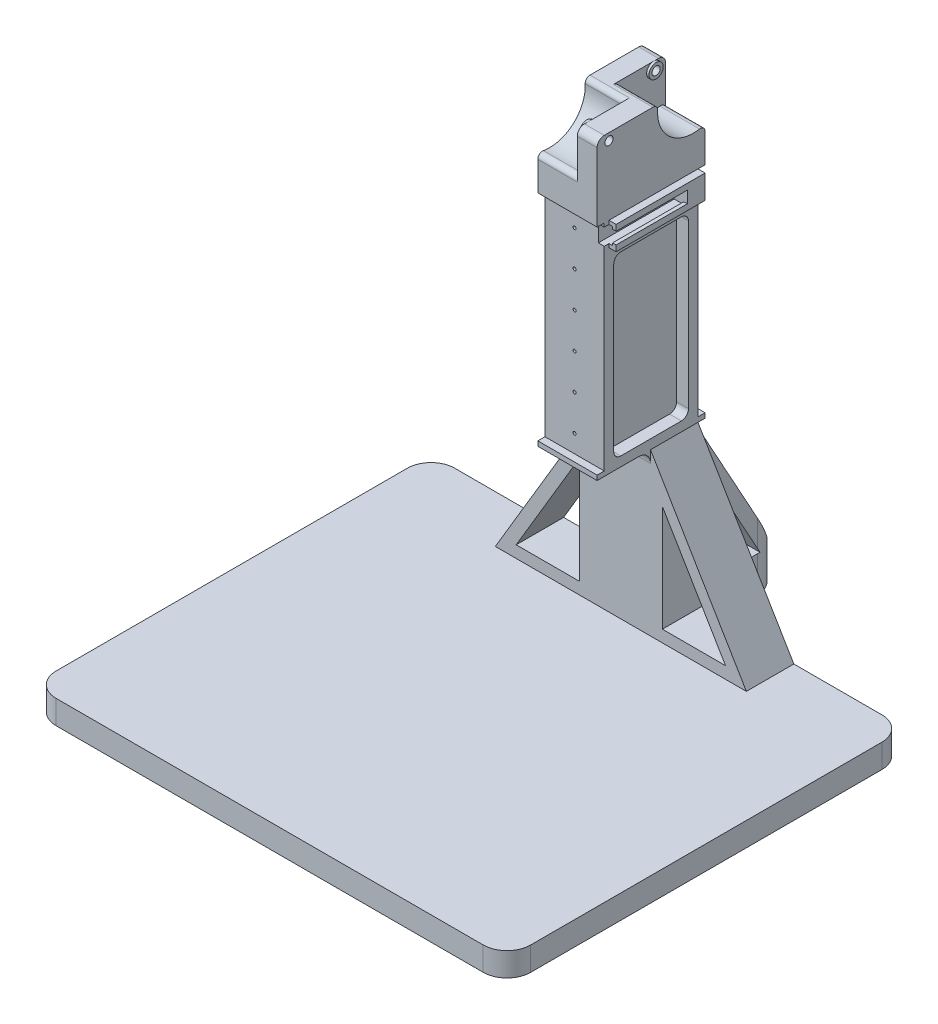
ISO-10303-21;
HEADER;
FILE_DESCRIPTION(('STEP AP214'),'2;1');
FILE_NAME('part.step','',(''),(''),'','','');
FILE_SCHEMA(('AUTOMOTIVE_DESIGN { 1 0 10303 214 1 1 1 1 }'));
ENDSEC;
DATA;
#1=APPLICATION_CONTEXT('core data for automotive mechanical design processes');
#2=APPLICATION_PROTOCOL_DEFINITION('international standard','automotive_design',2000,#1);
#3=PRODUCT_CONTEXT('',#1,'mechanical');
#4=PRODUCT('Part','Part','',(#3));
#5=PRODUCT_RELATED_PRODUCT_CATEGORY('part','',(#4));
#6=PRODUCT_DEFINITION_FORMATION('','',#4);
#7=PRODUCT_DEFINITION_CONTEXT('part definition',#1,'design');
#8=PRODUCT_DEFINITION('design','',#6,#7);
#9=PRODUCT_DEFINITION_SHAPE('','',#8);
#10=(LENGTH_UNIT() NAMED_UNIT(*) SI_UNIT(.MILLI.,.METRE.));
#11=(NAMED_UNIT(*) PLANE_ANGLE_UNIT() SI_UNIT($,.RADIAN.));
#12=(NAMED_UNIT(*) SI_UNIT($,.STERADIAN.) SOLID_ANGLE_UNIT());
#13=UNCERTAINTY_MEASURE_WITH_UNIT(LENGTH_MEASURE(1.E-05),#10,'distance_accuracy_value','');
#14=(GEOMETRIC_REPRESENTATION_CONTEXT(3) GLOBAL_UNCERTAINTY_ASSIGNED_CONTEXT((#13)) GLOBAL_UNIT_ASSIGNED_CONTEXT((#10,
#11,#12)) REPRESENTATION_CONTEXT('',''));
#15=CARTESIAN_POINT('',(0.,0.,0.));
#16=DIRECTION('',(0.,0.,1.));
#17=DIRECTION('',(1.,0.,0.));
#18=AXIS2_PLACEMENT_3D('',#15,#16,#17);
#19=CARTESIAN_POINT('',(-12.5,0.,0.));
#20=DIRECTION('',(1.,0.,0.));
#21=DIRECTION('',(0.,0.,-1.));
#22=AXIS2_PLACEMENT_3D('',#19,#20,#21);
#23=PLANE('',#22);
#24=CARTESIAN_POINT('',(-12.5,189.5,-29.987));
#25=DIRECTION('',(-1.,0.,0.));
#26=DIRECTION('',(0.,0.,1.));
#27=AXIS2_PLACEMENT_3D('',#24,#25,#26);
#28=CIRCLE('',#27,15.);
#29=CARTESIAN_POINT('',(-12.5,190.382352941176,-44.9610259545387));
#30=VERTEX_POINT('',#29);
#31=CARTESIAN_POINT('',(-12.5,174.735411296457,-27.3399411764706));
#32=VERTEX_POINT('',#31);
#33=EDGE_CURVE('E1132',#30,#32,#28,.T.);
#34=ORIENTED_EDGE('',*,*,#33,.F.);
#35=CARTESIAN_POINT('',(-12.5,190.5,-46.9575627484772));
#36=DIRECTION('',(1.,0.,0.));
#37=DIRECTION('',(0.,0.,-1.));
#38=AXIS2_PLACEMENT_3D('',#35,#36,#37);
#39=CIRCLE('',#38,2.);
#40=CARTESIAN_POINT('',(-12.5,192.5,-46.9575627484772));
#41=VERTEX_POINT('',#40);
#42=EDGE_CURVE('E898',#30,#41,#39,.F.);
#43=ORIENTED_EDGE('',*,*,#42,.T.);
#44=DIRECTION('',(0.,0.,1.));
#45=VECTOR('',#44,1.);
#46=CARTESIAN_POINT('',(-12.5,192.5,-67.49));
#47=LINE('',#46,#45);
#48=CARTESIAN_POINT('',(-12.5,192.5,-67.49));
#49=VERTEX_POINT('',#48);
#50=EDGE_CURVE('E855',#49,#41,#47,.T.);
#51=ORIENTED_EDGE('',*,*,#50,.F.);
#52=CARTESIAN_POINT('',(-12.5,189.5,-67.49));
#53=DIRECTION('',(1.,0.,0.));
#54=DIRECTION('',(0.,0.,-1.));
#55=AXIS2_PLACEMENT_3D('',#52,#53,#54);
#56=CIRCLE('',#55,3.);
#57=CARTESIAN_POINT('',(-12.5,189.5,-70.49));
#58=VERTEX_POINT('',#57);
#59=EDGE_CURVE('E869',#49,#58,#56,.F.);
#60=ORIENTED_EDGE('',*,*,#59,.T.);
#61=DIRECTION('',(0.,1.,0.));
#62=VECTOR('',#61,1.);
#63=CARTESIAN_POINT('',(-12.5,162.5,-70.49));
#64=LINE('',#63,#62);
#65=CARTESIAN_POINT('',(-12.5,160.5,-70.49));
#66=VERTEX_POINT('',#65);
#67=EDGE_CURVE('E1343',#66,#58,#64,.T.);
#68=ORIENTED_EDGE('',*,*,#67,.F.);
#69=DIRECTION('',(0.,0.,1.));
#70=VECTOR('',#69,1.);
#71=CARTESIAN_POINT('',(-12.5,160.5,-70.49));
#72=LINE('',#71,#70);
#73=CARTESIAN_POINT('',(-12.5,160.5,-67.49));
#74=VERTEX_POINT('',#73);
#75=EDGE_CURVE('E1346',#66,#74,#72,.T.);
#76=ORIENTED_EDGE('',*,*,#75,.T.);
#77=DIRECTION('',(0.,1.,0.));
#78=VECTOR('',#77,1.);
#79=CARTESIAN_POINT('',(-12.5,-10.,-67.49));
#80=LINE('',#79,#78);
#81=CARTESIAN_POINT('',(-12.5,70.,-67.49));
#82=VERTEX_POINT('',#81);
#83=EDGE_CURVE('E791',#82,#74,#80,.T.);
#84=ORIENTED_EDGE('',*,*,#83,.F.);
#85=DIRECTION('',(0.,0.,1.));
#86=VECTOR('',#85,1.);
#87=CARTESIAN_POINT('',(-12.5,70.,-70.49));
#88=LINE('',#87,#86);
#89=CARTESIAN_POINT('',(-12.5,70.,-70.49));
#90=VERTEX_POINT('',#89);
#91=EDGE_CURVE('E1329',#90,#82,#88,.T.);
#92=ORIENTED_EDGE('',*,*,#91,.F.);
#93=DIRECTION('',(0.,1.,0.));
#94=VECTOR('',#93,1.);
#95=CARTESIAN_POINT('',(-12.5,70.,-70.49));
#96=LINE('',#95,#94);
#97=CARTESIAN_POINT('',(-12.5,68.,-70.49));
#98=VERTEX_POINT('',#97);
#99=EDGE_CURVE('E1317',#98,#90,#96,.T.);
#100=ORIENTED_EDGE('',*,*,#99,.F.);
#101=DIRECTION('',(0.,0.,1.));
#102=VECTOR('',#101,1.);
#103=CARTESIAN_POINT('',(-12.5,68.,-70.49));
#104=LINE('',#103,#102);
#105=CARTESIAN_POINT('',(-12.5,68.,-67.49));
#106=VERTEX_POINT('',#105);
#107=EDGE_CURVE('E1332',#98,#106,#104,.T.);
#108=ORIENTED_EDGE('',*,*,#107,.T.);
#109=DIRECTION('',(0.,0.,-1.));
#110=VECTOR('',#109,1.);
#111=CARTESIAN_POINT('',(-12.5,68.,-47.49));
#112=LINE('',#111,#110);
#113=CARTESIAN_POINT('',(-12.5,68.,-47.49));
#114=VERTEX_POINT('',#113);
#115=EDGE_CURVE('E1229',#114,#106,#112,.T.);
#116=ORIENTED_EDGE('',*,*,#115,.F.);
#117=DIRECTION('',(0.,-1.,0.));
#118=VECTOR('',#117,1.);
#119=CARTESIAN_POINT('',(-12.5,0.,-47.49));
#120=LINE('',#119,#118);
#121=CARTESIAN_POINT('',(-12.5,63.,-47.49));
#122=VERTEX_POINT('',#121);
#123=EDGE_CURVE('E1227',#114,#122,#120,.T.);
#124=ORIENTED_EDGE('',*,*,#123,.T.);
#125=CARTESIAN_POINT('',(-12.5,63.,-42.49));
#126=DIRECTION('',(1.,0.,0.));
#127=DIRECTION('',(0.,0.,-1.));
#128=AXIS2_PLACEMENT_3D('',#125,#126,#127);
#129=CIRCLE('',#128,5.);
#130=CARTESIAN_POINT('',(-12.5,68.,-42.49));
#131=VERTEX_POINT('',#130);
#132=EDGE_CURVE('E811',#122,#131,#129,.T.);
#133=ORIENTED_EDGE('',*,*,#132,.T.);
#134=DIRECTION('',(0.,0.,-1.));
#135=VECTOR('',#134,1.);
#136=CARTESIAN_POINT('',(-12.5,68.,-47.49));
#137=LINE('',#136,#135);
#138=CARTESIAN_POINT('',(-12.5,68.,-24.987));
#139=VERTEX_POINT('',#138);
#140=EDGE_CURVE('E677',#139,#131,#137,.T.);
#141=ORIENTED_EDGE('',*,*,#140,.F.);
#142=DIRECTION('',(0.,1.,0.));
#143=VECTOR('',#142,1.);
#144=CARTESIAN_POINT('',(-12.5,68.,-24.987));
#145=LINE('',#144,#143);
#146=CARTESIAN_POINT('',(-12.5,70.,-24.987));
#147=VERTEX_POINT('',#146);
#148=EDGE_CURVE('E680',#139,#147,#145,.T.);
#149=ORIENTED_EDGE('',*,*,#148,.T.);
#150=DIRECTION('',(0.,0.,-1.));
#151=VECTOR('',#150,1.);
#152=CARTESIAN_POINT('',(-12.5,70.,-47.49));
#153=LINE('',#152,#151);
#154=CARTESIAN_POINT('',(-12.5,70.,-27.987));
#155=VERTEX_POINT('',#154);
#156=EDGE_CURVE('E675',#147,#155,#153,.T.);
#157=ORIENTED_EDGE('',*,*,#156,.T.);
#158=DIRECTION('',(0.,-1.,0.));
#159=VECTOR('',#158,1.);
#160=CARTESIAN_POINT('',(-12.5,160.5,-27.987));
#161=LINE('',#160,#159);
#162=CARTESIAN_POINT('',(-12.5,160.5,-27.987));
#163=VERTEX_POINT('',#162);
#164=EDGE_CURVE('E796',#163,#155,#161,.T.);
#165=ORIENTED_EDGE('',*,*,#164,.F.);
#166=DIRECTION('',(0.,0.,1.));
#167=VECTOR('',#166,1.);
#168=CARTESIAN_POINT('',(-12.5,160.5,-67.49));
#169=LINE('',#168,#167);
#170=CARTESIAN_POINT('',(-12.5,160.5,-24.987));
#171=VERTEX_POINT('',#170);
#172=EDGE_CURVE('E654',#163,#171,#169,.T.);
#173=ORIENTED_EDGE('',*,*,#172,.T.);
#174=DIRECTION('',(0.,-1.,0.));
#175=VECTOR('',#174,1.);
#176=CARTESIAN_POINT('',(-12.5,162.5,-24.987));
#177=LINE('',#176,#175);
#178=CARTESIAN_POINT('',(-12.5,172.766799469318,-24.987));
#179=VERTEX_POINT('',#178);
#180=EDGE_CURVE('E665',#179,#171,#177,.T.);
#181=ORIENTED_EDGE('',*,*,#180,.F.);
#182=CARTESIAN_POINT('',(-12.5,172.766799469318,-26.987));
#183=DIRECTION('',(1.,0.,0.));
#184=DIRECTION('',(0.,0.,-1.));
#185=AXIS2_PLACEMENT_3D('',#182,#183,#184);
#186=CIRCLE('',#185,2.);
#187=EDGE_CURVE('E896',#179,#32,#186,.F.);
#188=ORIENTED_EDGE('',*,*,#187,.T.);
#189=EDGE_LOOP('',(#34,#43,#51,#60,#68,#76,#84,#92,#100,#108,#116,#124,#133,#141,#149,#157,#165,
#173,#181,#188));
#190=FACE_BOUND('',#189,.T.);
#191=CARTESIAN_POINT('',(-12.5,189.5,-65.49));
#192=DIRECTION('',(1.,0.,0.));
#193=DIRECTION('',(0.,0.,-1.));
#194=AXIS2_PLACEMENT_3D('',#191,#192,#193);
#195=CIRCLE('',#194,1.72719999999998);
#196=CARTESIAN_POINT('',(-12.5,189.5,-67.2172));
#197=VERTEX_POINT('',#196);
#198=EDGE_CURVE('E1107',#197,#197,#195,.T.);
#199=ORIENTED_EDGE('',*,*,#198,.T.);
#200=EDGE_LOOP('',(#199));
#201=FACE_BOUND('',#200,.T.);
#202=DIRECTION('',(0.,0.,1.));
#203=VECTOR('',#202,1.);
#204=CARTESIAN_POINT('',(-12.5,146.5,-31.987));
#205=LINE('',#204,#203);
#206=CARTESIAN_POINT('',(-12.5,146.5,-60.49));
#207=VERTEX_POINT('',#206);
#208=CARTESIAN_POINT('',(-12.5,146.5,-34.987));
#209=VERTEX_POINT('',#208);
#210=EDGE_CURVE('E1712',#207,#209,#205,.T.);
#211=ORIENTED_EDGE('',*,*,#210,.T.);
#212=CARTESIAN_POINT('',(-12.5,143.5,-34.987));
#213=DIRECTION('',(1.,0.,0.));
#214=DIRECTION('',(0.,0.,-1.));
#215=AXIS2_PLACEMENT_3D('',#212,#213,#214);
#216=CIRCLE('',#215,3.);
#217=CARTESIAN_POINT('',(-12.5,143.5,-31.987));
#218=VERTEX_POINT('',#217);
#219=EDGE_CURVE('E979',#209,#218,#216,.T.);
#220=ORIENTED_EDGE('',*,*,#219,.T.);
#221=DIRECTION('',(0.,-1.,0.));
#222=VECTOR('',#221,1.);
#223=CARTESIAN_POINT('',(-12.5,146.5,-31.987));
#224=LINE('',#223,#222);
#225=CARTESIAN_POINT('',(-12.5,75.,-31.987));
#226=VERTEX_POINT('',#225);
#227=EDGE_CURVE('E1715',#218,#226,#224,.T.);
#228=ORIENTED_EDGE('',*,*,#227,.T.);
#229=CARTESIAN_POINT('',(-12.5,75.,-34.987));
#230=DIRECTION('',(1.,0.,0.));
#231=DIRECTION('',(0.,0.,-1.));
#232=AXIS2_PLACEMENT_3D('',#229,#230,#231);
#233=CIRCLE('',#232,3.);
#234=CARTESIAN_POINT('',(-12.5,72.,-34.987));
#235=VERTEX_POINT('',#234);
#236=EDGE_CURVE('E983',#226,#235,#233,.T.);
#237=ORIENTED_EDGE('',*,*,#236,.T.);
#238=DIRECTION('',(0.,0.,-1.));
#239=VECTOR('',#238,1.);
#240=CARTESIAN_POINT('',(-12.5,72.,-31.987));
#241=LINE('',#240,#239);
#242=CARTESIAN_POINT('',(-12.5,72.,-60.49));
#243=VERTEX_POINT('',#242);
#244=EDGE_CURVE('E1705',#235,#243,#241,.T.);
#245=ORIENTED_EDGE('',*,*,#244,.T.);
#246=CARTESIAN_POINT('',(-12.5,75.,-60.49));
#247=DIRECTION('',(1.,0.,0.));
#248=DIRECTION('',(0.,0.,-1.));
#249=AXIS2_PLACEMENT_3D('',#246,#247,#248);
#250=CIRCLE('',#249,3.);
#251=CARTESIAN_POINT('',(-12.5,75.,-63.49));
#252=VERTEX_POINT('',#251);
#253=EDGE_CURVE('E985',#243,#252,#250,.T.);
#254=ORIENTED_EDGE('',*,*,#253,.T.);
#255=DIRECTION('',(0.,1.,0.));
#256=VECTOR('',#255,1.);
#257=CARTESIAN_POINT('',(-12.5,146.5,-63.49));
#258=LINE('',#257,#256);
#259=CARTESIAN_POINT('',(-12.5,143.5,-63.49));
#260=VERTEX_POINT('',#259);
#261=EDGE_CURVE('E1709',#252,#260,#258,.T.);
#262=ORIENTED_EDGE('',*,*,#261,.T.);
#263=CARTESIAN_POINT('',(-12.5,143.5,-60.49));
#264=DIRECTION('',(1.,0.,0.));
#265=DIRECTION('',(0.,0.,-1.));
#266=AXIS2_PLACEMENT_3D('',#263,#264,#265);
#267=CIRCLE('',#266,3.);
#268=EDGE_CURVE('E981',#260,#207,#267,.T.);
#269=ORIENTED_EDGE('',*,*,#268,.T.);
#270=EDGE_LOOP('',(#211,#220,#228,#237,#245,#254,#262,#269));
#271=FACE_BOUND('',#270,.T.);
#272=ADVANCED_FACE('F70',(#190,#201,#271),#23,.F.);
#273=CARTESIAN_POINT('',(-4.15,189.5,-65.49));
#274=DIRECTION('',(1.,0.,0.));
#275=DIRECTION('',(0.,0.,-1.));
#276=AXIS2_PLACEMENT_3D('',#273,#274,#275);
#277=PLANE('',#276);
#278=DIRECTION('',(0.,0.,1.));
#279=VECTOR('',#278,1.);
#280=CARTESIAN_POINT('',(-4.15,192.5,0.));
#281=LINE('',#280,#279);
#282=CARTESIAN_POINT('',(-4.15,192.5,-67.49));
#283=VERTEX_POINT('',#282);
#284=CARTESIAN_POINT('',(-4.15,192.5,-65.49));
#285=VERTEX_POINT('',#284);
#286=EDGE_CURVE('E856',#283,#285,#281,.T.);
#287=ORIENTED_EDGE('',*,*,#286,.T.);
#288=CARTESIAN_POINT('',(-4.15,189.5,-65.49));
#289=DIRECTION('',(1.,0.,0.));
#290=DIRECTION('',(0.,0.,-1.));
#291=AXIS2_PLACEMENT_3D('',#288,#289,#290);
#292=CIRCLE('',#291,3.00000000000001);
#293=EDGE_CURVE('E1016',#285,#285,#292,.T.);
#294=ORIENTED_EDGE('',*,*,#293,.F.);
#295=CARTESIAN_POINT('',(-4.15,192.5,-48.5194372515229));
#296=VERTEX_POINT('',#295);
#297=EDGE_CURVE('E850',#285,#296,#281,.T.);
#298=ORIENTED_EDGE('',*,*,#297,.T.);
#299=CARTESIAN_POINT('',(-4.15,190.5,-48.5194372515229));
#300=DIRECTION('',(1.,0.,0.));
#301=DIRECTION('',(0.,0.,-1.));
#302=AXIS2_PLACEMENT_3D('',#299,#300,#301);
#303=CIRCLE('',#302,2.);
#304=CARTESIAN_POINT('',(-4.15,190.382352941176,-50.5159740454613));
#305=VERTEX_POINT('',#304);
#306=EDGE_CURVE('E919',#296,#305,#303,.F.);
#307=ORIENTED_EDGE('',*,*,#306,.T.);
#308=CARTESIAN_POINT('',(-4.15,189.5,-65.49));
#309=DIRECTION('',(1.,0.,0.));
#310=DIRECTION('',(0.,0.,-1.));
#311=AXIS2_PLACEMENT_3D('',#308,#309,#310);
#312=CIRCLE('',#311,15.);
#313=CARTESIAN_POINT('',(-4.15,174.735411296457,-68.1370588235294));
#314=VERTEX_POINT('',#313);
#315=EDGE_CURVE('E1142',#305,#314,#312,.T.);
#316=ORIENTED_EDGE('',*,*,#315,.T.);
#317=CARTESIAN_POINT('',(-4.15,172.766799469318,-68.49));
#318=DIRECTION('',(1.,0.,0.));
#319=DIRECTION('',(0.,0.,-1.));
#320=AXIS2_PLACEMENT_3D('',#317,#318,#319);
#321=CIRCLE('',#320,2.);
#322=CARTESIAN_POINT('',(-4.15,172.766799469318,-70.49));
#323=VERTEX_POINT('',#322);
#324=EDGE_CURVE('E921',#314,#323,#321,.F.);
#325=ORIENTED_EDGE('',*,*,#324,.T.);
#326=DIRECTION('',(0.,-1.,0.));
#327=VECTOR('',#326,1.);
#328=CARTESIAN_POINT('',(-4.15,0.,-70.49));
#329=LINE('',#328,#327);
#330=CARTESIAN_POINT('',(-4.15,189.5,-70.49));
#331=VERTEX_POINT('',#330);
#332=EDGE_CURVE('E1145',#331,#323,#329,.T.);
#333=ORIENTED_EDGE('',*,*,#332,.F.);
#334=CARTESIAN_POINT('',(-4.15,189.5,-67.49));
#335=DIRECTION('',(1.,0.,0.));
#336=DIRECTION('',(0.,0.,-1.));
#337=AXIS2_PLACEMENT_3D('',#334,#335,#336);
#338=CIRCLE('',#337,3.);
#339=EDGE_CURVE('E873',#331,#283,#338,.T.);
#340=ORIENTED_EDGE('',*,*,#339,.T.);
#341=EDGE_LOOP('',(#287,#294,#298,#307,#316,#325,#333,#340));
#342=FACE_BOUND('',#341,.T.);
#343=ADVANCED_FACE('F1613',(#342),#277,.T.);
#344=CARTESIAN_POINT('',(4.15,189.5,-29.987));
#345=DIRECTION('',(-1.,0.,0.));
#346=DIRECTION('',(0.,0.,1.));
#347=AXIS2_PLACEMENT_3D('',#344,#345,#346);
#348=PLANE('',#347);
#349=DIRECTION('',(0.,0.,-1.));
#350=VECTOR('',#349,1.);
#351=CARTESIAN_POINT('',(4.15,192.5,0.));
#352=LINE('',#351,#350);
#353=CARTESIAN_POINT('',(4.15,192.5,-27.987));
#354=VERTEX_POINT('',#353);
#355=CARTESIAN_POINT('',(4.15,192.5,-29.987));
#356=VERTEX_POINT('',#355);
#357=EDGE_CURVE('E860',#354,#356,#352,.T.);
#358=ORIENTED_EDGE('',*,*,#357,.T.);
#359=CARTESIAN_POINT('',(4.15,189.5,-29.987));
#360=DIRECTION('',(-1.,0.,0.));
#361=DIRECTION('',(0.,0.,1.));
#362=AXIS2_PLACEMENT_3D('',#359,#360,#361);
#363=CIRCLE('',#362,3.);
#364=EDGE_CURVE('E1040',#356,#356,#363,.T.);
#365=ORIENTED_EDGE('',*,*,#364,.F.);
#366=CARTESIAN_POINT('',(4.15,192.5,-46.9575627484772));
#367=VERTEX_POINT('',#366);
#368=EDGE_CURVE('E859',#356,#367,#352,.T.);
#369=ORIENTED_EDGE('',*,*,#368,.T.);
#370=CARTESIAN_POINT('',(4.15,190.5,-46.9575627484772));
#371=DIRECTION('',(-1.,0.,0.));
#372=DIRECTION('',(0.,0.,1.));
#373=AXIS2_PLACEMENT_3D('',#370,#371,#372);
#374=CIRCLE('',#373,2.);
#375=CARTESIAN_POINT('',(4.15,190.382352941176,-44.9610259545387));
#376=VERTEX_POINT('',#375);
#377=EDGE_CURVE('E914',#367,#376,#374,.F.);
#378=ORIENTED_EDGE('',*,*,#377,.T.);
#379=CARTESIAN_POINT('',(4.15,189.5,-29.987));
#380=DIRECTION('',(-1.,0.,0.));
#381=DIRECTION('',(0.,0.,1.));
#382=AXIS2_PLACEMENT_3D('',#379,#380,#381);
#383=CIRCLE('',#382,15.);
#384=CARTESIAN_POINT('',(4.15,174.735411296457,-27.3399411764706));
#385=VERTEX_POINT('',#384);
#386=EDGE_CURVE('E1133',#376,#385,#383,.T.);
#387=ORIENTED_EDGE('',*,*,#386,.T.);
#388=CARTESIAN_POINT('',(4.15,172.766799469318,-26.987));
#389=DIRECTION('',(-1.,0.,0.));
#390=DIRECTION('',(0.,0.,1.));
#391=AXIS2_PLACEMENT_3D('',#388,#389,#390);
#392=CIRCLE('',#391,2.);
#393=CARTESIAN_POINT('',(4.15,172.766799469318,-24.987));
#394=VERTEX_POINT('',#393);
#395=EDGE_CURVE('E916',#385,#394,#392,.F.);
#396=ORIENTED_EDGE('',*,*,#395,.T.);
#397=DIRECTION('',(0.,1.,0.));
#398=VECTOR('',#397,1.);
#399=CARTESIAN_POINT('',(4.15,162.5,-24.987));
#400=LINE('',#399,#398);
#401=CARTESIAN_POINT('',(4.15,189.5,-24.987));
#402=VERTEX_POINT('',#401);
#403=EDGE_CURVE('E1136',#394,#402,#400,.T.);
#404=ORIENTED_EDGE('',*,*,#403,.T.);
#405=CARTESIAN_POINT('',(4.15,189.5,-27.987));
#406=DIRECTION('',(-1.,0.,0.));
#407=DIRECTION('',(0.,0.,1.));
#408=AXIS2_PLACEMENT_3D('',#405,#406,#407);
#409=CIRCLE('',#408,3.);
#410=EDGE_CURVE('E879',#402,#354,#409,.T.);
#411=ORIENTED_EDGE('',*,*,#410,.T.);
#412=EDGE_LOOP('',(#358,#365,#369,#378,#387,#396,#404,#411));
#413=FACE_BOUND('',#412,.T.);
#414=ADVANCED_FACE('F1618',(#413),#348,.T.);
#415=CARTESIAN_POINT('',(-33.,0.,-98.8967743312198));
#416=DIRECTION('',(0.,0.482780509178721,-0.875741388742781));
#417=DIRECTION('',(0.,0.875741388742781,0.482780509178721));
#418=AXIS2_PLACEMENT_3D('',#415,#416,#417);
#419=PLANE('',#418);
#420=DIRECTION('',(1.,0.,0.));
#421=VECTOR('',#420,1.);
#422=CARTESIAN_POINT('',(9.99999999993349,5.,-96.1403640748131));
#423=LINE('',#422,#421);
#424=CARTESIAN_POINT('',(-9.93366945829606,5.,-96.1403640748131));
#425=VERTEX_POINT('',#424);
#426=CARTESIAN_POINT('',(9.93366945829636,5.,-96.1403640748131));
#427=VERTEX_POINT('',#426);
#428=EDGE_CURVE('E854',#425,#427,#423,.T.);
#429=ORIENTED_EDGE('',*,*,#428,.T.);
#430=CARTESIAN_POINT('',(0.,7.08581864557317,-94.9904896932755));
#431=DIRECTION('',(0.,0.482780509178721,-0.875741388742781));
#432=DIRECTION('',(0.,0.875741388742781,0.482780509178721));
#433=AXIS2_PLACEMENT_3D('',#430,#431,#432);
#434=ELLIPSE('',#433,20.7133465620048,10.);
#435=CARTESIAN_POINT('',(9.99999999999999,7.08581864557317,-94.9904896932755));
#436=VERTEX_POINT('',#435);
#437=EDGE_CURVE('E836',#427,#436,#434,.F.);
#438=ORIENTED_EDGE('',*,*,#437,.T.);
#439=DIRECTION('',(0.,0.875741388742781,0.482780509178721));
#440=VECTOR('',#439,1.);
#441=CARTESIAN_POINT('',(9.99999999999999,0.,-98.8967743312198));
#442=LINE('',#441,#440);
#443=CARTESIAN_POINT('',(10.,47.90066041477,-72.49));
#444=VERTEX_POINT('',#443);
#445=EDGE_CURVE('E1173',#436,#444,#442,.T.);
#446=ORIENTED_EDGE('',*,*,#445,.T.);
#447=DIRECTION('',(1.,0.,0.));
#448=VECTOR('',#447,1.);
#449=CARTESIAN_POINT('',(-33.,47.90066041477,-72.49));
#450=LINE('',#449,#448);
#451=CARTESIAN_POINT('',(-10.,47.90066041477,-72.49));
#452=VERTEX_POINT('',#451);
#453=EDGE_CURVE('E1178',#452,#444,#450,.T.);
#454=ORIENTED_EDGE('',*,*,#453,.F.);
#455=DIRECTION('',(0.,0.875741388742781,0.482780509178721));
#456=VECTOR('',#455,1.);
#457=CARTESIAN_POINT('',(-10.,47.2492526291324,-72.8491094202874));
#458=LINE('',#457,#456);
#459=CARTESIAN_POINT('',(-10.,7.08581864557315,-94.9904896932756));
#460=VERTEX_POINT('',#459);
#461=EDGE_CURVE('E819',#460,#452,#458,.T.);
#462=ORIENTED_EDGE('',*,*,#461,.F.);
#463=CARTESIAN_POINT('',(0.,7.08581864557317,-94.9904896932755));
#464=DIRECTION('',(0.,0.482780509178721,-0.875741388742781));
#465=DIRECTION('',(0.,-0.875741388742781,-0.482780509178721));
#466=AXIS2_PLACEMENT_3D('',#463,#464,#465);
#467=ELLIPSE('',#466,20.7133465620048,10.);
#468=EDGE_CURVE('E834',#460,#425,#467,.F.);
#469=ORIENTED_EDGE('',*,*,#468,.T.);
#470=EDGE_LOOP('',(#429,#438,#446,#454,#462,#469));
#471=FACE_BOUND('',#470,.T.);
#472=ADVANCED_FACE('F1534',(#471),#419,.F.);
#473=CARTESIAN_POINT('',(-33.,47.90066041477,-72.49));
#474=DIRECTION('',(0.,0.,1.));
#475=DIRECTION('',(1.,0.,0.));
#476=AXIS2_PLACEMENT_3D('',#473,#474,#475);
#477=PLANE('',#476);
#478=DIRECTION('',(1.,0.,0.));
#479=VECTOR('',#478,1.);
#480=CARTESIAN_POINT('',(9.99999999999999,5.,-72.49));
#481=LINE('',#480,#479);
#482=CARTESIAN_POINT('',(-10.,5.,-72.49));
#483=VERTEX_POINT('',#482);
#484=CARTESIAN_POINT('',(9.99999999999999,5.00000000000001,-72.49));
#485=VERTEX_POINT('',#484);
#486=EDGE_CURVE('E1154',#483,#485,#481,.T.);
#487=ORIENTED_EDGE('',*,*,#486,.F.);
#488=DIRECTION('',(0.,-1.,0.));
#489=VECTOR('',#488,1.);
#490=CARTESIAN_POINT('',(-10.,68.,-72.49));
#491=LINE('',#490,#489);
#492=EDGE_CURVE('E816',#452,#483,#491,.T.);
#493=ORIENTED_EDGE('',*,*,#492,.F.);
#494=ORIENTED_EDGE('',*,*,#453,.T.);
#495=DIRECTION('',(0.,-1.,0.));
#496=VECTOR('',#495,1.);
#497=CARTESIAN_POINT('',(10.,47.90066041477,-72.49));
#498=LINE('',#497,#496);
#499=EDGE_CURVE('E1175',#444,#485,#498,.T.);
#500=ORIENTED_EDGE('',*,*,#499,.T.);
#501=EDGE_LOOP('',(#487,#493,#494,#500));
#502=FACE_BOUND('',#501,.T.);
#503=ADVANCED_FACE('F1552',(#502),#477,.F.);
#504=CARTESIAN_POINT('',(-90.,-271.197243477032,-67.4904896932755));
#505=DIRECTION('',(0.,0.,-1.));
#506=DIRECTION('',(-1.,0.,0.));
#507=AXIS2_PLACEMENT_3D('',#504,#505,#506);
#508=PLANE('',#507);
#509=DIRECTION('',(1.,0.,0.));
#510=VECTOR('',#509,1.);
#511=CARTESIAN_POINT('',(-90.,-10.,-67.4904896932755));
#512=LINE('',#511,#510);
#513=CARTESIAN_POINT('',(10.,-10.,-67.4904896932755));
#514=VERTEX_POINT('',#513);
#515=CARTESIAN_POINT('',(90.,-10.,-67.4904896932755));
#516=VERTEX_POINT('',#515);
#517=EDGE_CURVE('E699',#514,#516,#512,.T.);
#518=ORIENTED_EDGE('',*,*,#517,.F.);
#519=DIRECTION('',(0.,-1.,0.));
#520=VECTOR('',#519,1.);
#521=CARTESIAN_POINT('',(10.,0.,-67.4904896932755));
#522=LINE('',#521,#520);
#523=CARTESIAN_POINT('',(9.99999999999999,0.,-67.4904896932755));
#524=VERTEX_POINT('',#523);
#525=EDGE_CURVE('E1157',#524,#514,#522,.T.);
#526=ORIENTED_EDGE('',*,*,#525,.F.);
#527=DIRECTION('',(-1.,0.,0.));
#528=VECTOR('',#527,1.);
#529=CARTESIAN_POINT('',(-90.,0.,-67.4904896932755));
#530=LINE('',#529,#528);
#531=CARTESIAN_POINT('',(90.,0.,-67.4904896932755));
#532=VERTEX_POINT('',#531);
#533=EDGE_CURVE('E725',#532,#524,#530,.T.);
#534=ORIENTED_EDGE('',*,*,#533,.F.);
#535=DIRECTION('',(0.,1.,0.));
#536=VECTOR('',#535,1.);
#537=CARTESIAN_POINT('',(90.,-271.197243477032,-67.4904896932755));
#538=LINE('',#537,#536);
#539=EDGE_CURVE('E741',#516,#532,#538,.T.);
#540=ORIENTED_EDGE('',*,*,#539,.F.);
#541=EDGE_LOOP('',(#518,#526,#534,#540));
#542=FACE_BOUND('',#541,.T.);
#543=ADVANCED_FACE('F1520',(#542),#508,.T.);
#544=CARTESIAN_POINT('',(-10.,0.,-67.4904896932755));
#545=VERTEX_POINT('',#544);
#546=CARTESIAN_POINT('',(-90.,0.,-67.4904896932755));
#547=VERTEX_POINT('',#546);
#548=EDGE_CURVE('E724',#545,#547,#530,.T.);
#549=ORIENTED_EDGE('',*,*,#548,.F.);
#550=DIRECTION('',(0.,1.,0.));
#551=VECTOR('',#550,1.);
#552=CARTESIAN_POINT('',(-10.,0.,-67.4904896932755));
#553=LINE('',#552,#551);
#554=CARTESIAN_POINT('',(-9.99999999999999,-10.,-67.4904896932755));
#555=VERTEX_POINT('',#554);
#556=EDGE_CURVE('E1166',#555,#545,#553,.T.);
#557=ORIENTED_EDGE('',*,*,#556,.F.);
#558=CARTESIAN_POINT('',(-90.,-10.,-67.4904896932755));
#559=VERTEX_POINT('',#558);
#560=EDGE_CURVE('E700',#559,#555,#512,.T.);
#561=ORIENTED_EDGE('',*,*,#560,.F.);
#562=DIRECTION('',(0.,1.,0.));
#563=VECTOR('',#562,1.);
#564=CARTESIAN_POINT('',(-90.,-271.197243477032,-67.4904896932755));
#565=LINE('',#564,#563);
#566=EDGE_CURVE('E738',#559,#547,#565,.T.);
#567=ORIENTED_EDGE('',*,*,#566,.T.);
#568=EDGE_LOOP('',(#549,#557,#561,#567));
#569=FACE_BOUND('',#568,.T.);
#570=ADVANCED_FACE('F1566',(#569),#508,.T.);
#571=CARTESIAN_POINT('',(12.5,-10.,-67.49));
#572=DIRECTION('',(0.,0.,1.));
#573=DIRECTION('',(1.,0.,0.));
#574=AXIS2_PLACEMENT_3D('',#571,#572,#573);
#575=PLANE('',#574);
#576=DIRECTION('',(0.510774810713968,-0.859714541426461,0.));
#577=VECTOR('',#576,1.);
#578=CARTESIAN_POINT('',(34.800487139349,20.675714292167,-67.49));
#579=LINE('',#578,#577);
#580=CARTESIAN_POINT('',(17.5,49.7951619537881,-67.49));
#581=VERTEX_POINT('',#580);
#582=CARTESIAN_POINT('',(44.1137645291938,5.,-67.49));
#583=VERTEX_POINT('',#582);
#584=EDGE_CURVE('E1250',#581,#583,#579,.T.);
#585=ORIENTED_EDGE('',*,*,#584,.F.);
#586=DIRECTION('',(0.,1.,0.));
#587=VECTOR('',#586,1.);
#588=CARTESIAN_POINT('',(17.5,0.,-67.49));
#589=LINE('',#588,#587);
#590=CARTESIAN_POINT('',(17.5,5.,-67.49));
#591=VERTEX_POINT('',#590);
#592=EDGE_CURVE('E1235',#591,#581,#589,.T.);
#593=ORIENTED_EDGE('',*,*,#592,.F.);
#594=DIRECTION('',(-1.,0.,0.));
#595=VECTOR('',#594,1.);
#596=CARTESIAN_POINT('',(0.,5.,-67.49));
#597=LINE('',#596,#595);
#598=EDGE_CURVE('E1242',#583,#591,#597,.T.);
#599=ORIENTED_EDGE('',*,*,#598,.F.);
#600=EDGE_LOOP('',(#585,#593,#599));
#601=FACE_BOUND('',#600,.T.);
#602=DIRECTION('',(0.,-1.,0.));
#603=VECTOR('',#602,1.);
#604=CARTESIAN_POINT('',(10.,68.,-67.49));
#605=LINE('',#604,#603);
#606=CARTESIAN_POINT('',(10.,68.,-67.49));
#607=VERTEX_POINT('',#606);
#608=CARTESIAN_POINT('',(9.99999999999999,0.,-67.49));
#609=VERTEX_POINT('',#608);
#610=EDGE_CURVE('E1188',#607,#609,#605,.T.);
#611=ORIENTED_EDGE('',*,*,#610,.F.);
#612=DIRECTION('',(-1.,0.,0.));
#613=VECTOR('',#612,1.);
#614=CARTESIAN_POINT('',(12.5,68.,-67.49));
#615=LINE('',#614,#613);
#616=CARTESIAN_POINT('',(12.5,68.,-67.49));
#617=VERTEX_POINT('',#616);
#618=EDGE_CURVE('E1322',#617,#607,#615,.T.);
#619=ORIENTED_EDGE('',*,*,#618,.F.);
#620=DIRECTION('',(0.510774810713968,-0.859714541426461,0.));
#621=VECTOR('',#620,1.);
#622=CARTESIAN_POINT('',(12.5,68.,-67.49));
#623=LINE('',#622,#621);
#624=CARTESIAN_POINT('',(52.9002554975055,0.,-67.49));
#625=VERTEX_POINT('',#624);
#626=EDGE_CURVE('E1257',#617,#625,#623,.T.);
#627=ORIENTED_EDGE('',*,*,#626,.T.);
#628=DIRECTION('',(-1.,0.,0.));
#629=VECTOR('',#628,1.);
#630=CARTESIAN_POINT('',(12.5,0.,-67.49));
#631=LINE('',#630,#629);
#632=EDGE_CURVE('E752',#625,#609,#631,.T.);
#633=ORIENTED_EDGE('',*,*,#632,.T.);
#634=EDGE_LOOP('',(#611,#619,#627,#633));
#635=FACE_BOUND('',#634,.T.);
#636=ADVANCED_FACE('F1507',(#601,#635),#575,.F.);
#637=DIRECTION('',(0.,-1.,0.));
#638=VECTOR('',#637,1.);
#639=CARTESIAN_POINT('',(-17.5,0.,-67.49));
#640=LINE('',#639,#638);
#641=CARTESIAN_POINT('',(-17.5,49.7951619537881,-67.49));
#642=VERTEX_POINT('',#641);
#643=CARTESIAN_POINT('',(-17.5,5.,-67.49));
#644=VERTEX_POINT('',#643);
#645=EDGE_CURVE('E1212',#642,#644,#640,.T.);
#646=ORIENTED_EDGE('',*,*,#645,.F.);
#647=DIRECTION('',(0.510774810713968,0.859714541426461,0.));
#648=VECTOR('',#647,1.);
#649=CARTESIAN_POINT('',(-34.800487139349,20.675714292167,-67.49));
#650=LINE('',#649,#648);
#651=CARTESIAN_POINT('',(-44.1137645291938,5.,-67.49));
#652=VERTEX_POINT('',#651);
#653=EDGE_CURVE('E1199',#652,#642,#650,.T.);
#654=ORIENTED_EDGE('',*,*,#653,.F.);
#655=DIRECTION('',(-1.,0.,0.));
#656=VECTOR('',#655,1.);
#657=CARTESIAN_POINT('',(0.,5.,-67.49));
#658=LINE('',#657,#656);
#659=EDGE_CURVE('E1204',#644,#652,#658,.T.);
#660=ORIENTED_EDGE('',*,*,#659,.F.);
#661=EDGE_LOOP('',(#646,#654,#660));
#662=FACE_BOUND('',#661,.T.);
#663=DIRECTION('',(0.,1.,0.));
#664=VECTOR('',#663,1.);
#665=CARTESIAN_POINT('',(-10.,68.,-67.49));
#666=LINE('',#665,#664);
#667=CARTESIAN_POINT('',(-10.,0.,-67.49));
#668=VERTEX_POINT('',#667);
#669=CARTESIAN_POINT('',(-10.,68.,-67.49));
#670=VERTEX_POINT('',#669);
#671=EDGE_CURVE('E1191',#668,#670,#666,.T.);
#672=ORIENTED_EDGE('',*,*,#671,.F.);
#673=CARTESIAN_POINT('',(-52.9002554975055,0.,-67.49));
#674=VERTEX_POINT('',#673);
#675=EDGE_CURVE('E751',#668,#674,#631,.T.);
#676=ORIENTED_EDGE('',*,*,#675,.T.);
#677=DIRECTION('',(0.510774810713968,0.859714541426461,0.));
#678=VECTOR('',#677,1.);
#679=CARTESIAN_POINT('',(-12.5,68.,-67.49));
#680=LINE('',#679,#678);
#681=EDGE_CURVE('E1219',#674,#106,#680,.T.);
#682=ORIENTED_EDGE('',*,*,#681,.T.);
#683=EDGE_CURVE('E1310',#670,#106,#615,.T.);
#684=ORIENTED_EDGE('',*,*,#683,.F.);
#685=EDGE_LOOP('',(#672,#676,#682,#684));
#686=FACE_BOUND('',#685,.T.);
#687=ADVANCED_FACE('F1435',(#662,#686),#575,.F.);
#688=CARTESIAN_POINT('',(12.5,0.,-47.49));
#689=DIRECTION('',(0.,-1.,0.));
#690=DIRECTION('',(0.,0.,-1.));
#691=AXIS2_PLACEMENT_3D('',#688,#689,#690);
#692=PLANE('',#691);
#693=DIRECTION('',(0.,0.,1.));
#694=VECTOR('',#693,1.);
#695=CARTESIAN_POINT('',(9.99999999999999,0.,-110.49));
#696=LINE('',#695,#694);
#697=EDGE_CURVE('E1196',#524,#609,#696,.T.);
#698=ORIENTED_EDGE('',*,*,#697,.T.);
#699=ORIENTED_EDGE('',*,*,#632,.F.);
#700=DIRECTION('',(0.,0.,-1.));
#701=VECTOR('',#700,1.);
#702=CARTESIAN_POINT('',(52.9002554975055,0.,-47.49));
#703=LINE('',#702,#701);
#704=CARTESIAN_POINT('',(52.9002554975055,0.,-47.49));
#705=VERTEX_POINT('',#704);
#706=EDGE_CURVE('E1270',#705,#625,#703,.T.);
#707=ORIENTED_EDGE('',*,*,#706,.F.);
#708=DIRECTION('',(-1.,0.,0.));
#709=VECTOR('',#708,1.);
#710=CARTESIAN_POINT('',(12.5,0.,-47.49));
#711=LINE('',#710,#709);
#712=CARTESIAN_POINT('',(-52.9002554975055,0.,-47.49));
#713=VERTEX_POINT('',#712);
#714=EDGE_CURVE('E798',#705,#713,#711,.T.);
#715=ORIENTED_EDGE('',*,*,#714,.T.);
#716=DIRECTION('',(0.,0.,-1.));
#717=VECTOR('',#716,1.);
#718=CARTESIAN_POINT('',(-52.9002554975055,0.,-47.49));
#719=LINE('',#718,#717);
#720=EDGE_CURVE('E1232',#713,#674,#719,.T.);
#721=ORIENTED_EDGE('',*,*,#720,.T.);
#722=ORIENTED_EDGE('',*,*,#675,.F.);
#723=DIRECTION('',(0.,0.,1.));
#724=VECTOR('',#723,1.);
#725=CARTESIAN_POINT('',(-10.,0.,-110.49));
#726=LINE('',#725,#724);
#727=EDGE_CURVE('E1194',#545,#668,#726,.T.);
#728=ORIENTED_EDGE('',*,*,#727,.F.);
#729=ORIENTED_EDGE('',*,*,#548,.T.);
#730=CARTESIAN_POINT('',(-90.,0.,-57.4904896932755));
#731=DIRECTION('',(0.,1.,0.));
#732=DIRECTION('',(0.,0.,1.));
#733=AXIS2_PLACEMENT_3D('',#730,#731,#732);
#734=CIRCLE('',#733,10.);
#735=CARTESIAN_POINT('',(-100.,0.,-57.4904896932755));
#736=VERTEX_POINT('',#735);
#737=EDGE_CURVE('E728',#547,#736,#734,.T.);
#738=ORIENTED_EDGE('',*,*,#737,.T.);
#739=DIRECTION('',(0.,0.,1.));
#740=VECTOR('',#739,1.);
#741=CARTESIAN_POINT('',(-100.,0.,-57.4904896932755));
#742=LINE('',#741,#740);
#743=CARTESIAN_POINT('',(-100.,0.,90.5095103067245));
#744=VERTEX_POINT('',#743);
#745=EDGE_CURVE('E731',#736,#744,#742,.T.);
#746=ORIENTED_EDGE('',*,*,#745,.T.);
#747=CARTESIAN_POINT('',(-90.,0.,90.5095103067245));
#748=DIRECTION('',(0.,1.,0.));
#749=DIRECTION('',(0.,0.,1.));
#750=AXIS2_PLACEMENT_3D('',#747,#748,#749);
#751=CIRCLE('',#750,9.99999999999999);
#752=CARTESIAN_POINT('',(-90.,0.,100.509510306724));
#753=VERTEX_POINT('',#752);
#754=EDGE_CURVE('E691',#744,#753,#751,.T.);
#755=ORIENTED_EDGE('',*,*,#754,.T.);
#756=DIRECTION('',(1.,0.,0.));
#757=VECTOR('',#756,1.);
#758=CARTESIAN_POINT('',(-90.,0.,100.509510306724));
#759=LINE('',#758,#757);
#760=CARTESIAN_POINT('',(90.,0.,100.509510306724));
#761=VERTEX_POINT('',#760);
#762=EDGE_CURVE('E712',#753,#761,#759,.T.);
#763=ORIENTED_EDGE('',*,*,#762,.T.);
#764=CARTESIAN_POINT('',(90.,0.,90.5095103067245));
#765=DIRECTION('',(0.,1.,0.));
#766=DIRECTION('',(0.,0.,1.));
#767=AXIS2_PLACEMENT_3D('',#764,#765,#766);
#768=CIRCLE('',#767,9.99999999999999);
#769=CARTESIAN_POINT('',(100.,0.,90.5095103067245));
#770=VERTEX_POINT('',#769);
#771=EDGE_CURVE('E715',#761,#770,#768,.T.);
#772=ORIENTED_EDGE('',*,*,#771,.T.);
#773=DIRECTION('',(0.,0.,-1.));
#774=VECTOR('',#773,1.);
#775=CARTESIAN_POINT('',(100.,0.,-57.4904896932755));
#776=LINE('',#775,#774);
#777=CARTESIAN_POINT('',(100.,0.,-57.4904896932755));
#778=VERTEX_POINT('',#777);
#779=EDGE_CURVE('E718',#770,#778,#776,.T.);
#780=ORIENTED_EDGE('',*,*,#779,.T.);
#781=CARTESIAN_POINT('',(90.,0.,-57.4904896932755));
#782=DIRECTION('',(0.,1.,0.));
#783=DIRECTION('',(0.,0.,-1.));
#784=AXIS2_PLACEMENT_3D('',#781,#782,#783);
#785=CIRCLE('',#784,10.);
#786=EDGE_CURVE('E721',#778,#532,#785,.T.);
#787=ORIENTED_EDGE('',*,*,#786,.T.);
#788=ORIENTED_EDGE('',*,*,#533,.T.);
#789=EDGE_LOOP('',(#698,#699,#707,#715,#721,#722,#728,#729,#738,#746,#755,#763,#772,#780,#787,#788));
#790=FACE_BOUND('',#789,.T.);
#791=ADVANCED_FACE('F1514',(#790),#692,.F.);
#792=CARTESIAN_POINT('',(12.5,68.,-70.49));
#793=DIRECTION('',(0.,1.,0.));
#794=DIRECTION('',(0.,0.,1.));
#795=AXIS2_PLACEMENT_3D('',#792,#793,#794);
#796=PLANE('',#795);
#797=ORIENTED_EDGE('',*,*,#107,.F.);
#798=DIRECTION('',(-1.,0.,0.));
#799=VECTOR('',#798,1.);
#800=CARTESIAN_POINT('',(12.5,68.,-70.49));
#801=LINE('',#800,#799);
#802=CARTESIAN_POINT('',(12.5,68.,-70.49));
#803=VERTEX_POINT('',#802);
#804=EDGE_CURVE('E1314',#803,#98,#801,.T.);
#805=ORIENTED_EDGE('',*,*,#804,.F.);
#806=DIRECTION('',(0.,0.,1.));
#807=VECTOR('',#806,1.);
#808=CARTESIAN_POINT('',(12.5,68.,-70.49));
#809=LINE('',#808,#807);
#810=EDGE_CURVE('E1335',#803,#617,#809,.T.);
#811=ORIENTED_EDGE('',*,*,#810,.T.);
#812=ORIENTED_EDGE('',*,*,#618,.T.);
#813=DIRECTION('',(1.,0.,0.));
#814=VECTOR('',#813,1.);
#815=CARTESIAN_POINT('',(-33.,68.,-67.49));
#816=LINE('',#815,#814);
#817=EDGE_CURVE('E1184',#670,#607,#816,.T.);
#818=ORIENTED_EDGE('',*,*,#817,.F.);
#819=ORIENTED_EDGE('',*,*,#683,.T.);
#820=EDGE_LOOP('',(#797,#805,#811,#812,#818,#819));
#821=FACE_BOUND('',#820,.T.);
#822=ADVANCED_FACE('F1429',(#821),#796,.F.);
#823=CARTESIAN_POINT('',(0.,77.5,-67.49));
#824=DIRECTION('',(0.,0.,-1.));
#825=DIRECTION('',(-1.,0.,0.));
#826=AXIS2_PLACEMENT_3D('',#823,#824,#825);
#827=CIRCLE('',#826,0.66039999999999);
#828=CARTESIAN_POINT('',(-0.66039999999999,77.5,-67.49));
#829=VERTEX_POINT('',#828);
#830=EDGE_CURVE('E1273',#829,#829,#827,.T.);
#831=ORIENTED_EDGE('',*,*,#830,.F.);
#832=EDGE_LOOP('',(#831));
#833=FACE_BOUND('',#832,.T.);
#834=CARTESIAN_POINT('',(0.,92.5,-67.49));
#835=DIRECTION('',(0.,0.,-1.));
#836=DIRECTION('',(-1.,0.,0.));
#837=AXIS2_PLACEMENT_3D('',#834,#835,#836);
#838=CIRCLE('',#837,0.66039999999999);
#839=CARTESIAN_POINT('',(-0.66039999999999,92.5,-67.49));
#840=VERTEX_POINT('',#839);
#841=EDGE_CURVE('E1280',#840,#840,#838,.T.);
#842=ORIENTED_EDGE('',*,*,#841,.F.);
#843=EDGE_LOOP('',(#842));
#844=FACE_BOUND('',#843,.T.);
#845=CARTESIAN_POINT('',(0.,107.5,-67.49));
#846=DIRECTION('',(0.,0.,-1.));
#847=DIRECTION('',(-1.,0.,0.));
#848=AXIS2_PLACEMENT_3D('',#845,#846,#847);
#849=CIRCLE('',#848,0.66039999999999);
#850=CARTESIAN_POINT('',(-0.66039999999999,107.5,-67.49));
#851=VERTEX_POINT('',#850);
#852=EDGE_CURVE('E1286',#851,#851,#849,.T.);
#853=ORIENTED_EDGE('',*,*,#852,.F.);
#854=EDGE_LOOP('',(#853));
#855=FACE_BOUND('',#854,.T.);
#856=CARTESIAN_POINT('',(0.,122.5,-67.49));
#857=DIRECTION('',(0.,0.,-1.));
#858=DIRECTION('',(-1.,0.,0.));
#859=AXIS2_PLACEMENT_3D('',#856,#857,#858);
#860=CIRCLE('',#859,0.66039999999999);
#861=CARTESIAN_POINT('',(-0.66039999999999,122.5,-67.49));
#862=VERTEX_POINT('',#861);
#863=EDGE_CURVE('E1292',#862,#862,#860,.T.);
#864=ORIENTED_EDGE('',*,*,#863,.F.);
#865=EDGE_LOOP('',(#864));
#866=FACE_BOUND('',#865,.T.);
#867=CARTESIAN_POINT('',(0.,137.5,-67.49));
#868=DIRECTION('',(0.,0.,-1.));
#869=DIRECTION('',(-1.,0.,0.));
#870=AXIS2_PLACEMENT_3D('',#867,#868,#869);
#871=CIRCLE('',#870,0.66039999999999);
#872=CARTESIAN_POINT('',(-0.66039999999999,137.5,-67.49));
#873=VERTEX_POINT('',#872);
#874=EDGE_CURVE('E1298',#873,#873,#871,.T.);
#875=ORIENTED_EDGE('',*,*,#874,.F.);
#876=EDGE_LOOP('',(#875));
#877=FACE_BOUND('',#876,.T.);
#878=CARTESIAN_POINT('',(0.,152.5,-67.49));
#879=DIRECTION('',(0.,0.,-1.));
#880=DIRECTION('',(-1.,0.,0.));
#881=AXIS2_PLACEMENT_3D('',#878,#879,#880);
#882=CIRCLE('',#881,0.66039999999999);
#883=CARTESIAN_POINT('',(-0.66039999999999,152.5,-67.49));
#884=VERTEX_POINT('',#883);
#885=EDGE_CURVE('E1304',#884,#884,#882,.T.);
#886=ORIENTED_EDGE('',*,*,#885,.F.);
#887=EDGE_LOOP('',(#886));
#888=FACE_BOUND('',#887,.T.);
#889=DIRECTION('',(1.,0.,0.));
#890=VECTOR('',#889,1.);
#891=CARTESIAN_POINT('',(12.5,70.,-67.49));
#892=LINE('',#891,#890);
#893=CARTESIAN_POINT('',(12.5,70.,-67.49));
#894=VERTEX_POINT('',#893);
#895=EDGE_CURVE('E1315',#82,#894,#892,.T.);
#896=ORIENTED_EDGE('',*,*,#895,.F.);
#897=ORIENTED_EDGE('',*,*,#83,.T.);
#898=DIRECTION('',(-1.,0.,0.));
#899=VECTOR('',#898,1.);
#900=CARTESIAN_POINT('',(12.5,160.5,-67.49));
#901=LINE('',#900,#899);
#902=CARTESIAN_POINT('',(12.5,160.5,-67.49));
#903=VERTEX_POINT('',#902);
#904=EDGE_CURVE('E1338',#903,#74,#901,.T.);
#905=ORIENTED_EDGE('',*,*,#904,.F.);
#906=DIRECTION('',(-1.,0.,0.));
#907=VECTOR('',#906,1.);
#908=CARTESIAN_POINT('',(15.5,160.5,-67.49));
#909=LINE('',#908,#907);
#910=CARTESIAN_POINT('',(15.5,160.5,-67.49));
#911=VERTEX_POINT('',#910);
#912=EDGE_CURVE('E1362',#911,#903,#909,.T.);
#913=ORIENTED_EDGE('',*,*,#912,.F.);
#914=DIRECTION('',(0.,1.,0.));
#915=VECTOR('',#914,1.);
#916=CARTESIAN_POINT('',(15.5,160.5,-67.49));
#917=LINE('',#916,#915);
#918=CARTESIAN_POINT('',(15.5,150.5,-67.49));
#919=VERTEX_POINT('',#918);
#920=EDGE_CURVE('E1356',#919,#911,#917,.T.);
#921=ORIENTED_EDGE('',*,*,#920,.F.);
#922=DIRECTION('',(-1.,0.,0.));
#923=VECTOR('',#922,1.);
#924=CARTESIAN_POINT('',(15.5,150.5,-67.49));
#925=LINE('',#924,#923);
#926=CARTESIAN_POINT('',(12.5,150.5,-67.49));
#927=VERTEX_POINT('',#926);
#928=EDGE_CURVE('E1368',#919,#927,#925,.T.);
#929=ORIENTED_EDGE('',*,*,#928,.T.);
#930=DIRECTION('',(0.,1.,0.));
#931=VECTOR('',#930,1.);
#932=CARTESIAN_POINT('',(12.5,-10.,-67.49));
#933=LINE('',#932,#931);
#934=EDGE_CURVE('E792',#894,#927,#933,.T.);
#935=ORIENTED_EDGE('',*,*,#934,.F.);
#936=EDGE_LOOP('',(#896,#897,#905,#913,#921,#929,#935));
#937=FACE_BOUND('',#936,.T.);
#938=ADVANCED_FACE('F1418',(#833,#844,#855,#866,#877,#888,#937),#575,.F.);
#939=CARTESIAN_POINT('',(12.5,0.,0.));
#940=DIRECTION('',(1.,0.,0.));
#941=DIRECTION('',(0.,0.,-1.));
#942=AXIS2_PLACEMENT_3D('',#939,#940,#941);
#943=PLANE('',#942);
#944=DIRECTION('',(0.,-1.,0.));
#945=VECTOR('',#944,1.);
#946=CARTESIAN_POINT('',(12.5,146.5,-31.987));
#947=LINE('',#946,#945);
#948=CARTESIAN_POINT('',(12.5,143.5,-31.987));
#949=VERTEX_POINT('',#948);
#950=CARTESIAN_POINT('',(12.5,75.,-31.987));
#951=VERTEX_POINT('',#950);
#952=EDGE_CURVE('E1024',#949,#951,#947,.T.);
#953=ORIENTED_EDGE('',*,*,#952,.F.);
#954=CARTESIAN_POINT('',(12.5,143.5,-34.987));
#955=DIRECTION('',(1.,0.,0.));
#956=DIRECTION('',(0.,0.,-1.));
#957=AXIS2_PLACEMENT_3D('',#954,#955,#956);
#958=CIRCLE('',#957,3.);
#959=CARTESIAN_POINT('',(12.5,146.5,-34.987));
#960=VERTEX_POINT('',#959);
#961=EDGE_CURVE('E12',#949,#960,#958,.F.);
#962=ORIENTED_EDGE('',*,*,#961,.T.);
#963=DIRECTION('',(0.,0.,1.));
#964=VECTOR('',#963,1.);
#965=CARTESIAN_POINT('',(12.5,146.5,-31.987));
#966=LINE('',#965,#964);
#967=CARTESIAN_POINT('',(12.5,146.5,-60.49));
#968=VERTEX_POINT('',#967);
#969=EDGE_CURVE('E995',#968,#960,#966,.T.);
#970=ORIENTED_EDGE('',*,*,#969,.F.);
#971=CARTESIAN_POINT('',(12.5,143.5,-60.49));
#972=DIRECTION('',(1.,0.,0.));
#973=DIRECTION('',(0.,0.,-1.));
#974=AXIS2_PLACEMENT_3D('',#971,#972,#973);
#975=CIRCLE('',#974,3.);
#976=CARTESIAN_POINT('',(12.5,143.5,-63.49));
#977=VERTEX_POINT('',#976);
#978=EDGE_CURVE('E78',#968,#977,#975,.F.);
#979=ORIENTED_EDGE('',*,*,#978,.T.);
#980=DIRECTION('',(0.,1.,0.));
#981=VECTOR('',#980,1.);
#982=CARTESIAN_POINT('',(12.5,146.5,-63.49));
#983=LINE('',#982,#981);
#984=CARTESIAN_POINT('',(12.5,75.,-63.49));
#985=VERTEX_POINT('',#984);
#986=EDGE_CURVE('E994',#985,#977,#983,.T.);
#987=ORIENTED_EDGE('',*,*,#986,.F.);
#988=CARTESIAN_POINT('',(12.5,75.,-60.49));
#989=DIRECTION('',(1.,0.,0.));
#990=DIRECTION('',(0.,0.,-1.));
#991=AXIS2_PLACEMENT_3D('',#988,#989,#990);
#992=CIRCLE('',#991,3.);
#993=CARTESIAN_POINT('',(12.5,72.,-60.49));
#994=VERTEX_POINT('',#993);
#995=EDGE_CURVE('E989',#985,#994,#992,.F.);
#996=ORIENTED_EDGE('',*,*,#995,.T.);
#997=DIRECTION('',(0.,0.,-1.));
#998=VECTOR('',#997,1.);
#999=CARTESIAN_POINT('',(12.5,72.,-31.987));
#1000=LINE('',#999,#998);
#1001=CARTESIAN_POINT('',(12.5,72.,-34.987));
#1002=VERTEX_POINT('',#1001);
#1003=EDGE_CURVE('E1001',#1002,#994,#1000,.T.);
#1004=ORIENTED_EDGE('',*,*,#1003,.F.);
#1005=CARTESIAN_POINT('',(12.5,75.,-34.987));
#1006=DIRECTION('',(1.,0.,0.));
#1007=DIRECTION('',(0.,0.,-1.));
#1008=AXIS2_PLACEMENT_3D('',#1005,#1006,#1007);
#1009=CIRCLE('',#1008,3.);
#1010=EDGE_CURVE('E987',#1002,#951,#1009,.F.);
#1011=ORIENTED_EDGE('',*,*,#1010,.T.);
#1012=EDGE_LOOP('',(#953,#962,#970,#979,#987,#996,#1004,#1011));
#1013=FACE_BOUND('',#1012,.T.);
#1014=DIRECTION('',(0.,0.,-1.));
#1015=VECTOR('',#1014,1.);
#1016=CARTESIAN_POINT('',(12.5,68.,-47.49));
#1017=LINE('',#1016,#1015);
#1018=CARTESIAN_POINT('',(12.5,68.,-47.49));
#1019=VERTEX_POINT('',#1018);
#1020=EDGE_CURVE('E1267',#1019,#617,#1017,.T.);
#1021=ORIENTED_EDGE('',*,*,#1020,.T.);
#1022=ORIENTED_EDGE('',*,*,#810,.F.);
#1023=DIRECTION('',(0.,-1.,0.));
#1024=VECTOR('',#1023,1.);
#1025=CARTESIAN_POINT('',(12.5,70.,-70.49));
#1026=LINE('',#1025,#1024);
#1027=CARTESIAN_POINT('',(12.5,70.,-70.49));
#1028=VERTEX_POINT('',#1027);
#1029=EDGE_CURVE('E1311',#1028,#803,#1026,.T.);
#1030=ORIENTED_EDGE('',*,*,#1029,.F.);
#1031=DIRECTION('',(0.,0.,1.));
#1032=VECTOR('',#1031,1.);
#1033=CARTESIAN_POINT('',(12.5,70.,-70.49));
#1034=LINE('',#1033,#1032);
#1035=EDGE_CURVE('E1321',#1028,#894,#1034,.T.);
#1036=ORIENTED_EDGE('',*,*,#1035,.T.);
#1037=ORIENTED_EDGE('',*,*,#934,.T.);
#1038=DIRECTION('',(0.,0.,-1.));
#1039=VECTOR('',#1038,1.);
#1040=CARTESIAN_POINT('',(12.5,150.5,-27.987));
#1041=LINE('',#1040,#1039);
#1042=CARTESIAN_POINT('',(12.5,150.5,-29.987));
#1043=VERTEX_POINT('',#1042);
#1044=EDGE_CURVE('E1353',#1043,#927,#1041,.T.);
#1045=ORIENTED_EDGE('',*,*,#1044,.F.);
#1046=DIRECTION('',(0.,1.,0.));
#1047=VECTOR('',#1046,1.);
#1048=CARTESIAN_POINT('',(12.5,146.894448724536,-29.987));
#1049=LINE('',#1048,#1047);
#1050=CARTESIAN_POINT('',(12.5,152.,-29.987));
#1051=VERTEX_POINT('',#1050);
#1052=EDGE_CURVE('E1048',#1043,#1051,#1049,.T.);
#1053=ORIENTED_EDGE('',*,*,#1052,.T.);
#1054=DIRECTION('',(0.,0.,-1.));
#1055=VECTOR('',#1054,1.);
#1056=CARTESIAN_POINT('',(12.5,152.,-59.987));
#1057=LINE('',#1056,#1055);
#1058=CARTESIAN_POINT('',(12.5,152.,-27.987));
#1059=VERTEX_POINT('',#1058);
#1060=EDGE_CURVE('E1070',#1059,#1051,#1057,.T.);
#1061=ORIENTED_EDGE('',*,*,#1060,.F.);
#1062=DIRECTION('',(0.,-1.,0.));
#1063=VECTOR('',#1062,1.);
#1064=CARTESIAN_POINT('',(12.5,160.5,-27.987));
#1065=LINE('',#1064,#1063);
#1066=CARTESIAN_POINT('',(12.5,70.,-27.987));
#1067=VERTEX_POINT('',#1066);
#1068=EDGE_CURVE('E795',#1059,#1067,#1065,.T.);
#1069=ORIENTED_EDGE('',*,*,#1068,.T.);
#1070=DIRECTION('',(0.,0.,1.));
#1071=VECTOR('',#1070,1.);
#1072=CARTESIAN_POINT('',(12.5,70.,-47.49));
#1073=LINE('',#1072,#1071);
#1074=CARTESIAN_POINT('',(12.5,70.,-24.987));
#1075=VERTEX_POINT('',#1074);
#1076=EDGE_CURVE('E671',#1067,#1075,#1073,.T.);
#1077=ORIENTED_EDGE('',*,*,#1076,.T.);
#1078=DIRECTION('',(0.,1.,0.));
#1079=VECTOR('',#1078,1.);
#1080=CARTESIAN_POINT('',(12.5,68.,-24.987));
#1081=LINE('',#1080,#1079);
#1082=CARTESIAN_POINT('',(12.5,68.,-24.987));
#1083=VERTEX_POINT('',#1082);
#1084=EDGE_CURVE('E688',#1083,#1075,#1081,.T.);
#1085=ORIENTED_EDGE('',*,*,#1084,.F.);
#1086=DIRECTION('',(0.,0.,1.));
#1087=VECTOR('',#1086,1.);
#1088=CARTESIAN_POINT('',(12.5,68.,-47.49));
#1089=LINE('',#1088,#1087);
#1090=CARTESIAN_POINT('',(12.5,68.,-42.49));
#1091=VERTEX_POINT('',#1090);
#1092=EDGE_CURVE('E672',#1091,#1083,#1089,.T.);
#1093=ORIENTED_EDGE('',*,*,#1092,.F.);
#1094=CARTESIAN_POINT('',(12.5,63.,-42.49));
#1095=DIRECTION('',(1.,0.,0.));
#1096=DIRECTION('',(0.,0.,-1.));
#1097=AXIS2_PLACEMENT_3D('',#1094,#1095,#1096);
#1098=CIRCLE('',#1097,5.);
#1099=CARTESIAN_POINT('',(12.5,63.,-47.49));
#1100=VERTEX_POINT('',#1099);
#1101=EDGE_CURVE('E809',#1091,#1100,#1098,.F.);
#1102=ORIENTED_EDGE('',*,*,#1101,.T.);
#1103=DIRECTION('',(0.,1.,0.));
#1104=VECTOR('',#1103,1.);
#1105=CARTESIAN_POINT('',(12.5,0.,-47.49));
#1106=LINE('',#1105,#1104);
#1107=EDGE_CURVE('E1262',#1100,#1019,#1106,.T.);
#1108=ORIENTED_EDGE('',*,*,#1107,.T.);
#1109=EDGE_LOOP('',(#1021,#1022,#1030,#1036,#1037,#1045,#1053,#1061,#1069,#1077,#1085,#1093,
#1102,#1108));
#1110=FACE_BOUND('',#1109,.T.);
#1111=ADVANCED_FACE('F992',(#1013,#1110),#943,.T.);
#1112=CARTESIAN_POINT('',(12.5,189.5,-29.987));
#1113=DIRECTION('',(1.,0.,0.));
#1114=DIRECTION('',(0.,0.,-1.));
#1115=AXIS2_PLACEMENT_3D('',#1112,#1113,#1114);
#1116=CIRCLE('',#1115,1.72719999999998);
#1117=CARTESIAN_POINT('',(12.5,189.5,-31.7142));
#1118=VERTEX_POINT('',#1117);
#1119=EDGE_CURVE('E1129',#1118,#1118,#1116,.T.);
#1120=ORIENTED_EDGE('',*,*,#1119,.F.);
#1121=EDGE_LOOP('',(#1120));
#1122=FACE_BOUND('',#1121,.T.);
#1123=CARTESIAN_POINT('',(12.5,189.5,-65.49));
#1124=DIRECTION('',(1.,0.,0.));
#1125=DIRECTION('',(0.,0.,-1.));
#1126=AXIS2_PLACEMENT_3D('',#1123,#1124,#1125);
#1127=CIRCLE('',#1126,15.);
#1128=CARTESIAN_POINT('',(12.5,190.382352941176,-50.5159740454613));
#1129=VERTEX_POINT('',#1128);
#1130=CARTESIAN_POINT('',(12.5,174.735411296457,-68.1370588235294));
#1131=VERTEX_POINT('',#1130);
#1132=EDGE_CURVE('E1141',#1129,#1131,#1127,.T.);
#1133=ORIENTED_EDGE('',*,*,#1132,.F.);
#1134=CARTESIAN_POINT('',(12.5,190.5,-48.5194372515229));
#1135=DIRECTION('',(1.,0.,0.));
#1136=DIRECTION('',(0.,0.,-1.));
#1137=AXIS2_PLACEMENT_3D('',#1134,#1135,#1136);
#1138=CIRCLE('',#1137,2.);
#1139=CARTESIAN_POINT('',(12.5,192.5,-48.5194372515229));
#1140=VERTEX_POINT('',#1139);
#1141=EDGE_CURVE('E910',#1129,#1140,#1138,.T.);
#1142=ORIENTED_EDGE('',*,*,#1141,.T.);
#1143=DIRECTION('',(0.,0.,-1.));
#1144=VECTOR('',#1143,1.);
#1145=CARTESIAN_POINT('',(12.5,192.5,-24.987));
#1146=LINE('',#1145,#1144);
#1147=CARTESIAN_POINT('',(12.5,192.5,-27.987));
#1148=VERTEX_POINT('',#1147);
#1149=EDGE_CURVE('E1149',#1148,#1140,#1146,.T.);
#1150=ORIENTED_EDGE('',*,*,#1149,.F.);
#1151=CARTESIAN_POINT('',(12.5,189.5,-27.987));
#1152=DIRECTION('',(1.,0.,0.));
#1153=DIRECTION('',(0.,0.,-1.));
#1154=AXIS2_PLACEMENT_3D('',#1151,#1152,#1153);
#1155=CIRCLE('',#1154,3.);
#1156=CARTESIAN_POINT('',(12.5,189.5,-24.987));
#1157=VERTEX_POINT('',#1156);
#1158=EDGE_CURVE('E875',#1148,#1157,#1155,.T.);
#1159=ORIENTED_EDGE('',*,*,#1158,.T.);
#1160=DIRECTION('',(0.,-1.,0.));
#1161=VECTOR('',#1160,1.);
#1162=CARTESIAN_POINT('',(12.5,162.5,-24.987));
#1163=LINE('',#1162,#1161);
#1164=CARTESIAN_POINT('',(12.5,160.5,-24.987));
#1165=VERTEX_POINT('',#1164);
#1166=EDGE_CURVE('E661',#1157,#1165,#1163,.T.);
#1167=ORIENTED_EDGE('',*,*,#1166,.T.);
#1168=DIRECTION('',(0.,0.,-1.));
#1169=VECTOR('',#1168,1.);
#1170=CARTESIAN_POINT('',(12.5,160.5,-24.987));
#1171=LINE('',#1170,#1169);
#1172=CARTESIAN_POINT('',(12.5,160.5,-27.987));
#1173=VERTEX_POINT('',#1172);
#1174=EDGE_CURVE('E652',#1165,#1173,#1171,.T.);
#1175=ORIENTED_EDGE('',*,*,#1174,.T.);
#1176=DIRECTION('',(0.,1.,0.));
#1177=VECTOR('',#1176,1.);
#1178=CARTESIAN_POINT('',(12.5,146.894448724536,-27.987));
#1179=LINE('',#1178,#1177);
#1180=CARTESIAN_POINT('',(12.5,159.,-27.987));
#1181=VERTEX_POINT('',#1180);
#1182=EDGE_CURVE('E635',#1181,#1173,#1179,.T.);
#1183=ORIENTED_EDGE('',*,*,#1182,.F.);
#1184=DIRECTION('',(0.,0.,1.));
#1185=VECTOR('',#1184,1.);
#1186=CARTESIAN_POINT('',(12.5,159.,-59.987));
#1187=LINE('',#1186,#1185);
#1188=CARTESIAN_POINT('',(12.5,159.,-29.987));
#1189=VERTEX_POINT('',#1188);
#1190=EDGE_CURVE('E884',#1189,#1181,#1187,.T.);
#1191=ORIENTED_EDGE('',*,*,#1190,.F.);
#1192=CARTESIAN_POINT('',(12.5,160.5,-29.987));
#1193=VERTEX_POINT('',#1192);
#1194=EDGE_CURVE('E1053',#1189,#1193,#1049,.T.);
#1195=ORIENTED_EDGE('',*,*,#1194,.T.);
#1196=DIRECTION('',(0.,0.,1.));
#1197=VECTOR('',#1196,1.);
#1198=CARTESIAN_POINT('',(12.5,160.5,-27.987));
#1199=LINE('',#1198,#1197);
#1200=EDGE_CURVE('E1357',#903,#1193,#1199,.T.);
#1201=ORIENTED_EDGE('',*,*,#1200,.F.);
#1202=DIRECTION('',(0.,0.,1.));
#1203=VECTOR('',#1202,1.);
#1204=CARTESIAN_POINT('',(12.5,160.5,-70.49));
#1205=LINE('',#1204,#1203);
#1206=CARTESIAN_POINT('',(12.5,160.5,-70.49));
#1207=VERTEX_POINT('',#1206);
#1208=EDGE_CURVE('E1351',#1207,#903,#1205,.T.);
#1209=ORIENTED_EDGE('',*,*,#1208,.F.);
#1210=DIRECTION('',(0.,-1.,0.));
#1211=VECTOR('',#1210,1.);
#1212=CARTESIAN_POINT('',(12.5,162.5,-70.49));
#1213=LINE('',#1212,#1211);
#1214=CARTESIAN_POINT('',(12.5,172.766799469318,-70.49));
#1215=VERTEX_POINT('',#1214);
#1216=EDGE_CURVE('E1339',#1215,#1207,#1213,.T.);
#1217=ORIENTED_EDGE('',*,*,#1216,.F.);
#1218=CARTESIAN_POINT('',(12.5,172.766799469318,-68.49));
#1219=DIRECTION('',(1.,0.,0.));
#1220=DIRECTION('',(0.,0.,-1.));
#1221=AXIS2_PLACEMENT_3D('',#1218,#1219,#1220);
#1222=CIRCLE('',#1221,2.);
#1223=EDGE_CURVE('E908',#1215,#1131,#1222,.T.);
#1224=ORIENTED_EDGE('',*,*,#1223,.T.);
#1225=EDGE_LOOP('',(#1133,#1142,#1150,#1159,#1167,#1175,#1183,#1191,#1195,#1201,#1209,#1217,#1224));
#1226=FACE_BOUND('',#1225,.T.);
#1227=ADVANCED_FACE('F659',(#1122,#1226),#943,.T.);
#1228=CARTESIAN_POINT('',(12.5,70.,-47.49));
#1229=DIRECTION('',(0.,0.,-1.));
#1230=DIRECTION('',(0.,1.,0.));
#1231=AXIS2_PLACEMENT_3D('',#1228,#1229,#1230);
#1232=PLANE('',#1231);
#1233=ORIENTED_EDGE('',*,*,#714,.F.);
#1234=DIRECTION('',(0.510774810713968,-0.859714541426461,0.));
#1235=VECTOR('',#1234,1.);
#1236=CARTESIAN_POINT('',(12.5,68.,-47.49));
#1237=LINE('',#1236,#1235);
#1238=EDGE_CURVE('E1264',#1019,#705,#1237,.T.);
#1239=ORIENTED_EDGE('',*,*,#1238,.F.);
#1240=ORIENTED_EDGE('',*,*,#1107,.F.);
#1241=DIRECTION('',(1.,0.,0.));
#1242=VECTOR('',#1241,1.);
#1243=CARTESIAN_POINT('',(-12.5,63.,-47.49));
#1244=LINE('',#1243,#1242);
#1245=EDGE_CURVE('E806',#1100,#122,#1244,.F.);
#1246=ORIENTED_EDGE('',*,*,#1245,.T.);
#1247=ORIENTED_EDGE('',*,*,#123,.F.);
#1248=DIRECTION('',(0.510774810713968,0.859714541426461,0.));
#1249=VECTOR('',#1248,1.);
#1250=CARTESIAN_POINT('',(-12.5,68.,-47.49));
#1251=LINE('',#1250,#1249);
#1252=EDGE_CURVE('E1224',#713,#114,#1251,.T.);
#1253=ORIENTED_EDGE('',*,*,#1252,.F.);
#1254=EDGE_LOOP('',(#1233,#1239,#1240,#1246,#1247,#1253));
#1255=FACE_BOUND('',#1254,.T.);
#1256=DIRECTION('',(0.,1.,0.));
#1257=VECTOR('',#1256,1.);
#1258=CARTESIAN_POINT('',(17.5,0.,-47.49));
#1259=LINE('',#1258,#1257);
#1260=CARTESIAN_POINT('',(17.5,5.,-47.49));
#1261=VERTEX_POINT('',#1260);
#1262=CARTESIAN_POINT('',(17.5,49.7951619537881,-47.49));
#1263=VERTEX_POINT('',#1262);
#1264=EDGE_CURVE('E1238',#1261,#1263,#1259,.T.);
#1265=ORIENTED_EDGE('',*,*,#1264,.T.);
#1266=DIRECTION('',(0.510774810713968,-0.859714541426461,0.));
#1267=VECTOR('',#1266,1.);
#1268=CARTESIAN_POINT('',(34.800487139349,20.675714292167,-47.49));
#1269=LINE('',#1268,#1267);
#1270=CARTESIAN_POINT('',(44.1137645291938,5.,-47.49));
#1271=VERTEX_POINT('',#1270);
#1272=EDGE_CURVE('E1241',#1263,#1271,#1269,.T.);
#1273=ORIENTED_EDGE('',*,*,#1272,.T.);
#1274=DIRECTION('',(-1.,0.,0.));
#1275=VECTOR('',#1274,1.);
#1276=CARTESIAN_POINT('',(0.,5.,-47.49));
#1277=LINE('',#1276,#1275);
#1278=EDGE_CURVE('E1245',#1271,#1261,#1277,.T.);
#1279=ORIENTED_EDGE('',*,*,#1278,.T.);
#1280=EDGE_LOOP('',(#1265,#1273,#1279));
#1281=FACE_BOUND('',#1280,.T.);
#1282=DIRECTION('',(0.510774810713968,0.859714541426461,0.));
#1283=VECTOR('',#1282,1.);
#1284=CARTESIAN_POINT('',(-34.800487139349,20.675714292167,-47.49));
#1285=LINE('',#1284,#1283);
#1286=CARTESIAN_POINT('',(-44.1137645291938,5.,-47.49));
#1287=VERTEX_POINT('',#1286);
#1288=CARTESIAN_POINT('',(-17.5,49.7951619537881,-47.49));
#1289=VERTEX_POINT('',#1288);
#1290=EDGE_CURVE('E1200',#1287,#1289,#1285,.T.);
#1291=ORIENTED_EDGE('',*,*,#1290,.T.);
#1292=DIRECTION('',(0.,-1.,0.));
#1293=VECTOR('',#1292,1.);
#1294=CARTESIAN_POINT('',(-17.5,0.,-47.49));
#1295=LINE('',#1294,#1293);
#1296=CARTESIAN_POINT('',(-17.5,5.,-47.49));
#1297=VERTEX_POINT('',#1296);
#1298=EDGE_CURVE('E1203',#1289,#1297,#1295,.T.);
#1299=ORIENTED_EDGE('',*,*,#1298,.T.);
#1300=DIRECTION('',(-1.,0.,0.));
#1301=VECTOR('',#1300,1.);
#1302=CARTESIAN_POINT('',(0.,5.,-47.49));
#1303=LINE('',#1302,#1301);
#1304=EDGE_CURVE('E1207',#1297,#1287,#1303,.T.);
#1305=ORIENTED_EDGE('',*,*,#1304,.T.);
#1306=EDGE_LOOP('',(#1291,#1299,#1305));
#1307=FACE_BOUND('',#1306,.T.);
#1308=ADVANCED_FACE('F1442',(#1255,#1281,#1307),#1232,.F.);
#1309=CARTESIAN_POINT('',(12.5,160.5,-27.987));
#1310=DIRECTION('',(0.,0.,-1.));
#1311=DIRECTION('',(0.,1.,0.));
#1312=AXIS2_PLACEMENT_3D('',#1309,#1310,#1311);
#1313=PLANE('',#1312);
#1314=CARTESIAN_POINT('',(0.,77.5,-27.987));
#1315=DIRECTION('',(0.,0.,1.));
#1316=DIRECTION('',(1.,0.,0.));
#1317=AXIS2_PLACEMENT_3D('',#1314,#1315,#1316);
#1318=CIRCLE('',#1317,0.660399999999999);
#1319=CARTESIAN_POINT('',(0.660399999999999,77.5,-27.987));
#1320=VERTEX_POINT('',#1319);
#1321=EDGE_CURVE('E755',#1320,#1320,#1318,.T.);
#1322=ORIENTED_EDGE('',*,*,#1321,.F.);
#1323=EDGE_LOOP('',(#1322));
#1324=FACE_BOUND('',#1323,.T.);
#1325=CARTESIAN_POINT('',(0.,92.5,-27.987));
#1326=DIRECTION('',(0.,0.,1.));
#1327=DIRECTION('',(1.,0.,0.));
#1328=AXIS2_PLACEMENT_3D('',#1325,#1326,#1327);
#1329=CIRCLE('',#1328,0.660399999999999);
#1330=CARTESIAN_POINT('',(0.660399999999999,92.5,-27.987));
#1331=VERTEX_POINT('',#1330);
#1332=EDGE_CURVE('E761',#1331,#1331,#1329,.T.);
#1333=ORIENTED_EDGE('',*,*,#1332,.F.);
#1334=EDGE_LOOP('',(#1333));
#1335=FACE_BOUND('',#1334,.T.);
#1336=CARTESIAN_POINT('',(0.,107.5,-27.987));
#1337=DIRECTION('',(0.,0.,1.));
#1338=DIRECTION('',(1.,0.,0.));
#1339=AXIS2_PLACEMENT_3D('',#1336,#1337,#1338);
#1340=CIRCLE('',#1339,0.660399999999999);
#1341=CARTESIAN_POINT('',(0.660399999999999,107.5,-27.987));
#1342=VERTEX_POINT('',#1341);
#1343=EDGE_CURVE('E767',#1342,#1342,#1340,.T.);
#1344=ORIENTED_EDGE('',*,*,#1343,.F.);
#1345=EDGE_LOOP('',(#1344));
#1346=FACE_BOUND('',#1345,.T.);
#1347=CARTESIAN_POINT('',(0.,122.5,-27.987));
#1348=DIRECTION('',(0.,0.,1.));
#1349=DIRECTION('',(1.,0.,0.));
#1350=AXIS2_PLACEMENT_3D('',#1347,#1348,#1349);
#1351=CIRCLE('',#1350,0.660399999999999);
#1352=CARTESIAN_POINT('',(0.660399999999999,122.5,-27.987));
#1353=VERTEX_POINT('',#1352);
#1354=EDGE_CURVE('E773',#1353,#1353,#1351,.T.);
#1355=ORIENTED_EDGE('',*,*,#1354,.F.);
#1356=EDGE_LOOP('',(#1355));
#1357=FACE_BOUND('',#1356,.T.);
#1358=CARTESIAN_POINT('',(0.,137.5,-27.987));
#1359=DIRECTION('',(0.,0.,1.));
#1360=DIRECTION('',(1.,0.,0.));
#1361=AXIS2_PLACEMENT_3D('',#1358,#1359,#1360);
#1362=CIRCLE('',#1361,0.660399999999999);
#1363=CARTESIAN_POINT('',(0.660399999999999,137.5,-27.987));
#1364=VERTEX_POINT('',#1363);
#1365=EDGE_CURVE('E779',#1364,#1364,#1362,.T.);
#1366=ORIENTED_EDGE('',*,*,#1365,.F.);
#1367=EDGE_LOOP('',(#1366));
#1368=FACE_BOUND('',#1367,.T.);
#1369=CARTESIAN_POINT('',(0.,152.5,-27.987));
#1370=DIRECTION('',(0.,0.,1.));
#1371=DIRECTION('',(1.,0.,0.));
#1372=AXIS2_PLACEMENT_3D('',#1369,#1370,#1371);
#1373=CIRCLE('',#1372,0.660399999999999);
#1374=CARTESIAN_POINT('',(0.660399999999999,152.5,-27.987));
#1375=VERTEX_POINT('',#1374);
#1376=EDGE_CURVE('E785',#1375,#1375,#1373,.T.);
#1377=ORIENTED_EDGE('',*,*,#1376,.F.);
#1378=EDGE_LOOP('',(#1377));
#1379=FACE_BOUND('',#1378,.T.);
#1380=ORIENTED_EDGE('',*,*,#1068,.F.);
#1381=DIRECTION('',(1.,0.,0.));
#1382=VECTOR('',#1381,1.);
#1383=CARTESIAN_POINT('',(10.,152.,-27.987));
#1384=LINE('',#1383,#1382);
#1385=CARTESIAN_POINT('',(10.,152.,-27.987));
#1386=VERTEX_POINT('',#1385);
#1387=EDGE_CURVE('E1077',#1386,#1059,#1384,.T.);
#1388=ORIENTED_EDGE('',*,*,#1387,.F.);
#1389=DIRECTION('',(0.,-1.,0.));
#1390=VECTOR('',#1389,1.);
#1391=CARTESIAN_POINT('',(10.,159.,-27.987));
#1392=LINE('',#1391,#1390);
#1393=CARTESIAN_POINT('',(10.,159.,-27.987));
#1394=VERTEX_POINT('',#1393);
#1395=EDGE_CURVE('E1099',#1394,#1386,#1392,.T.);
#1396=ORIENTED_EDGE('',*,*,#1395,.F.);
#1397=DIRECTION('',(-1.,0.,0.));
#1398=VECTOR('',#1397,1.);
#1399=CARTESIAN_POINT('',(14.,159.,-27.987));
#1400=LINE('',#1399,#1398);
#1401=EDGE_CURVE('E641',#1181,#1394,#1400,.T.);
#1402=ORIENTED_EDGE('',*,*,#1401,.F.);
#1403=ORIENTED_EDGE('',*,*,#1182,.T.);
#1404=DIRECTION('',(-1.,0.,0.));
#1405=VECTOR('',#1404,1.);
#1406=CARTESIAN_POINT('',(12.5,160.5,-27.987));
#1407=LINE('',#1406,#1405);
#1408=EDGE_CURVE('E638',#1173,#163,#1407,.T.);
#1409=ORIENTED_EDGE('',*,*,#1408,.T.);
#1410=ORIENTED_EDGE('',*,*,#164,.T.);
#1411=DIRECTION('',(-1.,0.,0.));
#1412=VECTOR('',#1411,1.);
#1413=CARTESIAN_POINT('',(12.5,70.,-27.987));
#1414=LINE('',#1413,#1412);
#1415=EDGE_CURVE('E656',#1067,#155,#1414,.T.);
#1416=ORIENTED_EDGE('',*,*,#1415,.F.);
#1417=EDGE_LOOP('',(#1380,#1388,#1396,#1402,#1403,#1409,#1410,#1416));
#1418=FACE_BOUND('',#1417,.T.);
#1419=ADVANCED_FACE('F637',(#1324,#1335,#1346,#1357,#1368,#1379,#1418),#1313,.F.);
#1420=CARTESIAN_POINT('',(0.,152.5,-37.987));
#1421=DIRECTION('',(0.,0.,1.));
#1422=DIRECTION('',(1.,0.,0.));
#1423=AXIS2_PLACEMENT_3D('',#1420,#1421,#1422);
#1424=CONICAL_SURFACE('',#1423,0.660399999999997,1.02974425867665);
#1425=CARTESIAN_POINT('',(0.,152.5,-38.3838083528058));
#1426=VERTEX_POINT('',#1425);
#1427=VERTEX_LOOP('',#1426);
#1428=FACE_BOUND('',#1427,.T.);
#1429=CARTESIAN_POINT('',(0.,152.5,-37.987));
#1430=DIRECTION('',(0.,0.,1.));
#1431=DIRECTION('',(1.,0.,0.));
#1432=AXIS2_PLACEMENT_3D('',#1429,#1430,#1431);
#1433=CIRCLE('',#1432,0.660399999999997);
#1434=CARTESIAN_POINT('',(0.660399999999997,152.5,-37.987));
#1435=VERTEX_POINT('',#1434);
#1436=EDGE_CURVE('E788',#1435,#1435,#1433,.T.);
#1437=ORIENTED_EDGE('',*,*,#1436,.T.);
#1438=EDGE_LOOP('',(#1437));
#1439=FACE_BOUND('',#1438,.T.);
#1440=ADVANCED_FACE('F1630',(#1428,#1439),#1424,.F.);
#1441=CARTESIAN_POINT('',(0.,152.5,-27.987));
#1442=DIRECTION('',(0.,0.,1.));
#1443=DIRECTION('',(1.,0.,0.));
#1444=AXIS2_PLACEMENT_3D('',#1441,#1442,#1443);
#1445=CYLINDRICAL_SURFACE('',#1444,0.660399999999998);
#1446=ORIENTED_EDGE('',*,*,#1436,.F.);
#1447=EDGE_LOOP('',(#1446));
#1448=FACE_BOUND('',#1447,.T.);
#1449=ORIENTED_EDGE('',*,*,#1376,.T.);
#1450=EDGE_LOOP('',(#1449));
#1451=FACE_BOUND('',#1450,.T.);
#1452=ADVANCED_FACE('F2027',(#1448,#1451),#1445,.F.);
#1453=CARTESIAN_POINT('',(0.,137.5,-37.987));
#1454=DIRECTION('',(0.,0.,1.));
#1455=DIRECTION('',(1.,0.,0.));
#1456=AXIS2_PLACEMENT_3D('',#1453,#1454,#1455);
#1457=CONICAL_SURFACE('',#1456,0.660399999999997,1.02974425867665);
#1458=CARTESIAN_POINT('',(0.,137.5,-38.3838083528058));
#1459=VERTEX_POINT('',#1458);
#1460=VERTEX_LOOP('',#1459);
#1461=FACE_BOUND('',#1460,.T.);
#1462=CARTESIAN_POINT('',(0.,137.5,-37.987));
#1463=DIRECTION('',(0.,0.,1.));
#1464=DIRECTION('',(1.,0.,0.));
#1465=AXIS2_PLACEMENT_3D('',#1462,#1463,#1464);
#1466=CIRCLE('',#1465,0.660399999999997);
#1467=CARTESIAN_POINT('',(0.660399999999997,137.5,-37.987));
#1468=VERTEX_POINT('',#1467);
#1469=EDGE_CURVE('E782',#1468,#1468,#1466,.T.);
#1470=ORIENTED_EDGE('',*,*,#1469,.T.);
#1471=EDGE_LOOP('',(#1470));
#1472=FACE_BOUND('',#1471,.T.);
#1473=ADVANCED_FACE('F2034',(#1461,#1472),#1457,.F.);
#1474=CARTESIAN_POINT('',(0.,137.5,-27.987));
#1475=DIRECTION('',(0.,0.,1.));
#1476=DIRECTION('',(1.,0.,0.));
#1477=AXIS2_PLACEMENT_3D('',#1474,#1475,#1476);
#1478=CYLINDRICAL_SURFACE('',#1477,0.660399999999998);
#1479=ORIENTED_EDGE('',*,*,#1469,.F.);
#1480=EDGE_LOOP('',(#1479));
#1481=FACE_BOUND('',#1480,.T.);
#1482=ORIENTED_EDGE('',*,*,#1365,.T.);
#1483=EDGE_LOOP('',(#1482));
#1484=FACE_BOUND('',#1483,.T.);
#1485=ADVANCED_FACE('F2042',(#1481,#1484),#1478,.F.);
#1486=CARTESIAN_POINT('',(0.,122.5,-37.987));
#1487=DIRECTION('',(0.,0.,1.));
#1488=DIRECTION('',(1.,0.,0.));
#1489=AXIS2_PLACEMENT_3D('',#1486,#1487,#1488);
#1490=CONICAL_SURFACE('',#1489,0.660399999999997,1.02974425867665);
#1491=CARTESIAN_POINT('',(0.,122.5,-38.3838083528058));
#1492=VERTEX_POINT('',#1491);
#1493=VERTEX_LOOP('',#1492);
#1494=FACE_BOUND('',#1493,.T.);
#1495=CARTESIAN_POINT('',(0.,122.5,-37.987));
#1496=DIRECTION('',(0.,0.,1.));
#1497=DIRECTION('',(1.,0.,0.));
#1498=AXIS2_PLACEMENT_3D('',#1495,#1496,#1497);
#1499=CIRCLE('',#1498,0.660399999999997);
#1500=CARTESIAN_POINT('',(0.660399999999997,122.5,-37.987));
#1501=VERTEX_POINT('',#1500);
#1502=EDGE_CURVE('E776',#1501,#1501,#1499,.T.);
#1503=ORIENTED_EDGE('',*,*,#1502,.T.);
#1504=EDGE_LOOP('',(#1503));
#1505=FACE_BOUND('',#1504,.T.);
#1506=ADVANCED_FACE('F2050',(#1494,#1505),#1490,.F.);
#1507=CARTESIAN_POINT('',(0.,122.5,-27.987));
#1508=DIRECTION('',(0.,0.,1.));
#1509=DIRECTION('',(1.,0.,0.));
#1510=AXIS2_PLACEMENT_3D('',#1507,#1508,#1509);
#1511=CYLINDRICAL_SURFACE('',#1510,0.660399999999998);
#1512=ORIENTED_EDGE('',*,*,#1502,.F.);
#1513=EDGE_LOOP('',(#1512));
#1514=FACE_BOUND('',#1513,.T.);
#1515=ORIENTED_EDGE('',*,*,#1354,.T.);
#1516=EDGE_LOOP('',(#1515));
#1517=FACE_BOUND('',#1516,.T.);
#1518=ADVANCED_FACE('F2058',(#1514,#1517),#1511,.F.);
#1519=CARTESIAN_POINT('',(0.,107.5,-37.987));
#1520=DIRECTION('',(0.,0.,1.));
#1521=DIRECTION('',(1.,0.,0.));
#1522=AXIS2_PLACEMENT_3D('',#1519,#1520,#1521);
#1523=CONICAL_SURFACE('',#1522,0.660399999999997,1.02974425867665);
#1524=CARTESIAN_POINT('',(0.,107.5,-38.3838083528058));
#1525=VERTEX_POINT('',#1524);
#1526=VERTEX_LOOP('',#1525);
#1527=FACE_BOUND('',#1526,.T.);
#1528=CARTESIAN_POINT('',(0.,107.5,-37.987));
#1529=DIRECTION('',(0.,0.,1.));
#1530=DIRECTION('',(1.,0.,0.));
#1531=AXIS2_PLACEMENT_3D('',#1528,#1529,#1530);
#1532=CIRCLE('',#1531,0.660399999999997);
#1533=CARTESIAN_POINT('',(0.660399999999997,107.5,-37.987));
#1534=VERTEX_POINT('',#1533);
#1535=EDGE_CURVE('E770',#1534,#1534,#1532,.T.);
#1536=ORIENTED_EDGE('',*,*,#1535,.T.);
#1537=EDGE_LOOP('',(#1536));
#1538=FACE_BOUND('',#1537,.T.);
#1539=ADVANCED_FACE('F2066',(#1527,#1538),#1523,.F.);
#1540=CARTESIAN_POINT('',(0.,107.5,-27.987));
#1541=DIRECTION('',(0.,0.,1.));
#1542=DIRECTION('',(1.,0.,0.));
#1543=AXIS2_PLACEMENT_3D('',#1540,#1541,#1542);
#1544=CYLINDRICAL_SURFACE('',#1543,0.660399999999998);
#1545=ORIENTED_EDGE('',*,*,#1535,.F.);
#1546=EDGE_LOOP('',(#1545));
#1547=FACE_BOUND('',#1546,.T.);
#1548=ORIENTED_EDGE('',*,*,#1343,.T.);
#1549=EDGE_LOOP('',(#1548));
#1550=FACE_BOUND('',#1549,.T.);
#1551=ADVANCED_FACE('F2074',(#1547,#1550),#1544,.F.);
#1552=CARTESIAN_POINT('',(0.,92.5,-37.987));
#1553=DIRECTION('',(0.,0.,1.));
#1554=DIRECTION('',(1.,0.,0.));
#1555=AXIS2_PLACEMENT_3D('',#1552,#1553,#1554);
#1556=CONICAL_SURFACE('',#1555,0.660399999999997,1.02974425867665);
#1557=CARTESIAN_POINT('',(0.,92.5,-38.3838083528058));
#1558=VERTEX_POINT('',#1557);
#1559=VERTEX_LOOP('',#1558);
#1560=FACE_BOUND('',#1559,.T.);
#1561=CARTESIAN_POINT('',(0.,92.5,-37.987));
#1562=DIRECTION('',(0.,0.,1.));
#1563=DIRECTION('',(1.,0.,0.));
#1564=AXIS2_PLACEMENT_3D('',#1561,#1562,#1563);
#1565=CIRCLE('',#1564,0.660399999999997);
#1566=CARTESIAN_POINT('',(0.660399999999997,92.5,-37.987));
#1567=VERTEX_POINT('',#1566);
#1568=EDGE_CURVE('E764',#1567,#1567,#1565,.T.);
#1569=ORIENTED_EDGE('',*,*,#1568,.T.);
#1570=EDGE_LOOP('',(#1569));
#1571=FACE_BOUND('',#1570,.T.);
#1572=ADVANCED_FACE('F2082',(#1560,#1571),#1556,.F.);
#1573=CARTESIAN_POINT('',(0.,92.5,-27.987));
#1574=DIRECTION('',(0.,0.,1.));
#1575=DIRECTION('',(1.,0.,0.));
#1576=AXIS2_PLACEMENT_3D('',#1573,#1574,#1575);
#1577=CYLINDRICAL_SURFACE('',#1576,0.660399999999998);
#1578=ORIENTED_EDGE('',*,*,#1568,.F.);
#1579=EDGE_LOOP('',(#1578));
#1580=FACE_BOUND('',#1579,.T.);
#1581=ORIENTED_EDGE('',*,*,#1332,.T.);
#1582=EDGE_LOOP('',(#1581));
#1583=FACE_BOUND('',#1582,.T.);
#1584=ADVANCED_FACE('F2090',(#1580,#1583),#1577,.F.);
#1585=CARTESIAN_POINT('',(0.,77.5,-37.987));
#1586=DIRECTION('',(0.,0.,1.));
#1587=DIRECTION('',(1.,0.,0.));
#1588=AXIS2_PLACEMENT_3D('',#1585,#1586,#1587);
#1589=CONICAL_SURFACE('',#1588,0.660399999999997,1.02974425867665);
#1590=CARTESIAN_POINT('',(0.,77.5,-38.3838083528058));
#1591=VERTEX_POINT('',#1590);
#1592=VERTEX_LOOP('',#1591);
#1593=FACE_BOUND('',#1592,.T.);
#1594=CARTESIAN_POINT('',(0.,77.5,-37.987));
#1595=DIRECTION('',(0.,0.,1.));
#1596=DIRECTION('',(1.,0.,0.));
#1597=AXIS2_PLACEMENT_3D('',#1594,#1595,#1596);
#1598=CIRCLE('',#1597,0.660399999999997);
#1599=CARTESIAN_POINT('',(0.660399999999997,77.5,-37.987));
#1600=VERTEX_POINT('',#1599);
#1601=EDGE_CURVE('E758',#1600,#1600,#1598,.T.);
#1602=ORIENTED_EDGE('',*,*,#1601,.T.);
#1603=EDGE_LOOP('',(#1602));
#1604=FACE_BOUND('',#1603,.T.);
#1605=ADVANCED_FACE('F2098',(#1593,#1604),#1589,.F.);
#1606=CARTESIAN_POINT('',(0.,77.5,-27.987));
#1607=DIRECTION('',(0.,0.,1.));
#1608=DIRECTION('',(1.,0.,0.));
#1609=AXIS2_PLACEMENT_3D('',#1606,#1607,#1608);
#1610=CYLINDRICAL_SURFACE('',#1609,0.660399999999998);
#1611=ORIENTED_EDGE('',*,*,#1601,.F.);
#1612=EDGE_LOOP('',(#1611));
#1613=FACE_BOUND('',#1612,.T.);
#1614=ORIENTED_EDGE('',*,*,#1321,.T.);
#1615=EDGE_LOOP('',(#1614));
#1616=FACE_BOUND('',#1615,.T.);
#1617=ADVANCED_FACE('F2106',(#1613,#1616),#1610,.F.);
#1618=CARTESIAN_POINT('',(-90.,-271.197243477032,90.5095103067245));
#1619=DIRECTION('',(0.,1.,0.));
#1620=DIRECTION('',(0.,0.,1.));
#1621=AXIS2_PLACEMENT_3D('',#1618,#1619,#1620);
#1622=CYLINDRICAL_SURFACE('',#1621,9.99999999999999);
#1623=CARTESIAN_POINT('',(-90.,-10.,90.5095103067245));
#1624=DIRECTION('',(0.,1.,0.));
#1625=DIRECTION('',(0.,0.,1.));
#1626=AXIS2_PLACEMENT_3D('',#1623,#1624,#1625);
#1627=CIRCLE('',#1626,9.99999999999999);
#1628=CARTESIAN_POINT('',(-90.,-10.,100.509510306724));
#1629=VERTEX_POINT('',#1628);
#1630=CARTESIAN_POINT('',(-100.,-10.,90.5095103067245));
#1631=VERTEX_POINT('',#1630);
#1632=EDGE_CURVE('E707',#1629,#1631,#1627,.F.);
#1633=ORIENTED_EDGE('',*,*,#1632,.F.);
#1634=DIRECTION('',(0.,1.,0.));
#1635=VECTOR('',#1634,1.);
#1636=CARTESIAN_POINT('',(-90.,-271.197243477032,100.509510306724));
#1637=LINE('',#1636,#1635);
#1638=EDGE_CURVE('E734',#1629,#753,#1637,.T.);
#1639=ORIENTED_EDGE('',*,*,#1638,.T.);
#1640=ORIENTED_EDGE('',*,*,#754,.F.);
#1641=DIRECTION('',(0.,1.,0.));
#1642=VECTOR('',#1641,1.);
#1643=CARTESIAN_POINT('',(-100.,-271.197243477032,90.5095103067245));
#1644=LINE('',#1643,#1642);
#1645=EDGE_CURVE('E695',#1631,#744,#1644,.T.);
#1646=ORIENTED_EDGE('',*,*,#1645,.F.);
#1647=EDGE_LOOP('',(#1633,#1639,#1640,#1646));
#1648=FACE_BOUND('',#1647,.T.);
#1649=ADVANCED_FACE('F1583',(#1648),#1622,.T.);
#1650=CARTESIAN_POINT('',(-100.,-271.197243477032,-57.4904896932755));
#1651=DIRECTION('',(-1.,0.,0.));
#1652=DIRECTION('',(0.,0.,1.));
#1653=AXIS2_PLACEMENT_3D('',#1650,#1651,#1652);
#1654=PLANE('',#1653);
#1655=DIRECTION('',(0.,0.,-1.));
#1656=VECTOR('',#1655,1.);
#1657=CARTESIAN_POINT('',(-100.,-10.,-57.4904896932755));
#1658=LINE('',#1657,#1656);
#1659=CARTESIAN_POINT('',(-100.,-10.,-57.4904896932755));
#1660=VERTEX_POINT('',#1659);
#1661=EDGE_CURVE('E705',#1631,#1660,#1658,.T.);
#1662=ORIENTED_EDGE('',*,*,#1661,.F.);
#1663=ORIENTED_EDGE('',*,*,#1645,.T.);
#1664=ORIENTED_EDGE('',*,*,#745,.F.);
#1665=DIRECTION('',(0.,1.,0.));
#1666=VECTOR('',#1665,1.);
#1667=CARTESIAN_POINT('',(-100.,-271.197243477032,-57.4904896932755));
#1668=LINE('',#1667,#1666);
#1669=EDGE_CURVE('E736',#1660,#736,#1668,.T.);
#1670=ORIENTED_EDGE('',*,*,#1669,.F.);
#1671=EDGE_LOOP('',(#1662,#1663,#1664,#1670));
#1672=FACE_BOUND('',#1671,.T.);
#1673=ADVANCED_FACE('F1578',(#1672),#1654,.T.);
#1674=CARTESIAN_POINT('',(-90.,-271.197243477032,-57.4904896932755));
#1675=DIRECTION('',(0.,1.,0.));
#1676=DIRECTION('',(0.,0.,1.));
#1677=AXIS2_PLACEMENT_3D('',#1674,#1675,#1676);
#1678=CYLINDRICAL_SURFACE('',#1677,10.);
#1679=CARTESIAN_POINT('',(-90.,-10.,-57.4904896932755));
#1680=DIRECTION('',(0.,1.,0.));
#1681=DIRECTION('',(0.,0.,1.));
#1682=AXIS2_PLACEMENT_3D('',#1679,#1680,#1681);
#1683=CIRCLE('',#1682,10.);
#1684=EDGE_CURVE('E703',#1660,#559,#1683,.F.);
#1685=ORIENTED_EDGE('',*,*,#1684,.F.);
#1686=ORIENTED_EDGE('',*,*,#1669,.T.);
#1687=ORIENTED_EDGE('',*,*,#737,.F.);
#1688=ORIENTED_EDGE('',*,*,#566,.F.);
#1689=EDGE_LOOP('',(#1685,#1686,#1687,#1688));
#1690=FACE_BOUND('',#1689,.T.);
#1691=ADVANCED_FACE('F1573',(#1690),#1678,.T.);
#1692=CARTESIAN_POINT('',(90.,-271.197243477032,-57.4904896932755));
#1693=DIRECTION('',(0.,1.,0.));
#1694=DIRECTION('',(0.,0.,1.));
#1695=AXIS2_PLACEMENT_3D('',#1692,#1693,#1694);
#1696=CYLINDRICAL_SURFACE('',#1695,10.);
#1697=CARTESIAN_POINT('',(90.,-10.,-57.4904896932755));
#1698=DIRECTION('',(0.,1.,0.));
#1699=DIRECTION('',(0.,0.,1.));
#1700=AXIS2_PLACEMENT_3D('',#1697,#1698,#1699);
#1701=CIRCLE('',#1700,10.);
#1702=CARTESIAN_POINT('',(100.,-10.,-57.4904896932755));
#1703=VERTEX_POINT('',#1702);
#1704=EDGE_CURVE('E697',#516,#1703,#1701,.F.);
#1705=ORIENTED_EDGE('',*,*,#1704,.F.);
#1706=ORIENTED_EDGE('',*,*,#539,.T.);
#1707=ORIENTED_EDGE('',*,*,#786,.F.);
#1708=DIRECTION('',(0.,1.,0.));
#1709=VECTOR('',#1708,1.);
#1710=CARTESIAN_POINT('',(100.,-271.197243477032,-57.4904896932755));
#1711=LINE('',#1710,#1709);
#1712=EDGE_CURVE('E743',#1703,#778,#1711,.T.);
#1713=ORIENTED_EDGE('',*,*,#1712,.F.);
#1714=EDGE_LOOP('',(#1705,#1706,#1707,#1713));
#1715=FACE_BOUND('',#1714,.T.);
#1716=ADVANCED_FACE('F1602',(#1715),#1696,.T.);
#1717=CARTESIAN_POINT('',(100.,-271.197243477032,-57.4904896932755));
#1718=DIRECTION('',(1.,0.,0.));
#1719=DIRECTION('',(0.,0.,-1.));
#1720=AXIS2_PLACEMENT_3D('',#1717,#1718,#1719);
#1721=PLANE('',#1720);
#1722=DIRECTION('',(0.,0.,1.));
#1723=VECTOR('',#1722,1.);
#1724=CARTESIAN_POINT('',(100.,-10.,-57.4904896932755));
#1725=LINE('',#1724,#1723);
#1726=CARTESIAN_POINT('',(100.,-10.,90.5095103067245));
#1727=VERTEX_POINT('',#1726);
#1728=EDGE_CURVE('E694',#1703,#1727,#1725,.T.);
#1729=ORIENTED_EDGE('',*,*,#1728,.F.);
#1730=ORIENTED_EDGE('',*,*,#1712,.T.);
#1731=ORIENTED_EDGE('',*,*,#779,.F.);
#1732=DIRECTION('',(0.,1.,0.));
#1733=VECTOR('',#1732,1.);
#1734=CARTESIAN_POINT('',(100.,-271.197243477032,90.5095103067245));
#1735=LINE('',#1734,#1733);
#1736=EDGE_CURVE('E745',#1727,#770,#1735,.T.);
#1737=ORIENTED_EDGE('',*,*,#1736,.F.);
#1738=EDGE_LOOP('',(#1729,#1730,#1731,#1737));
#1739=FACE_BOUND('',#1738,.T.);
#1740=ADVANCED_FACE('F1598',(#1739),#1721,.T.);
#1741=CARTESIAN_POINT('',(90.,-271.197243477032,90.5095103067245));
#1742=DIRECTION('',(0.,1.,0.));
#1743=DIRECTION('',(0.,0.,1.));
#1744=AXIS2_PLACEMENT_3D('',#1741,#1742,#1743);
#1745=CYLINDRICAL_SURFACE('',#1744,9.99999999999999);
#1746=CARTESIAN_POINT('',(90.,-10.,90.5095103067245));
#1747=DIRECTION('',(0.,1.,0.));
#1748=DIRECTION('',(0.,0.,1.));
#1749=AXIS2_PLACEMENT_3D('',#1746,#1747,#1748);
#1750=CIRCLE('',#1749,9.99999999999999);
#1751=CARTESIAN_POINT('',(90.,-10.,100.509510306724));
#1752=VERTEX_POINT('',#1751);
#1753=EDGE_CURVE('E692',#1727,#1752,#1750,.F.);
#1754=ORIENTED_EDGE('',*,*,#1753,.F.);
#1755=ORIENTED_EDGE('',*,*,#1736,.T.);
#1756=ORIENTED_EDGE('',*,*,#771,.F.);
#1757=DIRECTION('',(0.,1.,0.));
#1758=VECTOR('',#1757,1.);
#1759=CARTESIAN_POINT('',(90.,-271.197243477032,100.509510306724));
#1760=LINE('',#1759,#1758);
#1761=EDGE_CURVE('E747',#1752,#761,#1760,.T.);
#1762=ORIENTED_EDGE('',*,*,#1761,.F.);
#1763=EDGE_LOOP('',(#1754,#1755,#1756,#1762));
#1764=FACE_BOUND('',#1763,.T.);
#1765=ADVANCED_FACE('F1593',(#1764),#1745,.T.);
#1766=CARTESIAN_POINT('',(-90.,-271.197243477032,100.509510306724));
#1767=DIRECTION('',(0.,0.,1.));
#1768=DIRECTION('',(1.,0.,0.));
#1769=AXIS2_PLACEMENT_3D('',#1766,#1767,#1768);
#1770=PLANE('',#1769);
#1771=DIRECTION('',(-1.,0.,0.));
#1772=VECTOR('',#1771,1.);
#1773=CARTESIAN_POINT('',(-90.,-10.,100.509510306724));
#1774=LINE('',#1773,#1772);
#1775=EDGE_CURVE('E709',#1752,#1629,#1774,.T.);
#1776=ORIENTED_EDGE('',*,*,#1775,.F.);
#1777=ORIENTED_EDGE('',*,*,#1761,.T.);
#1778=ORIENTED_EDGE('',*,*,#762,.F.);
#1779=ORIENTED_EDGE('',*,*,#1638,.F.);
#1780=EDGE_LOOP('',(#1776,#1777,#1778,#1779));
#1781=FACE_BOUND('',#1780,.T.);
#1782=ADVANCED_FACE('F1589',(#1781),#1770,.T.);
#1783=CARTESIAN_POINT('',(12.5,-10.,0.));
#1784=DIRECTION('',(0.,1.,0.));
#1785=DIRECTION('',(0.,0.,1.));
#1786=AXIS2_PLACEMENT_3D('',#1783,#1784,#1785);
#1787=PLANE('',#1786);
#1788=CARTESIAN_POINT('',(0.,-10.,-94.9904896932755));
#1789=DIRECTION('',(0.,1.,0.));
#1790=DIRECTION('',(0.,0.,1.));
#1791=AXIS2_PLACEMENT_3D('',#1788,#1789,#1790);
#1792=CIRCLE('',#1791,10.);
#1793=CARTESIAN_POINT('',(-10.,-10.,-94.9904896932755));
#1794=VERTEX_POINT('',#1793);
#1795=CARTESIAN_POINT('',(0.,-10.,-104.990489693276));
#1796=VERTEX_POINT('',#1795);
#1797=EDGE_CURVE('E821',#1794,#1796,#1792,.F.);
#1798=ORIENTED_EDGE('',*,*,#1797,.T.);
#1799=CARTESIAN_POINT('',(0.,-10.,-94.9904896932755));
#1800=DIRECTION('',(0.,1.,0.));
#1801=DIRECTION('',(0.,0.,1.));
#1802=AXIS2_PLACEMENT_3D('',#1799,#1800,#1801);
#1803=CIRCLE('',#1802,10.);
#1804=CARTESIAN_POINT('',(10.,-10.,-94.9904896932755));
#1805=VERTEX_POINT('',#1804);
#1806=EDGE_CURVE('E823',#1796,#1805,#1803,.F.);
#1807=ORIENTED_EDGE('',*,*,#1806,.T.);
#1808=DIRECTION('',(0.,0.,1.));
#1809=VECTOR('',#1808,1.);
#1810=CARTESIAN_POINT('',(10.,-10.,-104.990489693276));
#1811=LINE('',#1810,#1809);
#1812=EDGE_CURVE('E1171',#1805,#514,#1811,.T.);
#1813=ORIENTED_EDGE('',*,*,#1812,.T.);
#1814=ORIENTED_EDGE('',*,*,#517,.T.);
#1815=ORIENTED_EDGE('',*,*,#1704,.T.);
#1816=ORIENTED_EDGE('',*,*,#1728,.T.);
#1817=ORIENTED_EDGE('',*,*,#1753,.T.);
#1818=ORIENTED_EDGE('',*,*,#1775,.T.);
#1819=ORIENTED_EDGE('',*,*,#1632,.T.);
#1820=ORIENTED_EDGE('',*,*,#1661,.T.);
#1821=ORIENTED_EDGE('',*,*,#1684,.T.);
#1822=ORIENTED_EDGE('',*,*,#560,.T.);
#1823=DIRECTION('',(0.,0.,1.));
#1824=VECTOR('',#1823,1.);
#1825=CARTESIAN_POINT('',(-10.,-10.,-104.990489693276));
#1826=LINE('',#1825,#1824);
#1827=EDGE_CURVE('E1169',#1794,#555,#1826,.T.);
#1828=ORIENTED_EDGE('',*,*,#1827,.F.);
#1829=EDGE_LOOP('',(#1798,#1807,#1813,#1814,#1815,#1816,#1817,#1818,#1819,#1820,#1821,#1822,#1828));
#1830=FACE_BOUND('',#1829,.T.);
#1831=ADVANCED_FACE('F1570',(#1830),#1787,.F.);
#1832=CARTESIAN_POINT('',(0.,70.,0.));
#1833=DIRECTION('',(0.,1.,0.));
#1834=DIRECTION('',(0.,0.,1.));
#1835=AXIS2_PLACEMENT_3D('',#1832,#1833,#1834);
#1836=PLANE('',#1835);
#1837=ORIENTED_EDGE('',*,*,#1415,.T.);
#1838=ORIENTED_EDGE('',*,*,#156,.F.);
#1839=DIRECTION('',(-1.,0.,0.));
#1840=VECTOR('',#1839,1.);
#1841=CARTESIAN_POINT('',(-12.5,70.,-24.987));
#1842=LINE('',#1841,#1840);
#1843=EDGE_CURVE('E682',#1075,#147,#1842,.T.);
#1844=ORIENTED_EDGE('',*,*,#1843,.F.);
#1845=ORIENTED_EDGE('',*,*,#1076,.F.);
#1846=EDGE_LOOP('',(#1837,#1838,#1844,#1845));
#1847=FACE_BOUND('',#1846,.T.);
#1848=ADVANCED_FACE('F1465',(#1847),#1836,.T.);
#1849=CARTESIAN_POINT('',(-12.5,68.,-24.987));
#1850=DIRECTION('',(0.,0.,-1.));
#1851=DIRECTION('',(-1.,0.,0.));
#1852=AXIS2_PLACEMENT_3D('',#1849,#1850,#1851);
#1853=PLANE('',#1852);
#1854=ORIENTED_EDGE('',*,*,#1843,.T.);
#1855=ORIENTED_EDGE('',*,*,#148,.F.);
#1856=DIRECTION('',(-1.,0.,0.));
#1857=VECTOR('',#1856,1.);
#1858=CARTESIAN_POINT('',(-12.5,68.,-24.987));
#1859=LINE('',#1858,#1857);
#1860=EDGE_CURVE('E674',#1083,#139,#1859,.T.);
#1861=ORIENTED_EDGE('',*,*,#1860,.F.);
#1862=ORIENTED_EDGE('',*,*,#1084,.T.);
#1863=EDGE_LOOP('',(#1854,#1855,#1861,#1862));
#1864=FACE_BOUND('',#1863,.T.);
#1865=ADVANCED_FACE('F1461',(#1864),#1853,.F.);
#1866=CARTESIAN_POINT('',(0.,68.,0.));
#1867=DIRECTION('',(0.,1.,0.));
#1868=DIRECTION('',(0.,0.,1.));
#1869=AXIS2_PLACEMENT_3D('',#1866,#1867,#1868);
#1870=PLANE('',#1869);
#1871=ORIENTED_EDGE('',*,*,#140,.T.);
#1872=DIRECTION('',(1.,0.,0.));
#1873=VECTOR('',#1872,1.);
#1874=CARTESIAN_POINT('',(12.5,68.,-42.49));
#1875=LINE('',#1874,#1873);
#1876=EDGE_CURVE('E655',#131,#1091,#1875,.T.);
#1877=ORIENTED_EDGE('',*,*,#1876,.T.);
#1878=ORIENTED_EDGE('',*,*,#1092,.T.);
#1879=ORIENTED_EDGE('',*,*,#1860,.T.);
#1880=EDGE_LOOP('',(#1871,#1877,#1878,#1879));
#1881=FACE_BOUND('',#1880,.T.);
#1882=ADVANCED_FACE('F1453',(#1881),#1870,.F.);
#1883=CARTESIAN_POINT('',(-12.5,162.5,-24.987));
#1884=DIRECTION('',(0.,0.,-1.));
#1885=DIRECTION('',(-1.,0.,0.));
#1886=AXIS2_PLACEMENT_3D('',#1883,#1884,#1885);
#1887=PLANE('',#1886);
#1888=ORIENTED_EDGE('',*,*,#403,.F.);
#1889=DIRECTION('',(-1.,0.,0.));
#1890=VECTOR('',#1889,1.);
#1891=CARTESIAN_POINT('',(-12.5,172.766799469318,-24.987));
#1892=LINE('',#1891,#1890);
#1893=EDGE_CURVE('E900',#394,#179,#1892,.T.);
#1894=ORIENTED_EDGE('',*,*,#1893,.T.);
#1895=ORIENTED_EDGE('',*,*,#180,.T.);
#1896=DIRECTION('',(1.,0.,0.));
#1897=VECTOR('',#1896,1.);
#1898=CARTESIAN_POINT('',(-12.5,160.5,-24.987));
#1899=LINE('',#1898,#1897);
#1900=EDGE_CURVE('E663',#171,#1165,#1899,.T.);
#1901=ORIENTED_EDGE('',*,*,#1900,.T.);
#1902=ORIENTED_EDGE('',*,*,#1166,.F.);
#1903=DIRECTION('',(1.,0.,0.));
#1904=VECTOR('',#1903,1.);
#1905=CARTESIAN_POINT('',(-12.5,189.5,-24.987));
#1906=LINE('',#1905,#1904);
#1907=EDGE_CURVE('E877',#1157,#402,#1906,.F.);
#1908=ORIENTED_EDGE('',*,*,#1907,.T.);
#1909=EDGE_LOOP('',(#1888,#1894,#1895,#1901,#1902,#1908));
#1910=FACE_BOUND('',#1909,.T.);
#1911=ADVANCED_FACE('F1375',(#1910),#1887,.F.);
#1912=CARTESIAN_POINT('',(0.,160.5,0.));
#1913=DIRECTION('',(0.,1.,0.));
#1914=DIRECTION('',(0.,0.,1.));
#1915=AXIS2_PLACEMENT_3D('',#1912,#1913,#1914);
#1916=PLANE('',#1915);
#1917=ORIENTED_EDGE('',*,*,#1408,.F.);
#1918=ORIENTED_EDGE('',*,*,#1174,.F.);
#1919=ORIENTED_EDGE('',*,*,#1900,.F.);
#1920=ORIENTED_EDGE('',*,*,#172,.F.);
#1921=EDGE_LOOP('',(#1917,#1918,#1919,#1920));
#1922=FACE_BOUND('',#1921,.T.);
#1923=ADVANCED_FACE('F650',(#1922),#1916,.F.);
#1924=CARTESIAN_POINT('',(0.,63.,-42.49));
#1925=DIRECTION('',(-1.,0.,0.));
#1926=DIRECTION('',(0.,0.,1.));
#1927=AXIS2_PLACEMENT_3D('',#1924,#1925,#1926);
#1928=CYLINDRICAL_SURFACE('',#1927,5.);
#1929=ORIENTED_EDGE('',*,*,#132,.F.);
#1930=ORIENTED_EDGE('',*,*,#1245,.F.);
#1931=ORIENTED_EDGE('',*,*,#1101,.F.);
#1932=ORIENTED_EDGE('',*,*,#1876,.F.);
#1933=EDGE_LOOP('',(#1929,#1930,#1931,#1932));
#1934=FACE_BOUND('',#1933,.T.);
#1935=ADVANCED_FACE('F1457',(#1934),#1928,.F.);
#1936=CARTESIAN_POINT('',(15.5,150.5,-27.987));
#1937=DIRECTION('',(0.,1.,0.));
#1938=DIRECTION('',(0.,0.,1.));
#1939=AXIS2_PLACEMENT_3D('',#1936,#1937,#1938);
#1940=PLANE('',#1939);
#1941=DIRECTION('',(0.,0.,-1.));
#1942=VECTOR('',#1941,1.);
#1943=CARTESIAN_POINT('',(15.5,150.5,-27.987));
#1944=LINE('',#1943,#1942);
#1945=CARTESIAN_POINT('',(15.5,150.5,-29.987));
#1946=VERTEX_POINT('',#1945);
#1947=EDGE_CURVE('E1354',#1946,#919,#1944,.T.);
#1948=ORIENTED_EDGE('',*,*,#1947,.F.);
#1949=DIRECTION('',(1.,0.,0.));
#1950=VECTOR('',#1949,1.);
#1951=CARTESIAN_POINT('',(12.5,150.5,-29.987));
#1952=LINE('',#1951,#1950);
#1953=EDGE_CURVE('E1045',#1043,#1946,#1952,.T.);
#1954=ORIENTED_EDGE('',*,*,#1953,.F.);
#1955=ORIENTED_EDGE('',*,*,#1044,.T.);
#1956=ORIENTED_EDGE('',*,*,#928,.F.);
#1957=EDGE_LOOP('',(#1948,#1954,#1955,#1956));
#1958=FACE_BOUND('',#1957,.T.);
#1959=ADVANCED_FACE('F1500',(#1958),#1940,.F.);
#1960=CARTESIAN_POINT('',(15.5,160.5,-27.987));
#1961=DIRECTION('',(0.,-1.,0.));
#1962=DIRECTION('',(0.,0.,-1.));
#1963=AXIS2_PLACEMENT_3D('',#1960,#1961,#1962);
#1964=PLANE('',#1963);
#1965=ORIENTED_EDGE('',*,*,#1200,.T.);
#1966=DIRECTION('',(-1.,0.,0.));
#1967=VECTOR('',#1966,1.);
#1968=CARTESIAN_POINT('',(12.5,160.5,-29.987));
#1969=LINE('',#1968,#1967);
#1970=CARTESIAN_POINT('',(15.5,160.5,-29.987));
#1971=VERTEX_POINT('',#1970);
#1972=EDGE_CURVE('E646',#1971,#1193,#1969,.T.);
#1973=ORIENTED_EDGE('',*,*,#1972,.F.);
#1974=DIRECTION('',(0.,0.,1.));
#1975=VECTOR('',#1974,1.);
#1976=CARTESIAN_POINT('',(15.5,160.5,-27.987));
#1977=LINE('',#1976,#1975);
#1978=EDGE_CURVE('E1359',#911,#1971,#1977,.T.);
#1979=ORIENTED_EDGE('',*,*,#1978,.F.);
#1980=ORIENTED_EDGE('',*,*,#912,.T.);
#1981=EDGE_LOOP('',(#1965,#1973,#1979,#1980));
#1982=FACE_BOUND('',#1981,.T.);
#1983=ADVANCED_FACE('F1488',(#1982),#1964,.F.);
#1984=CARTESIAN_POINT('',(15.5,0.,0.));
#1985=DIRECTION('',(1.,0.,0.));
#1986=DIRECTION('',(0.,0.,-1.));
#1987=AXIS2_PLACEMENT_3D('',#1984,#1985,#1986);
#1988=PLANE('',#1987);
#1989=DIRECTION('',(0.,1.,0.));
#1990=VECTOR('',#1989,1.);
#1991=CARTESIAN_POINT('',(15.5,146.894448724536,-29.987));
#1992=LINE('',#1991,#1990);
#1993=CARTESIAN_POINT('',(15.5,153.,-29.987));
#1994=VERTEX_POINT('',#1993);
#1995=EDGE_CURVE('E1054',#1946,#1994,#1992,.T.);
#1996=ORIENTED_EDGE('',*,*,#1995,.F.);
#1997=ORIENTED_EDGE('',*,*,#1947,.T.);
#1998=ORIENTED_EDGE('',*,*,#920,.T.);
#1999=ORIENTED_EDGE('',*,*,#1978,.T.);
#2000=CARTESIAN_POINT('',(15.5,158.,-29.987));
#2001=VERTEX_POINT('',#2000);
#2002=EDGE_CURVE('E645',#2001,#1971,#1992,.T.);
#2003=ORIENTED_EDGE('',*,*,#2002,.F.);
#2004=DIRECTION('',(0.,0.,1.));
#2005=VECTOR('',#2004,1.);
#2006=CARTESIAN_POINT('',(15.5,158.,-59.987));
#2007=LINE('',#2006,#2005);
#2008=CARTESIAN_POINT('',(15.5,158.,-59.987));
#2009=VERTEX_POINT('',#2008);
#2010=EDGE_CURVE('E1097',#2009,#2001,#2007,.T.);
#2011=ORIENTED_EDGE('',*,*,#2010,.F.);
#2012=DIRECTION('',(0.,1.,0.));
#2013=VECTOR('',#2012,1.);
#2014=CARTESIAN_POINT('',(15.5,153.,-59.987));
#2015=LINE('',#2014,#2013);
#2016=CARTESIAN_POINT('',(15.5,153.,-59.987));
#2017=VERTEX_POINT('',#2016);
#2018=EDGE_CURVE('E1073',#2017,#2009,#2015,.T.);
#2019=ORIENTED_EDGE('',*,*,#2018,.F.);
#2020=DIRECTION('',(0.,0.,1.));
#2021=VECTOR('',#2020,1.);
#2022=CARTESIAN_POINT('',(15.5,153.,-59.987));
#2023=LINE('',#2022,#2021);
#2024=EDGE_CURVE('E1104',#2017,#1994,#2023,.T.);
#2025=ORIENTED_EDGE('',*,*,#2024,.T.);
#2026=EDGE_LOOP('',(#1996,#1997,#1998,#1999,#2003,#2011,#2019,#2025));
#2027=FACE_BOUND('',#2026,.T.);
#2028=ADVANCED_FACE('F1494',(#2027),#1988,.T.);
#2029=CARTESIAN_POINT('',(12.5,160.5,-70.49));
#2030=DIRECTION('',(0.,1.,0.));
#2031=DIRECTION('',(0.,0.,1.));
#2032=AXIS2_PLACEMENT_3D('',#2029,#2030,#2031);
#2033=PLANE('',#2032);
#2034=ORIENTED_EDGE('',*,*,#904,.T.);
#2035=ORIENTED_EDGE('',*,*,#75,.F.);
#2036=DIRECTION('',(-1.,0.,0.));
#2037=VECTOR('',#2036,1.);
#2038=CARTESIAN_POINT('',(12.5,160.5,-70.49));
#2039=LINE('',#2038,#2037);
#2040=EDGE_CURVE('E1341',#1207,#66,#2039,.T.);
#2041=ORIENTED_EDGE('',*,*,#2040,.F.);
#2042=ORIENTED_EDGE('',*,*,#1208,.T.);
#2043=EDGE_LOOP('',(#2034,#2035,#2041,#2042));
#2044=FACE_BOUND('',#2043,.T.);
#2045=ADVANCED_FACE('F1411',(#2044),#2033,.F.);
#2046=CARTESIAN_POINT('',(0.,0.,-70.49));
#2047=DIRECTION('',(0.,0.,-1.));
#2048=DIRECTION('',(-1.,0.,0.));
#2049=AXIS2_PLACEMENT_3D('',#2046,#2047,#2048);
#2050=PLANE('',#2049);
#2051=ORIENTED_EDGE('',*,*,#332,.T.);
#2052=DIRECTION('',(-1.,0.,0.));
#2053=VECTOR('',#2052,1.);
#2054=CARTESIAN_POINT('',(12.5,172.766799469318,-70.49));
#2055=LINE('',#2054,#2053);
#2056=EDGE_CURVE('E912',#323,#1215,#2055,.F.);
#2057=ORIENTED_EDGE('',*,*,#2056,.T.);
#2058=ORIENTED_EDGE('',*,*,#1216,.T.);
#2059=ORIENTED_EDGE('',*,*,#2040,.T.);
#2060=ORIENTED_EDGE('',*,*,#67,.T.);
#2061=DIRECTION('',(-1.,0.,0.));
#2062=VECTOR('',#2061,1.);
#2063=CARTESIAN_POINT('',(-4.15,189.5,-70.49));
#2064=LINE('',#2063,#2062);
#2065=EDGE_CURVE('E871',#58,#331,#2064,.F.);
#2066=ORIENTED_EDGE('',*,*,#2065,.T.);
#2067=EDGE_LOOP('',(#2051,#2057,#2058,#2059,#2060,#2066));
#2068=FACE_BOUND('',#2067,.T.);
#2069=ADVANCED_FACE('F1404',(#2068),#2050,.T.);
#2070=CARTESIAN_POINT('',(12.5,70.,-70.49));
#2071=DIRECTION('',(0.,-1.,0.));
#2072=DIRECTION('',(0.,0.,-1.));
#2073=AXIS2_PLACEMENT_3D('',#2070,#2071,#2072);
#2074=PLANE('',#2073);
#2075=ORIENTED_EDGE('',*,*,#895,.T.);
#2076=ORIENTED_EDGE('',*,*,#1035,.F.);
#2077=DIRECTION('',(1.,0.,0.));
#2078=VECTOR('',#2077,1.);
#2079=CARTESIAN_POINT('',(12.5,70.,-70.49));
#2080=LINE('',#2079,#2078);
#2081=EDGE_CURVE('E1319',#90,#1028,#2080,.T.);
#2082=ORIENTED_EDGE('',*,*,#2081,.F.);
#2083=ORIENTED_EDGE('',*,*,#91,.T.);
#2084=EDGE_LOOP('',(#2075,#2076,#2082,#2083));
#2085=FACE_BOUND('',#2084,.T.);
#2086=ADVANCED_FACE('F1421',(#2085),#2074,.F.);
#2087=CARTESIAN_POINT('',(0.,0.,-70.49));
#2088=DIRECTION('',(0.,0.,-1.));
#2089=DIRECTION('',(-1.,0.,0.));
#2090=AXIS2_PLACEMENT_3D('',#2087,#2088,#2089);
#2091=PLANE('',#2090);
#2092=ORIENTED_EDGE('',*,*,#1029,.T.);
#2093=ORIENTED_EDGE('',*,*,#804,.T.);
#2094=ORIENTED_EDGE('',*,*,#99,.T.);
#2095=ORIENTED_EDGE('',*,*,#2081,.T.);
#2096=EDGE_LOOP('',(#2092,#2093,#2094,#2095));
#2097=FACE_BOUND('',#2096,.T.);
#2098=ADVANCED_FACE('F1424',(#2097),#2091,.T.);
#2099=CARTESIAN_POINT('',(0.,152.5,-57.49));
#2100=DIRECTION('',(0.,0.,-1.));
#2101=DIRECTION('',(-1.,0.,0.));
#2102=AXIS2_PLACEMENT_3D('',#2099,#2100,#2101);
#2103=CONICAL_SURFACE('',#2102,0.660399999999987,1.02974425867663);
#2104=CARTESIAN_POINT('',(0.,152.5,-57.0931916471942));
#2105=VERTEX_POINT('',#2104);
#2106=VERTEX_LOOP('',#2105);
#2107=FACE_BOUND('',#2106,.T.);
#2108=CARTESIAN_POINT('',(0.,152.5,-57.49));
#2109=DIRECTION('',(0.,0.,-1.));
#2110=DIRECTION('',(-1.,0.,0.));
#2111=AXIS2_PLACEMENT_3D('',#2108,#2109,#2110);
#2112=CIRCLE('',#2111,0.660399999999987);
#2113=CARTESIAN_POINT('',(-0.660399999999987,152.5,-57.49));
#2114=VERTEX_POINT('',#2113);
#2115=EDGE_CURVE('E1307',#2114,#2114,#2112,.T.);
#2116=ORIENTED_EDGE('',*,*,#2115,.T.);
#2117=EDGE_LOOP('',(#2116));
#2118=FACE_BOUND('',#2117,.T.);
#2119=ADVANCED_FACE('F1928',(#2107,#2118),#2103,.F.);
#2120=CARTESIAN_POINT('',(0.,152.5,-67.49));
#2121=DIRECTION('',(0.,0.,-1.));
#2122=DIRECTION('',(-1.,0.,0.));
#2123=AXIS2_PLACEMENT_3D('',#2120,#2121,#2122);
#2124=CYLINDRICAL_SURFACE('',#2123,0.660399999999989);
#2125=ORIENTED_EDGE('',*,*,#2115,.F.);
#2126=EDGE_LOOP('',(#2125));
#2127=FACE_BOUND('',#2126,.T.);
#2128=ORIENTED_EDGE('',*,*,#885,.T.);
#2129=EDGE_LOOP('',(#2128));
#2130=FACE_BOUND('',#2129,.T.);
#2131=ADVANCED_FACE('F1924',(#2127,#2130),#2124,.F.);
#2132=CARTESIAN_POINT('',(0.,137.5,-57.49));
#2133=DIRECTION('',(0.,0.,-1.));
#2134=DIRECTION('',(-1.,0.,0.));
#2135=AXIS2_PLACEMENT_3D('',#2132,#2133,#2134);
#2136=CONICAL_SURFACE('',#2135,0.660399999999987,1.02974425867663);
#2137=CARTESIAN_POINT('',(0.,137.5,-57.0931916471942));
#2138=VERTEX_POINT('',#2137);
#2139=VERTEX_LOOP('',#2138);
#2140=FACE_BOUND('',#2139,.T.);
#2141=CARTESIAN_POINT('',(0.,137.5,-57.49));
#2142=DIRECTION('',(0.,0.,-1.));
#2143=DIRECTION('',(-1.,0.,0.));
#2144=AXIS2_PLACEMENT_3D('',#2141,#2142,#2143);
#2145=CIRCLE('',#2144,0.660399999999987);
#2146=CARTESIAN_POINT('',(-0.660399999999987,137.5,-57.49));
#2147=VERTEX_POINT('',#2146);
#2148=EDGE_CURVE('E1301',#2147,#2147,#2145,.T.);
#2149=ORIENTED_EDGE('',*,*,#2148,.T.);
#2150=EDGE_LOOP('',(#2149));
#2151=FACE_BOUND('',#2150,.T.);
#2152=ADVANCED_FACE('F1920',(#2140,#2151),#2136,.F.);
#2153=CARTESIAN_POINT('',(0.,137.5,-67.49));
#2154=DIRECTION('',(0.,0.,-1.));
#2155=DIRECTION('',(-1.,0.,0.));
#2156=AXIS2_PLACEMENT_3D('',#2153,#2154,#2155);
#2157=CYLINDRICAL_SURFACE('',#2156,0.660399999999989);
#2158=ORIENTED_EDGE('',*,*,#2148,.F.);
#2159=EDGE_LOOP('',(#2158));
#2160=FACE_BOUND('',#2159,.T.);
#2161=ORIENTED_EDGE('',*,*,#874,.T.);
#2162=EDGE_LOOP('',(#2161));
#2163=FACE_BOUND('',#2162,.T.);
#2164=ADVANCED_FACE('F1916',(#2160,#2163),#2157,.F.);
#2165=CARTESIAN_POINT('',(0.,122.5,-57.49));
#2166=DIRECTION('',(0.,0.,-1.));
#2167=DIRECTION('',(-1.,0.,0.));
#2168=AXIS2_PLACEMENT_3D('',#2165,#2166,#2167);
#2169=CONICAL_SURFACE('',#2168,0.660399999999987,1.02974425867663);
#2170=CARTESIAN_POINT('',(0.,122.5,-57.0931916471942));
#2171=VERTEX_POINT('',#2170);
#2172=VERTEX_LOOP('',#2171);
#2173=FACE_BOUND('',#2172,.T.);
#2174=CARTESIAN_POINT('',(0.,122.5,-57.49));
#2175=DIRECTION('',(0.,0.,-1.));
#2176=DIRECTION('',(-1.,0.,0.));
#2177=AXIS2_PLACEMENT_3D('',#2174,#2175,#2176);
#2178=CIRCLE('',#2177,0.660399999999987);
#2179=CARTESIAN_POINT('',(-0.660399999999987,122.5,-57.49));
#2180=VERTEX_POINT('',#2179);
#2181=EDGE_CURVE('E1295',#2180,#2180,#2178,.T.);
#2182=ORIENTED_EDGE('',*,*,#2181,.T.);
#2183=EDGE_LOOP('',(#2182));
#2184=FACE_BOUND('',#2183,.T.);
#2185=ADVANCED_FACE('F1912',(#2173,#2184),#2169,.F.);
#2186=CARTESIAN_POINT('',(0.,122.5,-67.49));
#2187=DIRECTION('',(0.,0.,-1.));
#2188=DIRECTION('',(-1.,0.,0.));
#2189=AXIS2_PLACEMENT_3D('',#2186,#2187,#2188);
#2190=CYLINDRICAL_SURFACE('',#2189,0.660399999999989);
#2191=ORIENTED_EDGE('',*,*,#2181,.F.);
#2192=EDGE_LOOP('',(#2191));
#2193=FACE_BOUND('',#2192,.T.);
#2194=ORIENTED_EDGE('',*,*,#863,.T.);
#2195=EDGE_LOOP('',(#2194));
#2196=FACE_BOUND('',#2195,.T.);
#2197=ADVANCED_FACE('F1908',(#2193,#2196),#2190,.F.);
#2198=CARTESIAN_POINT('',(0.,107.5,-57.49));
#2199=DIRECTION('',(0.,0.,-1.));
#2200=DIRECTION('',(-1.,0.,0.));
#2201=AXIS2_PLACEMENT_3D('',#2198,#2199,#2200);
#2202=CONICAL_SURFACE('',#2201,0.660399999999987,1.02974425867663);
#2203=CARTESIAN_POINT('',(0.,107.5,-57.0931916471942));
#2204=VERTEX_POINT('',#2203);
#2205=VERTEX_LOOP('',#2204);
#2206=FACE_BOUND('',#2205,.T.);
#2207=CARTESIAN_POINT('',(0.,107.5,-57.49));
#2208=DIRECTION('',(0.,0.,-1.));
#2209=DIRECTION('',(-1.,0.,0.));
#2210=AXIS2_PLACEMENT_3D('',#2207,#2208,#2209);
#2211=CIRCLE('',#2210,0.660399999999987);
#2212=CARTESIAN_POINT('',(-0.660399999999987,107.5,-57.49));
#2213=VERTEX_POINT('',#2212);
#2214=EDGE_CURVE('E1289',#2213,#2213,#2211,.T.);
#2215=ORIENTED_EDGE('',*,*,#2214,.T.);
#2216=EDGE_LOOP('',(#2215));
#2217=FACE_BOUND('',#2216,.T.);
#2218=ADVANCED_FACE('F1904',(#2206,#2217),#2202,.F.);
#2219=CARTESIAN_POINT('',(0.,107.5,-67.49));
#2220=DIRECTION('',(0.,0.,-1.));
#2221=DIRECTION('',(-1.,0.,0.));
#2222=AXIS2_PLACEMENT_3D('',#2219,#2220,#2221);
#2223=CYLINDRICAL_SURFACE('',#2222,0.660399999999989);
#2224=ORIENTED_EDGE('',*,*,#2214,.F.);
#2225=EDGE_LOOP('',(#2224));
#2226=FACE_BOUND('',#2225,.T.);
#2227=ORIENTED_EDGE('',*,*,#852,.T.);
#2228=EDGE_LOOP('',(#2227));
#2229=FACE_BOUND('',#2228,.T.);
#2230=ADVANCED_FACE('F1900',(#2226,#2229),#2223,.F.);
#2231=CARTESIAN_POINT('',(0.,92.5,-57.49));
#2232=DIRECTION('',(0.,0.,-1.));
#2233=DIRECTION('',(-1.,0.,0.));
#2234=AXIS2_PLACEMENT_3D('',#2231,#2232,#2233);
#2235=CONICAL_SURFACE('',#2234,0.660399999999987,1.02974425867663);
#2236=CARTESIAN_POINT('',(0.,92.5,-57.0931916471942));
#2237=VERTEX_POINT('',#2236);
#2238=VERTEX_LOOP('',#2237);
#2239=FACE_BOUND('',#2238,.T.);
#2240=CARTESIAN_POINT('',(0.,92.5,-57.49));
#2241=DIRECTION('',(0.,0.,-1.));
#2242=DIRECTION('',(-1.,0.,0.));
#2243=AXIS2_PLACEMENT_3D('',#2240,#2241,#2242);
#2244=CIRCLE('',#2243,0.660399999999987);
#2245=CARTESIAN_POINT('',(-0.660399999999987,92.5,-57.49));
#2246=VERTEX_POINT('',#2245);
#2247=EDGE_CURVE('E1283',#2246,#2246,#2244,.T.);
#2248=ORIENTED_EDGE('',*,*,#2247,.T.);
#2249=EDGE_LOOP('',(#2248));
#2250=FACE_BOUND('',#2249,.T.);
#2251=ADVANCED_FACE('F1896',(#2239,#2250),#2235,.F.);
#2252=CARTESIAN_POINT('',(0.,92.5,-67.49));
#2253=DIRECTION('',(0.,0.,-1.));
#2254=DIRECTION('',(-1.,0.,0.));
#2255=AXIS2_PLACEMENT_3D('',#2252,#2253,#2254);
#2256=CYLINDRICAL_SURFACE('',#2255,0.660399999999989);
#2257=ORIENTED_EDGE('',*,*,#2247,.F.);
#2258=EDGE_LOOP('',(#2257));
#2259=FACE_BOUND('',#2258,.T.);
#2260=ORIENTED_EDGE('',*,*,#841,.T.);
#2261=EDGE_LOOP('',(#2260));
#2262=FACE_BOUND('',#2261,.T.);
#2263=ADVANCED_FACE('F1892',(#2259,#2262),#2256,.F.);
#2264=CARTESIAN_POINT('',(0.,77.5,-57.49));
#2265=DIRECTION('',(0.,0.,-1.));
#2266=DIRECTION('',(-1.,0.,0.));
#2267=AXIS2_PLACEMENT_3D('',#2264,#2265,#2266);
#2268=CONICAL_SURFACE('',#2267,0.660399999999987,1.02974425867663);
#2269=CARTESIAN_POINT('',(0.,77.5,-57.0931916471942));
#2270=VERTEX_POINT('',#2269);
#2271=VERTEX_LOOP('',#2270);
#2272=FACE_BOUND('',#2271,.T.);
#2273=CARTESIAN_POINT('',(0.,77.5,-57.49));
#2274=DIRECTION('',(0.,0.,-1.));
#2275=DIRECTION('',(-1.,0.,0.));
#2276=AXIS2_PLACEMENT_3D('',#2273,#2274,#2275);
#2277=CIRCLE('',#2276,0.660399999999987);
#2278=CARTESIAN_POINT('',(-0.660399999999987,77.5,-57.49));
#2279=VERTEX_POINT('',#2278);
#2280=EDGE_CURVE('E1277',#2279,#2279,#2277,.T.);
#2281=ORIENTED_EDGE('',*,*,#2280,.T.);
#2282=EDGE_LOOP('',(#2281));
#2283=FACE_BOUND('',#2282,.T.);
#2284=ADVANCED_FACE('F1888',(#2272,#2283),#2268,.F.);
#2285=CARTESIAN_POINT('',(0.,77.5,-67.49));
#2286=DIRECTION('',(0.,0.,-1.));
#2287=DIRECTION('',(-1.,0.,0.));
#2288=AXIS2_PLACEMENT_3D('',#2285,#2286,#2287);
#2289=CYLINDRICAL_SURFACE('',#2288,0.660399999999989);
#2290=ORIENTED_EDGE('',*,*,#2280,.F.);
#2291=EDGE_LOOP('',(#2290));
#2292=FACE_BOUND('',#2291,.T.);
#2293=ORIENTED_EDGE('',*,*,#830,.T.);
#2294=EDGE_LOOP('',(#2293));
#2295=FACE_BOUND('',#2294,.T.);
#2296=ADVANCED_FACE('F1885',(#2292,#2295),#2289,.F.);
#2297=CARTESIAN_POINT('',(12.5,68.,-47.49));
#2298=DIRECTION('',(0.859714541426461,0.510774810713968,0.));
#2299=DIRECTION('',(-0.510774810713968,0.859714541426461,0.));
#2300=AXIS2_PLACEMENT_3D('',#2297,#2298,#2299);
#2301=PLANE('',#2300);
#2302=ORIENTED_EDGE('',*,*,#626,.F.);
#2303=ORIENTED_EDGE('',*,*,#1020,.F.);
#2304=ORIENTED_EDGE('',*,*,#1238,.T.);
#2305=ORIENTED_EDGE('',*,*,#706,.T.);
#2306=EDGE_LOOP('',(#2302,#2303,#2304,#2305));
#2307=FACE_BOUND('',#2306,.T.);
#2308=ADVANCED_FACE('F1504',(#2307),#2301,.T.);
#2309=CARTESIAN_POINT('',(17.5,0.,-47.49));
#2310=DIRECTION('',(-1.,0.,0.));
#2311=DIRECTION('',(0.,0.,1.));
#2312=AXIS2_PLACEMENT_3D('',#2309,#2310,#2311);
#2313=PLANE('',#2312);
#2314=ORIENTED_EDGE('',*,*,#592,.T.);
#2315=DIRECTION('',(0.,0.,-1.));
#2316=VECTOR('',#2315,1.);
#2317=CARTESIAN_POINT('',(17.5,49.7951619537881,-47.49));
#2318=LINE('',#2317,#2316);
#2319=EDGE_CURVE('E1248',#1263,#581,#2318,.T.);
#2320=ORIENTED_EDGE('',*,*,#2319,.F.);
#2321=ORIENTED_EDGE('',*,*,#1264,.F.);
#2322=DIRECTION('',(0.,0.,-1.));
#2323=VECTOR('',#2322,1.);
#2324=CARTESIAN_POINT('',(17.5,5.,-47.49));
#2325=LINE('',#2324,#2323);
#2326=EDGE_CURVE('E1255',#1261,#591,#2325,.T.);
#2327=ORIENTED_EDGE('',*,*,#2326,.T.);
#2328=EDGE_LOOP('',(#2314,#2320,#2321,#2327));
#2329=FACE_BOUND('',#2328,.T.);
#2330=ADVANCED_FACE('F1875',(#2329),#2313,.F.);
#2331=CARTESIAN_POINT('',(0.,5.,-47.49));
#2332=DIRECTION('',(0.,-1.,0.));
#2333=DIRECTION('',(1.,0.,0.));
#2334=AXIS2_PLACEMENT_3D('',#2331,#2332,#2333);
#2335=PLANE('',#2334);
#2336=ORIENTED_EDGE('',*,*,#598,.T.);
#2337=ORIENTED_EDGE('',*,*,#2326,.F.);
#2338=ORIENTED_EDGE('',*,*,#1278,.F.);
#2339=DIRECTION('',(0.,0.,-1.));
#2340=VECTOR('',#2339,1.);
#2341=CARTESIAN_POINT('',(44.1137645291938,5.,-47.49));
#2342=LINE('',#2341,#2340);
#2343=EDGE_CURVE('E1258',#1271,#583,#2342,.T.);
#2344=ORIENTED_EDGE('',*,*,#2343,.T.);
#2345=EDGE_LOOP('',(#2336,#2337,#2338,#2344));
#2346=FACE_BOUND('',#2345,.T.);
#2347=ADVANCED_FACE('F1872',(#2346),#2335,.F.);
#2348=CARTESIAN_POINT('',(34.800487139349,20.675714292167,-47.49));
#2349=DIRECTION('',(0.859714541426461,0.510774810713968,0.));
#2350=DIRECTION('',(-0.510774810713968,0.859714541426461,0.));
#2351=AXIS2_PLACEMENT_3D('',#2348,#2349,#2350);
#2352=PLANE('',#2351);
#2353=ORIENTED_EDGE('',*,*,#584,.T.);
#2354=ORIENTED_EDGE('',*,*,#2343,.F.);
#2355=ORIENTED_EDGE('',*,*,#1272,.F.);
#2356=ORIENTED_EDGE('',*,*,#2319,.T.);
#2357=EDGE_LOOP('',(#2353,#2354,#2355,#2356));
#2358=FACE_BOUND('',#2357,.T.);
#2359=ADVANCED_FACE('F1871',(#2358),#2352,.F.);
#2360=CARTESIAN_POINT('',(-12.5,68.,-47.49));
#2361=DIRECTION('',(-0.859714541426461,0.510774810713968,0.));
#2362=DIRECTION('',(-0.510774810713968,-0.859714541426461,0.));
#2363=AXIS2_PLACEMENT_3D('',#2360,#2361,#2362);
#2364=PLANE('',#2363);
#2365=ORIENTED_EDGE('',*,*,#681,.F.);
#2366=ORIENTED_EDGE('',*,*,#720,.F.);
#2367=ORIENTED_EDGE('',*,*,#1252,.T.);
#2368=ORIENTED_EDGE('',*,*,#115,.T.);
#2369=EDGE_LOOP('',(#2365,#2366,#2367,#2368));
#2370=FACE_BOUND('',#2369,.T.);
#2371=ADVANCED_FACE('F1439',(#2370),#2364,.T.);
#2372=CARTESIAN_POINT('',(-34.800487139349,20.675714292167,-47.49));
#2373=DIRECTION('',(-0.859714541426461,0.510774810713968,0.));
#2374=DIRECTION('',(-0.510774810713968,-0.859714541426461,0.));
#2375=AXIS2_PLACEMENT_3D('',#2372,#2373,#2374);
#2376=PLANE('',#2375);
#2377=ORIENTED_EDGE('',*,*,#653,.T.);
#2378=DIRECTION('',(0.,0.,-1.));
#2379=VECTOR('',#2378,1.);
#2380=CARTESIAN_POINT('',(-17.5,49.7951619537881,-47.49));
#2381=LINE('',#2380,#2379);
#2382=EDGE_CURVE('E1210',#1289,#642,#2381,.T.);
#2383=ORIENTED_EDGE('',*,*,#2382,.F.);
#2384=ORIENTED_EDGE('',*,*,#1290,.F.);
#2385=DIRECTION('',(0.,0.,-1.));
#2386=VECTOR('',#2385,1.);
#2387=CARTESIAN_POINT('',(-44.1137645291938,5.,-47.49));
#2388=LINE('',#2387,#2386);
#2389=EDGE_CURVE('E1217',#1287,#652,#2388,.T.);
#2390=ORIENTED_EDGE('',*,*,#2389,.T.);
#2391=EDGE_LOOP('',(#2377,#2383,#2384,#2390));
#2392=FACE_BOUND('',#2391,.T.);
#2393=ADVANCED_FACE('F1861',(#2392),#2376,.F.);
#2394=CARTESIAN_POINT('',(0.,5.,-47.49));
#2395=DIRECTION('',(0.,-1.,0.));
#2396=DIRECTION('',(1.,0.,0.));
#2397=AXIS2_PLACEMENT_3D('',#2394,#2395,#2396);
#2398=PLANE('',#2397);
#2399=ORIENTED_EDGE('',*,*,#659,.T.);
#2400=ORIENTED_EDGE('',*,*,#2389,.F.);
#2401=ORIENTED_EDGE('',*,*,#1304,.F.);
#2402=DIRECTION('',(0.,0.,-1.));
#2403=VECTOR('',#2402,1.);
#2404=CARTESIAN_POINT('',(-17.5,5.,-47.49));
#2405=LINE('',#2404,#2403);
#2406=EDGE_CURVE('E1220',#1297,#644,#2405,.T.);
#2407=ORIENTED_EDGE('',*,*,#2406,.T.);
#2408=EDGE_LOOP('',(#2399,#2400,#2401,#2407));
#2409=FACE_BOUND('',#2408,.T.);
#2410=ADVANCED_FACE('F1858',(#2409),#2398,.F.);
#2411=CARTESIAN_POINT('',(-17.5,0.,-47.49));
#2412=DIRECTION('',(1.,0.,0.));
#2413=DIRECTION('',(0.,0.,-1.));
#2414=AXIS2_PLACEMENT_3D('',#2411,#2412,#2413);
#2415=PLANE('',#2414);
#2416=ORIENTED_EDGE('',*,*,#645,.T.);
#2417=ORIENTED_EDGE('',*,*,#2406,.F.);
#2418=ORIENTED_EDGE('',*,*,#1298,.F.);
#2419=ORIENTED_EDGE('',*,*,#2382,.T.);
#2420=EDGE_LOOP('',(#2416,#2417,#2418,#2419));
#2421=FACE_BOUND('',#2420,.T.);
#2422=ADVANCED_FACE('F1857',(#2421),#2415,.F.);
#2423=CARTESIAN_POINT('',(10.,68.,-110.49));
#2424=DIRECTION('',(-1.,0.,0.));
#2425=DIRECTION('',(0.,-1.,0.));
#2426=AXIS2_PLACEMENT_3D('',#2423,#2424,#2425);
#2427=PLANE('',#2426);
#2428=ORIENTED_EDGE('',*,*,#1812,.F.);
#2429=DIRECTION('',(0.,-1.,0.));
#2430=VECTOR('',#2429,1.);
#2431=CARTESIAN_POINT('',(9.99999999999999,0.,-94.9904896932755));
#2432=LINE('',#2431,#2430);
#2433=CARTESIAN_POINT('',(9.99999999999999,5.,-94.9904896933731));
#2434=VERTEX_POINT('',#2433);
#2435=EDGE_CURVE('E827',#1805,#2434,#2432,.F.);
#2436=ORIENTED_EDGE('',*,*,#2435,.T.);
#2437=DIRECTION('',(0.,0.,1.));
#2438=VECTOR('',#2437,1.);
#2439=CARTESIAN_POINT('',(9.99999999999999,5.,-500000.));
#2440=LINE('',#2439,#2438);
#2441=EDGE_CURVE('E1158',#2434,#485,#2440,.T.);
#2442=ORIENTED_EDGE('',*,*,#2441,.T.);
#2443=ORIENTED_EDGE('',*,*,#499,.F.);
#2444=ORIENTED_EDGE('',*,*,#445,.F.);
#2445=DIRECTION('',(0.,-1.,0.));
#2446=VECTOR('',#2445,1.);
#2447=CARTESIAN_POINT('',(9.99999999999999,0.,-94.9904896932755));
#2448=LINE('',#2447,#2446);
#2449=CARTESIAN_POINT('',(10.,18.115390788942,-94.9904896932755));
#2450=VERTEX_POINT('',#2449);
#2451=EDGE_CURVE('E825',#436,#2450,#2448,.F.);
#2452=ORIENTED_EDGE('',*,*,#2451,.T.);
#2453=DIRECTION('',(0.,-0.875741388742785,-0.482780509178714));
#2454=VECTOR('',#2453,1.);
#2455=CARTESIAN_POINT('',(10.,68.,-67.49));
#2456=LINE('',#2455,#2454);
#2457=EDGE_CURVE('E1181',#607,#2450,#2456,.T.);
#2458=ORIENTED_EDGE('',*,*,#2457,.F.);
#2459=ORIENTED_EDGE('',*,*,#610,.T.);
#2460=ORIENTED_EDGE('',*,*,#697,.F.);
#2461=ORIENTED_EDGE('',*,*,#525,.T.);
#2462=EDGE_LOOP('',(#2428,#2436,#2442,#2443,#2444,#2452,#2458,#2459,#2460,#2461));
#2463=FACE_BOUND('',#2462,.T.);
#2464=ADVANCED_FACE('F1512',(#2463),#2427,.F.);
#2465=CARTESIAN_POINT('',(-10.,68.,-110.49));
#2466=DIRECTION('',(1.,0.,0.));
#2467=DIRECTION('',(0.,1.,0.));
#2468=AXIS2_PLACEMENT_3D('',#2465,#2466,#2467);
#2469=PLANE('',#2468);
#2470=DIRECTION('',(0.,-0.875741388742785,-0.482780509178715));
#2471=VECTOR('',#2470,1.);
#2472=CARTESIAN_POINT('',(-10.,49.819992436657,-77.5123118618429));
#2473=LINE('',#2472,#2471);
#2474=CARTESIAN_POINT('',(-10.,18.115390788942,-94.9904896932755));
#2475=VERTEX_POINT('',#2474);
#2476=EDGE_CURVE('E813',#670,#2475,#2473,.T.);
#2477=ORIENTED_EDGE('',*,*,#2476,.T.);
#2478=DIRECTION('',(0.,1.,0.));
#2479=VECTOR('',#2478,1.);
#2480=CARTESIAN_POINT('',(-10.,-10.,-94.9904896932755));
#2481=LINE('',#2480,#2479);
#2482=EDGE_CURVE('E848',#2475,#460,#2481,.F.);
#2483=ORIENTED_EDGE('',*,*,#2482,.T.);
#2484=ORIENTED_EDGE('',*,*,#461,.T.);
#2485=ORIENTED_EDGE('',*,*,#492,.T.);
#2486=DIRECTION('',(0.,0.,1.));
#2487=VECTOR('',#2486,1.);
#2488=CARTESIAN_POINT('',(-10.,5.,-500000.));
#2489=LINE('',#2488,#2487);
#2490=CARTESIAN_POINT('',(-10.,5.,-94.9904896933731));
#2491=VERTEX_POINT('',#2490);
#2492=EDGE_CURVE('E1159',#2491,#483,#2489,.T.);
#2493=ORIENTED_EDGE('',*,*,#2492,.F.);
#2494=DIRECTION('',(0.,1.,0.));
#2495=VECTOR('',#2494,1.);
#2496=CARTESIAN_POINT('',(-10.,-10.,-94.9904896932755));
#2497=LINE('',#2496,#2495);
#2498=EDGE_CURVE('E846',#2491,#1794,#2497,.F.);
#2499=ORIENTED_EDGE('',*,*,#2498,.T.);
#2500=ORIENTED_EDGE('',*,*,#1827,.T.);
#2501=ORIENTED_EDGE('',*,*,#556,.T.);
#2502=ORIENTED_EDGE('',*,*,#727,.T.);
#2503=ORIENTED_EDGE('',*,*,#671,.T.);
#2504=EDGE_LOOP('',(#2477,#2483,#2484,#2485,#2493,#2499,#2500,#2501,#2502,#2503));
#2505=FACE_BOUND('',#2504,.T.);
#2506=ADVANCED_FACE('F1548',(#2505),#2469,.F.);
#2507=CARTESIAN_POINT('',(-33.,68.,-67.49));
#2508=DIRECTION('',(0.,-0.482780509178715,0.875741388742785));
#2509=DIRECTION('',(0.,-0.875741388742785,-0.482780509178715));
#2510=AXIS2_PLACEMENT_3D('',#2507,#2508,#2509);
#2511=PLANE('',#2510);
#2512=ORIENTED_EDGE('',*,*,#2457,.T.);
#2513=CARTESIAN_POINT('',(0.,18.115390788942,-94.9904896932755));
#2514=DIRECTION('',(0.,-0.482780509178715,0.875741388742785));
#2515=DIRECTION('',(0.,0.875741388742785,0.482780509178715));
#2516=AXIS2_PLACEMENT_3D('',#2513,#2514,#2515);
#2517=ELLIPSE('',#2516,20.7133465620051,10.);
#2518=CARTESIAN_POINT('',(0.515778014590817,0.,-104.977179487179));
#2519=VERTEX_POINT('',#2518);
#2520=EDGE_CURVE('E840',#2450,#2519,#2517,.F.);
#2521=ORIENTED_EDGE('',*,*,#2520,.T.);
#2522=DIRECTION('',(1.,0.,0.));
#2523=VECTOR('',#2522,1.);
#2524=CARTESIAN_POINT('',(-33.,0.,-104.977179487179));
#2525=LINE('',#2524,#2523);
#2526=CARTESIAN_POINT('',(-0.51577801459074,0.,-104.977179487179));
#2527=VERTEX_POINT('',#2526);
#2528=EDGE_CURVE('E1185',#2527,#2519,#2525,.T.);
#2529=ORIENTED_EDGE('',*,*,#2528,.F.);
#2530=CARTESIAN_POINT('',(0.,18.115390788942,-94.9904896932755));
#2531=DIRECTION('',(0.,-0.482780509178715,0.875741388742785));
#2532=DIRECTION('',(0.,-0.875741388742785,-0.482780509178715));
#2533=AXIS2_PLACEMENT_3D('',#2530,#2531,#2532);
#2534=ELLIPSE('',#2533,20.7133465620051,10.);
#2535=EDGE_CURVE('E838',#2527,#2475,#2534,.F.);
#2536=ORIENTED_EDGE('',*,*,#2535,.T.);
#2537=ORIENTED_EDGE('',*,*,#2476,.F.);
#2538=ORIENTED_EDGE('',*,*,#817,.T.);
#2539=EDGE_LOOP('',(#2512,#2521,#2529,#2536,#2537,#2538));
#2540=FACE_BOUND('',#2539,.T.);
#2541=ADVANCED_FACE('F1558',(#2540),#2511,.F.);
#2542=CARTESIAN_POINT('',(10.,0.,-104.990489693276));
#2543=DIRECTION('',(0.,-1.,0.));
#2544=DIRECTION('',(1.,0.,0.));
#2545=AXIS2_PLACEMENT_3D('',#2542,#2543,#2544);
#2546=PLANE('',#2545);
#2547=ORIENTED_EDGE('',*,*,#2528,.T.);
#2548=CARTESIAN_POINT('',(0.,0.,-94.9904896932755));
#2549=DIRECTION('',(0.,-1.,0.));
#2550=DIRECTION('',(1.,0.,0.));
#2551=AXIS2_PLACEMENT_3D('',#2548,#2549,#2550);
#2552=CIRCLE('',#2551,10.);
#2553=CARTESIAN_POINT('',(0.,0.,-104.990489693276));
#2554=VERTEX_POINT('',#2553);
#2555=EDGE_CURVE('E844',#2519,#2554,#2552,.F.);
#2556=ORIENTED_EDGE('',*,*,#2555,.T.);
#2557=CARTESIAN_POINT('',(0.,0.,-94.9904896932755));
#2558=DIRECTION('',(0.,-1.,0.));
#2559=DIRECTION('',(1.,0.,0.));
#2560=AXIS2_PLACEMENT_3D('',#2557,#2558,#2559);
#2561=CIRCLE('',#2560,10.);
#2562=EDGE_CURVE('E842',#2554,#2527,#2561,.F.);
#2563=ORIENTED_EDGE('',*,*,#2562,.T.);
#2564=EDGE_LOOP('',(#2547,#2556,#2563));
#2565=FACE_BOUND('',#2564,.T.);
#2566=ADVANCED_FACE('F1560',(#2565),#2546,.F.);
#2567=CARTESIAN_POINT('',(9.99999999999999,5.,-500000.));
#2568=DIRECTION('',(0.,-1.,0.));
#2569=DIRECTION('',(1.,0.,0.));
#2570=AXIS2_PLACEMENT_3D('',#2567,#2568,#2569);
#2571=PLANE('',#2570);
#2572=ORIENTED_EDGE('',*,*,#2441,.F.);
#2573=CARTESIAN_POINT('',(0.,5.,-94.9904896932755));
#2574=DIRECTION('',(0.,-1.,0.));
#2575=DIRECTION('',(1.,0.,0.));
#2576=AXIS2_PLACEMENT_3D('',#2573,#2574,#2575);
#2577=CIRCLE('',#2576,10.);
#2578=EDGE_CURVE('E832',#2434,#427,#2577,.F.);
#2579=ORIENTED_EDGE('',*,*,#2578,.T.);
#2580=ORIENTED_EDGE('',*,*,#428,.F.);
#2581=CARTESIAN_POINT('',(0.,5.,-94.9904896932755));
#2582=DIRECTION('',(0.,-1.,0.));
#2583=DIRECTION('',(1.,0.,0.));
#2584=AXIS2_PLACEMENT_3D('',#2581,#2582,#2583);
#2585=CIRCLE('',#2584,10.);
#2586=EDGE_CURVE('E830',#425,#2491,#2585,.F.);
#2587=ORIENTED_EDGE('',*,*,#2586,.T.);
#2588=ORIENTED_EDGE('',*,*,#2492,.T.);
#2589=ORIENTED_EDGE('',*,*,#486,.T.);
#2590=EDGE_LOOP('',(#2572,#2579,#2580,#2587,#2588,#2589));
#2591=FACE_BOUND('',#2590,.T.);
#2592=ADVANCED_FACE('F1531',(#2591),#2571,.F.);
#2593=CARTESIAN_POINT('',(0.,0.,-94.9904896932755));
#2594=DIRECTION('',(0.,-1.,0.));
#2595=DIRECTION('',(1.,0.,0.));
#2596=AXIS2_PLACEMENT_3D('',#2593,#2594,#2595);
#2597=CYLINDRICAL_SURFACE('',#2596,10.);
#2598=ORIENTED_EDGE('',*,*,#2535,.F.);
#2599=ORIENTED_EDGE('',*,*,#2562,.F.);
#2600=DIRECTION('',(0.,1.,0.));
#2601=VECTOR('',#2600,1.);
#2602=CARTESIAN_POINT('',(0.,0.,-104.990489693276));
#2603=LINE('',#2602,#2601);
#2604=EDGE_CURVE('E851',#1796,#2554,#2603,.T.);
#2605=ORIENTED_EDGE('',*,*,#2604,.F.);
#2606=ORIENTED_EDGE('',*,*,#1797,.F.);
#2607=ORIENTED_EDGE('',*,*,#2498,.F.);
#2608=ORIENTED_EDGE('',*,*,#2586,.F.);
#2609=ORIENTED_EDGE('',*,*,#468,.F.);
#2610=ORIENTED_EDGE('',*,*,#2482,.F.);
#2611=EDGE_LOOP('',(#2598,#2599,#2605,#2606,#2607,#2608,#2609,#2610));
#2612=FACE_BOUND('',#2611,.T.);
#2613=ADVANCED_FACE('F1542',(#2612),#2597,.T.);
#2614=CARTESIAN_POINT('',(0.,0.,-94.9904896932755));
#2615=DIRECTION('',(0.,1.,0.));
#2616=DIRECTION('',(-1.,0.,0.));
#2617=AXIS2_PLACEMENT_3D('',#2614,#2615,#2616);
#2618=CYLINDRICAL_SURFACE('',#2617,10.);
#2619=ORIENTED_EDGE('',*,*,#2578,.F.);
#2620=ORIENTED_EDGE('',*,*,#2435,.F.);
#2621=ORIENTED_EDGE('',*,*,#1806,.F.);
#2622=ORIENTED_EDGE('',*,*,#2604,.T.);
#2623=ORIENTED_EDGE('',*,*,#2555,.F.);
#2624=ORIENTED_EDGE('',*,*,#2520,.F.);
#2625=ORIENTED_EDGE('',*,*,#2451,.F.);
#2626=ORIENTED_EDGE('',*,*,#437,.F.);
#2627=EDGE_LOOP('',(#2619,#2620,#2621,#2622,#2623,#2624,#2625,#2626));
#2628=FACE_BOUND('',#2627,.T.);
#2629=ADVANCED_FACE('F1526',(#2628),#2618,.T.);
#2630=CARTESIAN_POINT('',(0.,192.5,0.));
#2631=DIRECTION('',(0.,-1.,0.));
#2632=DIRECTION('',(0.,0.,-1.));
#2633=AXIS2_PLACEMENT_3D('',#2630,#2631,#2632);
#2634=PLANE('',#2633);
#2635=ORIENTED_EDGE('',*,*,#50,.T.);
#2636=DIRECTION('',(-1.,0.,0.));
#2637=VECTOR('',#2636,1.);
#2638=CARTESIAN_POINT('',(0.,192.5,-46.9575627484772));
#2639=LINE('',#2638,#2637);
#2640=EDGE_CURVE('E889',#41,#367,#2639,.F.);
#2641=ORIENTED_EDGE('',*,*,#2640,.T.);
#2642=ORIENTED_EDGE('',*,*,#368,.F.);
#2643=ORIENTED_EDGE('',*,*,#357,.F.);
#2644=DIRECTION('',(1.,0.,0.));
#2645=VECTOR('',#2644,1.);
#2646=CARTESIAN_POINT('',(0.,192.5,-27.987));
#2647=LINE('',#2646,#2645);
#2648=EDGE_CURVE('E863',#354,#1148,#2647,.T.);
#2649=ORIENTED_EDGE('',*,*,#2648,.T.);
#2650=ORIENTED_EDGE('',*,*,#1149,.T.);
#2651=DIRECTION('',(1.,0.,0.));
#2652=VECTOR('',#2651,1.);
#2653=CARTESIAN_POINT('',(0.,192.5,-48.5194372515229));
#2654=LINE('',#2653,#2652);
#2655=EDGE_CURVE('E886',#1140,#296,#2654,.F.);
#2656=ORIENTED_EDGE('',*,*,#2655,.T.);
#2657=ORIENTED_EDGE('',*,*,#297,.F.);
#2658=ORIENTED_EDGE('',*,*,#286,.F.);
#2659=DIRECTION('',(-1.,0.,0.));
#2660=VECTOR('',#2659,1.);
#2661=CARTESIAN_POINT('',(-12.5,192.5,-67.49));
#2662=LINE('',#2661,#2660);
#2663=EDGE_CURVE('E866',#283,#49,#2662,.T.);
#2664=ORIENTED_EDGE('',*,*,#2663,.T.);
#2665=EDGE_LOOP('',(#2635,#2641,#2642,#2643,#2649,#2650,#2656,#2657,#2658,#2664));
#2666=FACE_BOUND('',#2665,.T.);
#2667=ADVANCED_FACE('F1393',(#2666),#2634,.F.);
#2668=CARTESIAN_POINT('',(-4.15,189.5,-65.49));
#2669=DIRECTION('',(1.,0.,0.));
#2670=DIRECTION('',(0.,0.,-1.));
#2671=AXIS2_PLACEMENT_3D('',#2668,#2669,#2670);
#2672=CYLINDRICAL_SURFACE('',#2671,15.);
#2673=ORIENTED_EDGE('',*,*,#315,.F.);
#2674=DIRECTION('',(1.,0.,0.));
#2675=VECTOR('',#2674,1.);
#2676=CARTESIAN_POINT('',(-4.15,190.382352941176,-50.5159740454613));
#2677=LINE('',#2676,#2675);
#2678=EDGE_CURVE('E906',#305,#1129,#2677,.T.);
#2679=ORIENTED_EDGE('',*,*,#2678,.T.);
#2680=ORIENTED_EDGE('',*,*,#1132,.T.);
#2681=DIRECTION('',(1.,0.,0.));
#2682=VECTOR('',#2681,1.);
#2683=CARTESIAN_POINT('',(-4.15,174.735411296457,-68.1370588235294));
#2684=LINE('',#2683,#2682);
#2685=EDGE_CURVE('E903',#1131,#314,#2684,.F.);
#2686=ORIENTED_EDGE('',*,*,#2685,.T.);
#2687=EDGE_LOOP('',(#2673,#2679,#2680,#2686));
#2688=FACE_BOUND('',#2687,.T.);
#2689=ADVANCED_FACE('F1836',(#2688),#2672,.F.);
#2690=CARTESIAN_POINT('',(4.15,189.5,-29.987));
#2691=DIRECTION('',(-1.,0.,0.));
#2692=DIRECTION('',(0.,0.,1.));
#2693=AXIS2_PLACEMENT_3D('',#2690,#2691,#2692);
#2694=CYLINDRICAL_SURFACE('',#2693,15.);
#2695=ORIENTED_EDGE('',*,*,#386,.F.);
#2696=DIRECTION('',(-1.,0.,0.));
#2697=VECTOR('',#2696,1.);
#2698=CARTESIAN_POINT('',(4.15,190.382352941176,-44.9610259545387));
#2699=LINE('',#2698,#2697);
#2700=EDGE_CURVE('E894',#376,#30,#2699,.T.);
#2701=ORIENTED_EDGE('',*,*,#2700,.T.);
#2702=ORIENTED_EDGE('',*,*,#33,.T.);
#2703=DIRECTION('',(-1.,0.,0.));
#2704=VECTOR('',#2703,1.);
#2705=CARTESIAN_POINT('',(4.15,174.735411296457,-27.3399411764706));
#2706=LINE('',#2705,#2704);
#2707=EDGE_CURVE('E892',#32,#385,#2706,.F.);
#2708=ORIENTED_EDGE('',*,*,#2707,.T.);
#2709=EDGE_LOOP('',(#2695,#2701,#2702,#2708));
#2710=FACE_BOUND('',#2709,.T.);
#2711=ADVANCED_FACE('F1385',(#2710),#2694,.F.);
#2712=CARTESIAN_POINT('',(4.15,189.5,-29.987));
#2713=DIRECTION('',(-1.,0.,0.));
#2714=DIRECTION('',(0.,0.,1.));
#2715=AXIS2_PLACEMENT_3D('',#2712,#2713,#2714);
#2716=CYLINDRICAL_SURFACE('',#2715,1.72719999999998);
#2717=ORIENTED_EDGE('',*,*,#1119,.T.);
#2718=EDGE_LOOP('',(#2717));
#2719=FACE_BOUND('',#2718,.T.);
#2720=CARTESIAN_POINT('',(3.15,189.5,-29.987));
#2721=DIRECTION('',(-1.,0.,0.));
#2722=DIRECTION('',(0.,0.,1.));
#2723=AXIS2_PLACEMENT_3D('',#2720,#2721,#2722);
#2724=CIRCLE('',#2723,1.72720000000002);
#2725=CARTESIAN_POINT('',(3.15,189.5,-28.2598));
#2726=VERTEX_POINT('',#2725);
#2727=EDGE_CURVE('E1037',#2726,#2726,#2724,.T.);
#2728=ORIENTED_EDGE('',*,*,#2727,.T.);
#2729=EDGE_LOOP('',(#2728));
#2730=FACE_BOUND('',#2729,.T.);
#2731=ADVANCED_FACE('F1827',(#2719,#2730),#2716,.F.);
#2732=CARTESIAN_POINT('',(-4.15,189.5,-65.49));
#2733=DIRECTION('',(1.,0.,0.));
#2734=DIRECTION('',(0.,0.,-1.));
#2735=AXIS2_PLACEMENT_3D('',#2732,#2733,#2734);
#2736=CYLINDRICAL_SURFACE('',#2735,1.72719999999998);
#2737=CARTESIAN_POINT('',(-3.15,189.5,-65.49));
#2738=DIRECTION('',(1.,0.,0.));
#2739=DIRECTION('',(0.,0.,-1.));
#2740=AXIS2_PLACEMENT_3D('',#2737,#2738,#2739);
#2741=CIRCLE('',#2740,1.72720000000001);
#2742=CARTESIAN_POINT('',(-3.15,189.5,-67.2172));
#2743=VERTEX_POINT('',#2742);
#2744=EDGE_CURVE('E1033',#2743,#2743,#2741,.T.);
#2745=ORIENTED_EDGE('',*,*,#2744,.T.);
#2746=EDGE_LOOP('',(#2745));
#2747=FACE_BOUND('',#2746,.T.);
#2748=ORIENTED_EDGE('',*,*,#198,.F.);
#2749=EDGE_LOOP('',(#2748));
#2750=FACE_BOUND('',#2749,.T.);
#2751=ADVANCED_FACE('F1646',(#2747,#2750),#2736,.F.);
#2752=CARTESIAN_POINT('',(0.,189.5,-67.49));
#2753=DIRECTION('',(1.,0.,0.));
#2754=DIRECTION('',(0.,0.,-1.));
#2755=AXIS2_PLACEMENT_3D('',#2752,#2753,#2754);
#2756=CYLINDRICAL_SURFACE('',#2755,3.);
#2757=ORIENTED_EDGE('',*,*,#339,.F.);
#2758=ORIENTED_EDGE('',*,*,#2065,.F.);
#2759=ORIENTED_EDGE('',*,*,#59,.F.);
#2760=ORIENTED_EDGE('',*,*,#2663,.F.);
#2761=EDGE_LOOP('',(#2757,#2758,#2759,#2760));
#2762=FACE_BOUND('',#2761,.T.);
#2763=ADVANCED_FACE('F1400',(#2762),#2756,.T.);
#2764=CARTESIAN_POINT('',(0.,189.5,-27.987));
#2765=DIRECTION('',(1.,0.,0.));
#2766=DIRECTION('',(0.,0.,-1.));
#2767=AXIS2_PLACEMENT_3D('',#2764,#2765,#2766);
#2768=CYLINDRICAL_SURFACE('',#2767,3.);
#2769=ORIENTED_EDGE('',*,*,#410,.F.);
#2770=ORIENTED_EDGE('',*,*,#1907,.F.);
#2771=ORIENTED_EDGE('',*,*,#1158,.F.);
#2772=ORIENTED_EDGE('',*,*,#2648,.F.);
#2773=EDGE_LOOP('',(#2769,#2770,#2771,#2772));
#2774=FACE_BOUND('',#2773,.T.);
#2775=ADVANCED_FACE('F1645',(#2774),#2768,.T.);
#2776=CARTESIAN_POINT('',(14.,153.,-59.987));
#2777=DIRECTION('',(0.,-1.,0.));
#2778=DIRECTION('',(0.,0.,-1.));
#2779=AXIS2_PLACEMENT_3D('',#2776,#2777,#2778);
#2780=PLANE('',#2779);
#2781=DIRECTION('',(0.,0.,1.));
#2782=VECTOR('',#2781,1.);
#2783=CARTESIAN_POINT('',(14.,153.,-59.987));
#2784=LINE('',#2783,#2782);
#2785=CARTESIAN_POINT('',(14.,153.,-59.987));
#2786=VERTEX_POINT('',#2785);
#2787=CARTESIAN_POINT('',(14.,153.,-29.987));
#2788=VERTEX_POINT('',#2787);
#2789=EDGE_CURVE('E1108',#2786,#2788,#2784,.T.);
#2790=ORIENTED_EDGE('',*,*,#2789,.T.);
#2791=DIRECTION('',(1.,0.,0.));
#2792=VECTOR('',#2791,1.);
#2793=CARTESIAN_POINT('',(14.,153.,-29.987));
#2794=LINE('',#2793,#2792);
#2795=EDGE_CURVE('E1067',#2788,#1994,#2794,.T.);
#2796=ORIENTED_EDGE('',*,*,#2795,.T.);
#2797=ORIENTED_EDGE('',*,*,#2024,.F.);
#2798=DIRECTION('',(1.,0.,0.));
#2799=VECTOR('',#2798,1.);
#2800=CARTESIAN_POINT('',(14.,153.,-59.987));
#2801=LINE('',#2800,#2799);
#2802=EDGE_CURVE('E1095',#2786,#2017,#2801,.T.);
#2803=ORIENTED_EDGE('',*,*,#2802,.F.);
#2804=EDGE_LOOP('',(#2790,#2796,#2797,#2803));
#2805=FACE_BOUND('',#2804,.T.);
#2806=ADVANCED_FACE('F1649',(#2805),#2780,.F.);
#2807=CARTESIAN_POINT('',(14.,152.,-59.987));
#2808=DIRECTION('',(1.,0.,0.));
#2809=DIRECTION('',(0.,1.,0.));
#2810=AXIS2_PLACEMENT_3D('',#2807,#2808,#2809);
#2811=PLANE('',#2810);
#2812=DIRECTION('',(0.,0.,1.));
#2813=VECTOR('',#2812,1.);
#2814=CARTESIAN_POINT('',(14.,152.,-59.987));
#2815=LINE('',#2814,#2813);
#2816=CARTESIAN_POINT('',(14.,152.,-59.987));
#2817=VERTEX_POINT('',#2816);
#2818=CARTESIAN_POINT('',(14.,152.,-29.987));
#2819=VERTEX_POINT('',#2818);
#2820=EDGE_CURVE('E1111',#2817,#2819,#2815,.T.);
#2821=ORIENTED_EDGE('',*,*,#2820,.T.);
#2822=DIRECTION('',(0.,1.,0.));
#2823=VECTOR('',#2822,1.);
#2824=CARTESIAN_POINT('',(14.,152.,-29.987));
#2825=LINE('',#2824,#2823);
#2826=EDGE_CURVE('E1064',#2819,#2788,#2825,.T.);
#2827=ORIENTED_EDGE('',*,*,#2826,.T.);
#2828=ORIENTED_EDGE('',*,*,#2789,.F.);
#2829=DIRECTION('',(0.,1.,0.));
#2830=VECTOR('',#2829,1.);
#2831=CARTESIAN_POINT('',(14.,152.,-59.987));
#2832=LINE('',#2831,#2830);
#2833=EDGE_CURVE('E1092',#2817,#2786,#2832,.T.);
#2834=ORIENTED_EDGE('',*,*,#2833,.F.);
#2835=EDGE_LOOP('',(#2821,#2827,#2828,#2834));
#2836=FACE_BOUND('',#2835,.T.);
#2837=ADVANCED_FACE('F1807',(#2836),#2811,.F.);
#2838=CARTESIAN_POINT('',(10.,152.,-59.987));
#2839=DIRECTION('',(0.,-1.,0.));
#2840=DIRECTION('',(0.,0.,-1.));
#2841=AXIS2_PLACEMENT_3D('',#2838,#2839,#2840);
#2842=PLANE('',#2841);
#2843=ORIENTED_EDGE('',*,*,#1387,.T.);
#2844=ORIENTED_EDGE('',*,*,#1060,.T.);
#2845=DIRECTION('',(1.,0.,0.));
#2846=VECTOR('',#2845,1.);
#2847=CARTESIAN_POINT('',(10.,152.,-29.987));
#2848=LINE('',#2847,#2846);
#2849=EDGE_CURVE('E1061',#1051,#2819,#2848,.T.);
#2850=ORIENTED_EDGE('',*,*,#2849,.T.);
#2851=ORIENTED_EDGE('',*,*,#2820,.F.);
#2852=DIRECTION('',(1.,0.,0.));
#2853=VECTOR('',#2852,1.);
#2854=CARTESIAN_POINT('',(10.,152.,-59.987));
#2855=LINE('',#2854,#2853);
#2856=CARTESIAN_POINT('',(10.,152.,-59.987));
#2857=VERTEX_POINT('',#2856);
#2858=EDGE_CURVE('E1089',#2857,#2817,#2855,.T.);
#2859=ORIENTED_EDGE('',*,*,#2858,.F.);
#2860=DIRECTION('',(0.,0.,1.));
#2861=VECTOR('',#2860,1.);
#2862=CARTESIAN_POINT('',(10.,152.,-59.987));
#2863=LINE('',#2862,#2861);
#2864=EDGE_CURVE('E1114',#2857,#1386,#2863,.T.);
#2865=ORIENTED_EDGE('',*,*,#2864,.T.);
#2866=EDGE_LOOP('',(#2843,#2844,#2850,#2851,#2859,#2865));
#2867=FACE_BOUND('',#2866,.T.);
#2868=ADVANCED_FACE('F1472',(#2867),#2842,.F.);
#2869=CARTESIAN_POINT('',(10.,159.,-59.987));
#2870=DIRECTION('',(-1.,0.,0.));
#2871=DIRECTION('',(0.,-1.,0.));
#2872=AXIS2_PLACEMENT_3D('',#2869,#2870,#2871);
#2873=PLANE('',#2872);
#2874=ORIENTED_EDGE('',*,*,#1395,.T.);
#2875=ORIENTED_EDGE('',*,*,#2864,.F.);
#2876=DIRECTION('',(0.,-1.,0.));
#2877=VECTOR('',#2876,1.);
#2878=CARTESIAN_POINT('',(10.,159.,-59.987));
#2879=LINE('',#2878,#2877);
#2880=CARTESIAN_POINT('',(10.,159.,-59.987));
#2881=VERTEX_POINT('',#2880);
#2882=EDGE_CURVE('E1086',#2881,#2857,#2879,.T.);
#2883=ORIENTED_EDGE('',*,*,#2882,.F.);
#2884=DIRECTION('',(0.,0.,1.));
#2885=VECTOR('',#2884,1.);
#2886=CARTESIAN_POINT('',(10.,159.,-59.987));
#2887=LINE('',#2886,#2885);
#2888=EDGE_CURVE('E1116',#2881,#1394,#2887,.T.);
#2889=ORIENTED_EDGE('',*,*,#2888,.T.);
#2890=EDGE_LOOP('',(#2874,#2875,#2883,#2889));
#2891=FACE_BOUND('',#2890,.T.);
#2892=ADVANCED_FACE('F1476',(#2891),#2873,.F.);
#2893=CARTESIAN_POINT('',(14.,159.,-59.987));
#2894=DIRECTION('',(0.,1.,0.));
#2895=DIRECTION('',(0.,0.,1.));
#2896=AXIS2_PLACEMENT_3D('',#2893,#2894,#2895);
#2897=PLANE('',#2896);
#2898=DIRECTION('',(-1.,0.,0.));
#2899=VECTOR('',#2898,1.);
#2900=CARTESIAN_POINT('',(14.,159.,-29.987));
#2901=LINE('',#2900,#2899);
#2902=CARTESIAN_POINT('',(14.,159.,-29.987));
#2903=VERTEX_POINT('',#2902);
#2904=EDGE_CURVE('E1058',#2903,#1189,#2901,.T.);
#2905=ORIENTED_EDGE('',*,*,#2904,.T.);
#2906=ORIENTED_EDGE('',*,*,#1190,.T.);
#2907=ORIENTED_EDGE('',*,*,#1401,.T.);
#2908=ORIENTED_EDGE('',*,*,#2888,.F.);
#2909=DIRECTION('',(-1.,0.,0.));
#2910=VECTOR('',#2909,1.);
#2911=CARTESIAN_POINT('',(14.,159.,-59.987));
#2912=LINE('',#2911,#2910);
#2913=CARTESIAN_POINT('',(14.,159.,-59.987));
#2914=VERTEX_POINT('',#2913);
#2915=EDGE_CURVE('E1083',#2914,#2881,#2912,.T.);
#2916=ORIENTED_EDGE('',*,*,#2915,.F.);
#2917=DIRECTION('',(0.,0.,1.));
#2918=VECTOR('',#2917,1.);
#2919=CARTESIAN_POINT('',(14.,159.,-59.987));
#2920=LINE('',#2919,#2918);
#2921=EDGE_CURVE('E1119',#2914,#2903,#2920,.T.);
#2922=ORIENTED_EDGE('',*,*,#2921,.T.);
#2923=EDGE_LOOP('',(#2905,#2906,#2907,#2908,#2916,#2922));
#2924=FACE_BOUND('',#2923,.T.);
#2925=ADVANCED_FACE('F1479',(#2924),#2897,.F.);
#2926=CARTESIAN_POINT('',(14.,158.,-59.987));
#2927=DIRECTION('',(1.,0.,0.));
#2928=DIRECTION('',(0.,1.,0.));
#2929=AXIS2_PLACEMENT_3D('',#2926,#2927,#2928);
#2930=PLANE('',#2929);
#2931=DIRECTION('',(0.,0.,1.));
#2932=VECTOR('',#2931,1.);
#2933=CARTESIAN_POINT('',(14.,158.,-59.987));
#2934=LINE('',#2933,#2932);
#2935=CARTESIAN_POINT('',(14.,158.,-59.987));
#2936=VERTEX_POINT('',#2935);
#2937=CARTESIAN_POINT('',(14.,158.,-29.987));
#2938=VERTEX_POINT('',#2937);
#2939=EDGE_CURVE('E1122',#2936,#2938,#2934,.T.);
#2940=ORIENTED_EDGE('',*,*,#2939,.T.);
#2941=DIRECTION('',(0.,1.,0.));
#2942=VECTOR('',#2941,1.);
#2943=CARTESIAN_POINT('',(14.,158.,-29.987));
#2944=LINE('',#2943,#2942);
#2945=EDGE_CURVE('E1047',#2938,#2903,#2944,.T.);
#2946=ORIENTED_EDGE('',*,*,#2945,.T.);
#2947=ORIENTED_EDGE('',*,*,#2921,.F.);
#2948=DIRECTION('',(0.,1.,0.));
#2949=VECTOR('',#2948,1.);
#2950=CARTESIAN_POINT('',(14.,158.,-59.987));
#2951=LINE('',#2950,#2949);
#2952=EDGE_CURVE('E1080',#2936,#2914,#2951,.T.);
#2953=ORIENTED_EDGE('',*,*,#2952,.F.);
#2954=EDGE_LOOP('',(#2940,#2946,#2947,#2953));
#2955=FACE_BOUND('',#2954,.T.);
#2956=ADVANCED_FACE('F1818',(#2955),#2930,.F.);
#2957=CARTESIAN_POINT('',(15.5,158.,-59.987));
#2958=DIRECTION('',(0.,1.,0.));
#2959=DIRECTION('',(0.,0.,1.));
#2960=AXIS2_PLACEMENT_3D('',#2957,#2958,#2959);
#2961=PLANE('',#2960);
#2962=ORIENTED_EDGE('',*,*,#2010,.T.);
#2963=DIRECTION('',(-1.,0.,0.));
#2964=VECTOR('',#2963,1.);
#2965=CARTESIAN_POINT('',(15.5,158.,-29.987));
#2966=LINE('',#2965,#2964);
#2967=EDGE_CURVE('E881',#2001,#2938,#2966,.T.);
#2968=ORIENTED_EDGE('',*,*,#2967,.T.);
#2969=ORIENTED_EDGE('',*,*,#2939,.F.);
#2970=DIRECTION('',(-1.,0.,0.));
#2971=VECTOR('',#2970,1.);
#2972=CARTESIAN_POINT('',(15.5,158.,-59.987));
#2973=LINE('',#2972,#2971);
#2974=EDGE_CURVE('E1076',#2009,#2936,#2973,.T.);
#2975=ORIENTED_EDGE('',*,*,#2974,.F.);
#2976=EDGE_LOOP('',(#2962,#2968,#2969,#2975));
#2977=FACE_BOUND('',#2976,.T.);
#2978=ADVANCED_FACE('F1803',(#2977),#2961,.F.);
#2979=CARTESIAN_POINT('',(0.,0.,-59.987));
#2980=DIRECTION('',(0.,0.,1.));
#2981=DIRECTION('',(1.,0.,0.));
#2982=AXIS2_PLACEMENT_3D('',#2979,#2980,#2981);
#2983=PLANE('',#2982);
#2984=ORIENTED_EDGE('',*,*,#2018,.T.);
#2985=ORIENTED_EDGE('',*,*,#2974,.T.);
#2986=ORIENTED_EDGE('',*,*,#2952,.T.);
#2987=ORIENTED_EDGE('',*,*,#2915,.T.);
#2988=ORIENTED_EDGE('',*,*,#2882,.T.);
#2989=ORIENTED_EDGE('',*,*,#2858,.T.);
#2990=ORIENTED_EDGE('',*,*,#2833,.T.);
#2991=ORIENTED_EDGE('',*,*,#2802,.T.);
#2992=EDGE_LOOP('',(#2984,#2985,#2986,#2987,#2988,#2989,#2990,#2991));
#2993=FACE_BOUND('',#2992,.T.);
#2994=ADVANCED_FACE('F1800',(#2993),#2983,.T.);
#2995=CARTESIAN_POINT('',(12.5,146.894448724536,-29.987));
#2996=DIRECTION('',(0.,0.,-1.));
#2997=DIRECTION('',(-1.,0.,0.));
#2998=AXIS2_PLACEMENT_3D('',#2995,#2996,#2997);
#2999=PLANE('',#2998);
#3000=ORIENTED_EDGE('',*,*,#2945,.F.);
#3001=ORIENTED_EDGE('',*,*,#2967,.F.);
#3002=ORIENTED_EDGE('',*,*,#2002,.T.);
#3003=ORIENTED_EDGE('',*,*,#1972,.T.);
#3004=ORIENTED_EDGE('',*,*,#1194,.F.);
#3005=ORIENTED_EDGE('',*,*,#2904,.F.);
#3006=EDGE_LOOP('',(#3000,#3001,#3002,#3003,#3004,#3005));
#3007=FACE_BOUND('',#3006,.T.);
#3008=ADVANCED_FACE('F1483',(#3007),#2999,.F.);
#3009=ORIENTED_EDGE('',*,*,#2826,.F.);
#3010=ORIENTED_EDGE('',*,*,#2849,.F.);
#3011=ORIENTED_EDGE('',*,*,#1052,.F.);
#3012=ORIENTED_EDGE('',*,*,#1953,.T.);
#3013=ORIENTED_EDGE('',*,*,#1995,.T.);
#3014=ORIENTED_EDGE('',*,*,#2795,.F.);
#3015=EDGE_LOOP('',(#3009,#3010,#3011,#3012,#3013,#3014));
#3016=FACE_BOUND('',#3015,.T.);
#3017=ADVANCED_FACE('F1653',(#3016),#2999,.F.);
#3018=CARTESIAN_POINT('',(4.15,190.5,-46.9575627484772));
#3019=DIRECTION('',(-1.,0.,0.));
#3020=DIRECTION('',(0.,0.,1.));
#3021=AXIS2_PLACEMENT_3D('',#3018,#3019,#3020);
#3022=CYLINDRICAL_SURFACE('',#3021,2.);
#3023=ORIENTED_EDGE('',*,*,#42,.F.);
#3024=ORIENTED_EDGE('',*,*,#2700,.F.);
#3025=ORIENTED_EDGE('',*,*,#377,.F.);
#3026=ORIENTED_EDGE('',*,*,#2640,.F.);
#3027=EDGE_LOOP('',(#3023,#3024,#3025,#3026));
#3028=FACE_BOUND('',#3027,.T.);
#3029=ADVANCED_FACE('F1389',(#3028),#3022,.T.);
#3030=CARTESIAN_POINT('',(4.15,172.766799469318,-26.987));
#3031=DIRECTION('',(-1.,0.,0.));
#3032=DIRECTION('',(0.,0.,1.));
#3033=AXIS2_PLACEMENT_3D('',#3030,#3031,#3032);
#3034=CYLINDRICAL_SURFACE('',#3033,2.);
#3035=ORIENTED_EDGE('',*,*,#395,.F.);
#3036=ORIENTED_EDGE('',*,*,#2707,.F.);
#3037=ORIENTED_EDGE('',*,*,#187,.F.);
#3038=ORIENTED_EDGE('',*,*,#1893,.F.);
#3039=EDGE_LOOP('',(#3035,#3036,#3037,#3038));
#3040=FACE_BOUND('',#3039,.T.);
#3041=ADVANCED_FACE('F1380',(#3040),#3034,.T.);
#3042=CARTESIAN_POINT('',(-4.15,190.5,-48.5194372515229));
#3043=DIRECTION('',(1.,0.,0.));
#3044=DIRECTION('',(0.,0.,-1.));
#3045=AXIS2_PLACEMENT_3D('',#3042,#3043,#3044);
#3046=CYLINDRICAL_SURFACE('',#3045,2.);
#3047=ORIENTED_EDGE('',*,*,#1141,.F.);
#3048=ORIENTED_EDGE('',*,*,#2678,.F.);
#3049=ORIENTED_EDGE('',*,*,#306,.F.);
#3050=ORIENTED_EDGE('',*,*,#2655,.F.);
#3051=EDGE_LOOP('',(#3047,#3048,#3049,#3050));
#3052=FACE_BOUND('',#3051,.T.);
#3053=ADVANCED_FACE('F1656',(#3052),#3046,.T.);
#3054=CARTESIAN_POINT('',(-4.15,172.766799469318,-68.49));
#3055=DIRECTION('',(1.,0.,0.));
#3056=DIRECTION('',(0.,0.,-1.));
#3057=AXIS2_PLACEMENT_3D('',#3054,#3055,#3056);
#3058=CYLINDRICAL_SURFACE('',#3057,2.);
#3059=ORIENTED_EDGE('',*,*,#1223,.F.);
#3060=ORIENTED_EDGE('',*,*,#2056,.F.);
#3061=ORIENTED_EDGE('',*,*,#324,.F.);
#3062=ORIENTED_EDGE('',*,*,#2685,.F.);
#3063=EDGE_LOOP('',(#3059,#3060,#3061,#3062));
#3064=FACE_BOUND('',#3063,.T.);
#3065=ADVANCED_FACE('F1659',(#3064),#3058,.T.);
#3066=CARTESIAN_POINT('',(3.15,189.5,-29.987));
#3067=DIRECTION('',(-1.,0.,0.));
#3068=DIRECTION('',(0.,0.,1.));
#3069=AXIS2_PLACEMENT_3D('',#3066,#3067,#3068);
#3070=PLANE('',#3069);
#3071=CARTESIAN_POINT('',(3.15,189.5,-29.987));
#3072=DIRECTION('',(-1.,0.,0.));
#3073=DIRECTION('',(0.,0.,1.));
#3074=AXIS2_PLACEMENT_3D('',#3071,#3072,#3073);
#3075=CIRCLE('',#3074,3.);
#3076=CARTESIAN_POINT('',(3.15,189.5,-26.987));
#3077=VERTEX_POINT('',#3076);
#3078=EDGE_CURVE('E1041',#3077,#3077,#3075,.T.);
#3079=ORIENTED_EDGE('',*,*,#3078,.T.);
#3080=EDGE_LOOP('',(#3079));
#3081=FACE_BOUND('',#3080,.T.);
#3082=ORIENTED_EDGE('',*,*,#2727,.F.);
#3083=EDGE_LOOP('',(#3082));
#3084=FACE_BOUND('',#3083,.T.);
#3085=ADVANCED_FACE('F1663',(#3081,#3084),#3070,.T.);
#3086=CARTESIAN_POINT('',(3.15,189.5,-29.987));
#3087=DIRECTION('',(1.,0.,0.));
#3088=DIRECTION('',(0.,0.,-1.));
#3089=AXIS2_PLACEMENT_3D('',#3086,#3087,#3088);
#3090=CYLINDRICAL_SURFACE('',#3089,3.);
#3091=ORIENTED_EDGE('',*,*,#3078,.F.);
#3092=EDGE_LOOP('',(#3091));
#3093=FACE_BOUND('',#3092,.T.);
#3094=ORIENTED_EDGE('',*,*,#364,.T.);
#3095=EDGE_LOOP('',(#3094));
#3096=FACE_BOUND('',#3095,.T.);
#3097=ADVANCED_FACE('F1789',(#3093,#3096),#3090,.T.);
#3098=CARTESIAN_POINT('',(-3.15,189.5,-65.49));
#3099=DIRECTION('',(1.,0.,0.));
#3100=DIRECTION('',(0.,0.,-1.));
#3101=AXIS2_PLACEMENT_3D('',#3098,#3099,#3100);
#3102=PLANE('',#3101);
#3103=ORIENTED_EDGE('',*,*,#2744,.F.);
#3104=EDGE_LOOP('',(#3103));
#3105=FACE_BOUND('',#3104,.T.);
#3106=CARTESIAN_POINT('',(-3.15,189.5,-65.49));
#3107=DIRECTION('',(1.,0.,0.));
#3108=DIRECTION('',(0.,0.,-1.));
#3109=AXIS2_PLACEMENT_3D('',#3106,#3107,#3108);
#3110=CIRCLE('',#3109,3.00000000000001);
#3111=CARTESIAN_POINT('',(-3.15,189.5,-68.49));
#3112=VERTEX_POINT('',#3111);
#3113=EDGE_CURVE('E1018',#3112,#3112,#3110,.T.);
#3114=ORIENTED_EDGE('',*,*,#3113,.T.);
#3115=EDGE_LOOP('',(#3114));
#3116=FACE_BOUND('',#3115,.T.);
#3117=ADVANCED_FACE('F1785',(#3105,#3116),#3102,.T.);
#3118=CARTESIAN_POINT('',(-3.15,189.5,-65.49));
#3119=DIRECTION('',(-1.,0.,0.));
#3120=DIRECTION('',(0.,0.,1.));
#3121=AXIS2_PLACEMENT_3D('',#3118,#3119,#3120);
#3122=CYLINDRICAL_SURFACE('',#3121,3.00000000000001);
#3123=ORIENTED_EDGE('',*,*,#3113,.F.);
#3124=EDGE_LOOP('',(#3123));
#3125=FACE_BOUND('',#3124,.T.);
#3126=ORIENTED_EDGE('',*,*,#293,.T.);
#3127=EDGE_LOOP('',(#3126));
#3128=FACE_BOUND('',#3127,.T.);
#3129=ADVANCED_FACE('F1782',(#3125,#3128),#3122,.T.);
#3130=CARTESIAN_POINT('',(7.5,146.5,-31.987));
#3131=DIRECTION('',(0.,0.,1.));
#3132=DIRECTION('',(0.,-1.,0.));
#3133=AXIS2_PLACEMENT_3D('',#3130,#3131,#3132);
#3134=PLANE('',#3133);
#3135=ORIENTED_EDGE('',*,*,#952,.T.);
#3136=DIRECTION('',(1.,0.,0.));
#3137=VECTOR('',#3136,1.);
#3138=CARTESIAN_POINT('',(7.5,75.,-31.987));
#3139=LINE('',#3138,#3137);
#3140=CARTESIAN_POINT('',(7.5,75.,-31.987));
#3141=VERTEX_POINT('',#3140);
#3142=EDGE_CURVE('E960',#951,#3141,#3139,.F.);
#3143=ORIENTED_EDGE('',*,*,#3142,.T.);
#3144=DIRECTION('',(0.,-1.,0.));
#3145=VECTOR('',#3144,1.);
#3146=CARTESIAN_POINT('',(7.5,146.5,-31.987));
#3147=LINE('',#3146,#3145);
#3148=CARTESIAN_POINT('',(7.5,143.5,-31.987));
#3149=VERTEX_POINT('',#3148);
#3150=EDGE_CURVE('E1031',#3149,#3141,#3147,.T.);
#3151=ORIENTED_EDGE('',*,*,#3150,.F.);
#3152=DIRECTION('',(1.,0.,0.));
#3153=VECTOR('',#3152,1.);
#3154=CARTESIAN_POINT('',(12.5,143.5,-31.987));
#3155=LINE('',#3154,#3153);
#3156=EDGE_CURVE('E957',#3149,#949,#3155,.T.);
#3157=ORIENTED_EDGE('',*,*,#3156,.T.);
#3158=EDGE_LOOP('',(#3135,#3143,#3151,#3157));
#3159=FACE_BOUND('',#3158,.T.);
#3160=ADVANCED_FACE('F1700',(#3159),#3134,.F.);
#3161=CARTESIAN_POINT('',(7.5,146.5,-31.987));
#3162=DIRECTION('',(0.,1.,0.));
#3163=DIRECTION('',(0.,0.,1.));
#3164=AXIS2_PLACEMENT_3D('',#3161,#3162,#3163);
#3165=PLANE('',#3164);
#3166=DIRECTION('',(0.,0.,1.));
#3167=VECTOR('',#3166,1.);
#3168=CARTESIAN_POINT('',(7.5,146.5,-31.987));
#3169=LINE('',#3168,#3167);
#3170=CARTESIAN_POINT('',(7.5,146.5,-60.49));
#3171=VERTEX_POINT('',#3170);
#3172=CARTESIAN_POINT('',(7.5,146.5,-34.987));
#3173=VERTEX_POINT('',#3172);
#3174=EDGE_CURVE('E1010',#3171,#3173,#3169,.T.);
#3175=ORIENTED_EDGE('',*,*,#3174,.F.);
#3176=DIRECTION('',(1.,0.,0.));
#3177=VECTOR('',#3176,1.);
#3178=CARTESIAN_POINT('',(12.5,146.5,-60.49));
#3179=LINE('',#3178,#3177);
#3180=EDGE_CURVE('E977',#3171,#968,#3179,.T.);
#3181=ORIENTED_EDGE('',*,*,#3180,.T.);
#3182=ORIENTED_EDGE('',*,*,#969,.T.);
#3183=DIRECTION('',(1.,0.,0.));
#3184=VECTOR('',#3183,1.);
#3185=CARTESIAN_POINT('',(7.5,146.5,-34.987));
#3186=LINE('',#3185,#3184);
#3187=EDGE_CURVE('E975',#960,#3173,#3186,.F.);
#3188=ORIENTED_EDGE('',*,*,#3187,.T.);
#3189=EDGE_LOOP('',(#3175,#3181,#3182,#3188));
#3190=FACE_BOUND('',#3189,.T.);
#3191=ADVANCED_FACE('F1014',(#3190),#3165,.F.);
#3192=CARTESIAN_POINT('',(7.5,146.5,-63.49));
#3193=DIRECTION('',(0.,0.,-1.));
#3194=DIRECTION('',(-1.,0.,0.));
#3195=AXIS2_PLACEMENT_3D('',#3192,#3193,#3194);
#3196=PLANE('',#3195);
#3197=DIRECTION('',(0.,1.,0.));
#3198=VECTOR('',#3197,1.);
#3199=CARTESIAN_POINT('',(7.5,146.5,-63.49));
#3200=LINE('',#3199,#3198);
#3201=CARTESIAN_POINT('',(7.5,75.,-63.49));
#3202=VERTEX_POINT('',#3201);
#3203=CARTESIAN_POINT('',(7.5,143.5,-63.49));
#3204=VERTEX_POINT('',#3203);
#3205=EDGE_CURVE('E1012',#3202,#3204,#3200,.T.);
#3206=ORIENTED_EDGE('',*,*,#3205,.F.);
#3207=DIRECTION('',(1.,0.,0.));
#3208=VECTOR('',#3207,1.);
#3209=CARTESIAN_POINT('',(12.5,75.,-63.49));
#3210=LINE('',#3209,#3208);
#3211=EDGE_CURVE('E972',#3202,#985,#3210,.T.);
#3212=ORIENTED_EDGE('',*,*,#3211,.T.);
#3213=ORIENTED_EDGE('',*,*,#986,.T.);
#3214=DIRECTION('',(1.,0.,0.));
#3215=VECTOR('',#3214,1.);
#3216=CARTESIAN_POINT('',(7.5,143.5,-63.49));
#3217=LINE('',#3216,#3215);
#3218=EDGE_CURVE('E970',#977,#3204,#3217,.F.);
#3219=ORIENTED_EDGE('',*,*,#3218,.T.);
#3220=EDGE_LOOP('',(#3206,#3212,#3213,#3219));
#3221=FACE_BOUND('',#3220,.T.);
#3222=ADVANCED_FACE('F998',(#3221),#3196,.F.);
#3223=CARTESIAN_POINT('',(7.5,72.,-31.987));
#3224=DIRECTION('',(0.,-1.,0.));
#3225=DIRECTION('',(0.,0.,-1.));
#3226=AXIS2_PLACEMENT_3D('',#3223,#3224,#3225);
#3227=PLANE('',#3226);
#3228=DIRECTION('',(0.,0.,-1.));
#3229=VECTOR('',#3228,1.);
#3230=CARTESIAN_POINT('',(7.5,72.,-31.987));
#3231=LINE('',#3230,#3229);
#3232=CARTESIAN_POINT('',(7.5,72.,-34.987));
#3233=VERTEX_POINT('',#3232);
#3234=CARTESIAN_POINT('',(7.5,72.,-60.49));
#3235=VERTEX_POINT('',#3234);
#3236=EDGE_CURVE('E1020',#3233,#3235,#3231,.T.);
#3237=ORIENTED_EDGE('',*,*,#3236,.F.);
#3238=DIRECTION('',(1.,0.,0.));
#3239=VECTOR('',#3238,1.);
#3240=CARTESIAN_POINT('',(12.5,72.,-34.987));
#3241=LINE('',#3240,#3239);
#3242=EDGE_CURVE('E954',#3233,#1002,#3241,.T.);
#3243=ORIENTED_EDGE('',*,*,#3242,.T.);
#3244=ORIENTED_EDGE('',*,*,#1003,.T.);
#3245=DIRECTION('',(1.,0.,0.));
#3246=VECTOR('',#3245,1.);
#3247=CARTESIAN_POINT('',(7.5,72.,-60.49));
#3248=LINE('',#3247,#3246);
#3249=EDGE_CURVE('E952',#994,#3235,#3248,.F.);
#3250=ORIENTED_EDGE('',*,*,#3249,.T.);
#3251=EDGE_LOOP('',(#3237,#3243,#3244,#3250));
#3252=FACE_BOUND('',#3251,.T.);
#3253=ADVANCED_FACE('F1772',(#3252),#3227,.F.);
#3254=CARTESIAN_POINT('',(7.5,0.,0.));
#3255=DIRECTION('',(1.,0.,0.));
#3256=DIRECTION('',(0.,0.,-1.));
#3257=AXIS2_PLACEMENT_3D('',#3254,#3255,#3256);
#3258=PLANE('',#3257);
#3259=ORIENTED_EDGE('',*,*,#3150,.T.);
#3260=CARTESIAN_POINT('',(7.5,75.,-34.987));
#3261=DIRECTION('',(1.,0.,0.));
#3262=DIRECTION('',(0.,0.,-1.));
#3263=AXIS2_PLACEMENT_3D('',#3260,#3261,#3262);
#3264=CIRCLE('',#3263,3.);
#3265=EDGE_CURVE('E968',#3141,#3233,#3264,.T.);
#3266=ORIENTED_EDGE('',*,*,#3265,.T.);
#3267=ORIENTED_EDGE('',*,*,#3236,.T.);
#3268=CARTESIAN_POINT('',(7.5,75.,-60.49));
#3269=DIRECTION('',(1.,0.,0.));
#3270=DIRECTION('',(0.,0.,-1.));
#3271=AXIS2_PLACEMENT_3D('',#3268,#3269,#3270);
#3272=CIRCLE('',#3271,3.);
#3273=EDGE_CURVE('E966',#3235,#3202,#3272,.T.);
#3274=ORIENTED_EDGE('',*,*,#3273,.T.);
#3275=ORIENTED_EDGE('',*,*,#3205,.T.);
#3276=CARTESIAN_POINT('',(7.5,143.5,-60.49));
#3277=DIRECTION('',(1.,0.,0.));
#3278=DIRECTION('',(0.,0.,-1.));
#3279=AXIS2_PLACEMENT_3D('',#3276,#3277,#3278);
#3280=CIRCLE('',#3279,3.);
#3281=EDGE_CURVE('E964',#3204,#3171,#3280,.T.);
#3282=ORIENTED_EDGE('',*,*,#3281,.T.);
#3283=ORIENTED_EDGE('',*,*,#3174,.T.);
#3284=CARTESIAN_POINT('',(7.5,143.5,-34.987));
#3285=DIRECTION('',(1.,0.,0.));
#3286=DIRECTION('',(0.,0.,-1.));
#3287=AXIS2_PLACEMENT_3D('',#3284,#3285,#3286);
#3288=CIRCLE('',#3287,3.);
#3289=EDGE_CURVE('E962',#3173,#3149,#3288,.T.);
#3290=ORIENTED_EDGE('',*,*,#3289,.T.);
#3291=EDGE_LOOP('',(#3259,#3266,#3267,#3274,#3275,#3282,#3283,#3290));
#3292=FACE_BOUND('',#3291,.T.);
#3293=ADVANCED_FACE('F1009',(#3292),#3258,.T.);
#3294=CARTESIAN_POINT('',(-7.5,146.5,-31.987));
#3295=DIRECTION('',(0.,0.,-1.));
#3296=DIRECTION('',(0.,1.,0.));
#3297=AXIS2_PLACEMENT_3D('',#3294,#3295,#3296);
#3298=PLANE('',#3297);
#3299=ORIENTED_EDGE('',*,*,#227,.F.);
#3300=DIRECTION('',(-1.,0.,0.));
#3301=VECTOR('',#3300,1.);
#3302=CARTESIAN_POINT('',(-7.5,143.5,-31.987));
#3303=LINE('',#3302,#3301);
#3304=CARTESIAN_POINT('',(-7.5,143.5,-31.987));
#3305=VERTEX_POINT('',#3304);
#3306=EDGE_CURVE('E932',#218,#3305,#3303,.F.);
#3307=ORIENTED_EDGE('',*,*,#3306,.T.);
#3308=DIRECTION('',(0.,-1.,0.));
#3309=VECTOR('',#3308,1.);
#3310=CARTESIAN_POINT('',(-7.5,146.5,-31.987));
#3311=LINE('',#3310,#3309);
#3312=CARTESIAN_POINT('',(-7.5,75.,-31.987));
#3313=VERTEX_POINT('',#3312);
#3314=EDGE_CURVE('E1708',#3305,#3313,#3311,.T.);
#3315=ORIENTED_EDGE('',*,*,#3314,.T.);
#3316=DIRECTION('',(-1.,0.,0.));
#3317=VECTOR('',#3316,1.);
#3318=CARTESIAN_POINT('',(-12.5,75.,-31.987));
#3319=LINE('',#3318,#3317);
#3320=EDGE_CURVE('E929',#3313,#226,#3319,.T.);
#3321=ORIENTED_EDGE('',*,*,#3320,.T.);
#3322=EDGE_LOOP('',(#3299,#3307,#3315,#3321));
#3323=FACE_BOUND('',#3322,.T.);
#3324=ADVANCED_FACE('F1731',(#3323),#3298,.T.);
#3325=CARTESIAN_POINT('',(-7.5,72.,-31.987));
#3326=DIRECTION('',(0.,1.,0.));
#3327=DIRECTION('',(0.,0.,1.));
#3328=AXIS2_PLACEMENT_3D('',#3325,#3326,#3327);
#3329=PLANE('',#3328);
#3330=ORIENTED_EDGE('',*,*,#244,.F.);
#3331=DIRECTION('',(-1.,0.,0.));
#3332=VECTOR('',#3331,1.);
#3333=CARTESIAN_POINT('',(-7.5,72.,-34.987));
#3334=LINE('',#3333,#3332);
#3335=CARTESIAN_POINT('',(-7.5,72.,-34.987));
#3336=VERTEX_POINT('',#3335);
#3337=EDGE_CURVE('E950',#235,#3336,#3334,.F.);
#3338=ORIENTED_EDGE('',*,*,#3337,.T.);
#3339=DIRECTION('',(0.,0.,-1.));
#3340=VECTOR('',#3339,1.);
#3341=CARTESIAN_POINT('',(-7.5,72.,-31.987));
#3342=LINE('',#3341,#3340);
#3343=CARTESIAN_POINT('',(-7.5,72.,-60.49));
#3344=VERTEX_POINT('',#3343);
#3345=EDGE_CURVE('E1027',#3336,#3344,#3342,.T.);
#3346=ORIENTED_EDGE('',*,*,#3345,.T.);
#3347=DIRECTION('',(-1.,0.,0.));
#3348=VECTOR('',#3347,1.);
#3349=CARTESIAN_POINT('',(-12.5,72.,-60.49));
#3350=LINE('',#3349,#3348);
#3351=EDGE_CURVE('E947',#3344,#243,#3350,.T.);
#3352=ORIENTED_EDGE('',*,*,#3351,.T.);
#3353=EDGE_LOOP('',(#3330,#3338,#3346,#3352));
#3354=FACE_BOUND('',#3353,.T.);
#3355=ADVANCED_FACE('F1740',(#3354),#3329,.T.);
#3356=CARTESIAN_POINT('',(-7.5,146.5,-63.49));
#3357=DIRECTION('',(0.,0.,1.));
#3358=DIRECTION('',(1.,0.,0.));
#3359=AXIS2_PLACEMENT_3D('',#3356,#3357,#3358);
#3360=PLANE('',#3359);
#3361=DIRECTION('',(0.,1.,0.));
#3362=VECTOR('',#3361,1.);
#3363=CARTESIAN_POINT('',(-7.5,146.5,-63.49));
#3364=LINE('',#3363,#3362);
#3365=CARTESIAN_POINT('',(-7.5,75.,-63.49));
#3366=VERTEX_POINT('',#3365);
#3367=CARTESIAN_POINT('',(-7.5,143.5,-63.49));
#3368=VERTEX_POINT('',#3367);
#3369=EDGE_CURVE('E1720',#3366,#3368,#3364,.T.);
#3370=ORIENTED_EDGE('',*,*,#3369,.T.);
#3371=DIRECTION('',(-1.,0.,0.));
#3372=VECTOR('',#3371,1.);
#3373=CARTESIAN_POINT('',(-12.5,143.5,-63.49));
#3374=LINE('',#3373,#3372);
#3375=EDGE_CURVE('E944',#3368,#260,#3374,.T.);
#3376=ORIENTED_EDGE('',*,*,#3375,.T.);
#3377=ORIENTED_EDGE('',*,*,#261,.F.);
#3378=DIRECTION('',(-1.,0.,0.));
#3379=VECTOR('',#3378,1.);
#3380=CARTESIAN_POINT('',(-7.5,75.,-63.49));
#3381=LINE('',#3380,#3379);
#3382=EDGE_CURVE('E942',#252,#3366,#3381,.F.);
#3383=ORIENTED_EDGE('',*,*,#3382,.T.);
#3384=EDGE_LOOP('',(#3370,#3376,#3377,#3383));
#3385=FACE_BOUND('',#3384,.T.);
#3386=ADVANCED_FACE('F1747',(#3385),#3360,.T.);
#3387=CARTESIAN_POINT('',(-7.5,146.5,-31.987));
#3388=DIRECTION('',(0.,-1.,0.));
#3389=DIRECTION('',(0.,0.,-1.));
#3390=AXIS2_PLACEMENT_3D('',#3387,#3388,#3389);
#3391=PLANE('',#3390);
#3392=DIRECTION('',(0.,0.,1.));
#3393=VECTOR('',#3392,1.);
#3394=CARTESIAN_POINT('',(-7.5,146.5,-31.987));
#3395=LINE('',#3394,#3393);
#3396=CARTESIAN_POINT('',(-7.5,146.5,-60.49));
#3397=VERTEX_POINT('',#3396);
#3398=CARTESIAN_POINT('',(-7.5,146.5,-34.987));
#3399=VERTEX_POINT('',#3398);
#3400=EDGE_CURVE('E1723',#3397,#3399,#3395,.T.);
#3401=ORIENTED_EDGE('',*,*,#3400,.T.);
#3402=DIRECTION('',(-1.,0.,0.));
#3403=VECTOR('',#3402,1.);
#3404=CARTESIAN_POINT('',(-12.5,146.5,-34.987));
#3405=LINE('',#3404,#3403);
#3406=EDGE_CURVE('E926',#3399,#209,#3405,.T.);
#3407=ORIENTED_EDGE('',*,*,#3406,.T.);
#3408=ORIENTED_EDGE('',*,*,#210,.F.);
#3409=DIRECTION('',(-1.,0.,0.));
#3410=VECTOR('',#3409,1.);
#3411=CARTESIAN_POINT('',(-7.5,146.5,-60.49));
#3412=LINE('',#3411,#3410);
#3413=EDGE_CURVE('E924',#207,#3397,#3412,.F.);
#3414=ORIENTED_EDGE('',*,*,#3413,.T.);
#3415=EDGE_LOOP('',(#3401,#3407,#3408,#3414));
#3416=FACE_BOUND('',#3415,.T.);
#3417=ADVANCED_FACE('F1754',(#3416),#3391,.T.);
#3418=CARTESIAN_POINT('',(-7.5,0.,0.));
#3419=DIRECTION('',(-1.,0.,0.));
#3420=DIRECTION('',(0.,0.,-1.));
#3421=AXIS2_PLACEMENT_3D('',#3418,#3419,#3420);
#3422=PLANE('',#3421);
#3423=ORIENTED_EDGE('',*,*,#3314,.F.);
#3424=CARTESIAN_POINT('',(-7.5,143.5,-34.987));
#3425=DIRECTION('',(-1.,0.,0.));
#3426=DIRECTION('',(0.,0.,1.));
#3427=AXIS2_PLACEMENT_3D('',#3424,#3425,#3426);
#3428=CIRCLE('',#3427,3.);
#3429=EDGE_CURVE('E940',#3305,#3399,#3428,.T.);
#3430=ORIENTED_EDGE('',*,*,#3429,.T.);
#3431=ORIENTED_EDGE('',*,*,#3400,.F.);
#3432=CARTESIAN_POINT('',(-7.5,143.5,-60.49));
#3433=DIRECTION('',(-1.,0.,0.));
#3434=DIRECTION('',(0.,0.,1.));
#3435=AXIS2_PLACEMENT_3D('',#3432,#3433,#3434);
#3436=CIRCLE('',#3435,3.);
#3437=EDGE_CURVE('E938',#3397,#3368,#3436,.T.);
#3438=ORIENTED_EDGE('',*,*,#3437,.T.);
#3439=ORIENTED_EDGE('',*,*,#3369,.F.);
#3440=CARTESIAN_POINT('',(-7.5,75.,-60.49));
#3441=DIRECTION('',(-1.,0.,0.));
#3442=DIRECTION('',(0.,0.,1.));
#3443=AXIS2_PLACEMENT_3D('',#3440,#3441,#3442);
#3444=CIRCLE('',#3443,3.);
#3445=EDGE_CURVE('E934',#3366,#3344,#3444,.T.);
#3446=ORIENTED_EDGE('',*,*,#3445,.T.);
#3447=ORIENTED_EDGE('',*,*,#3345,.F.);
#3448=CARTESIAN_POINT('',(-7.5,75.,-34.987));
#3449=DIRECTION('',(-1.,0.,0.));
#3450=DIRECTION('',(0.,0.,1.));
#3451=AXIS2_PLACEMENT_3D('',#3448,#3449,#3450);
#3452=CIRCLE('',#3451,3.);
#3453=EDGE_CURVE('E936',#3336,#3313,#3452,.T.);
#3454=ORIENTED_EDGE('',*,*,#3453,.T.);
#3455=EDGE_LOOP('',(#3423,#3430,#3431,#3438,#3439,#3446,#3447,#3454));
#3456=FACE_BOUND('',#3455,.T.);
#3457=ADVANCED_FACE('F1669',(#3456),#3422,.T.);
#3458=CARTESIAN_POINT('',(-7.5,143.5,-34.987));
#3459=DIRECTION('',(1.,0.,0.));
#3460=DIRECTION('',(0.,0.,-1.));
#3461=AXIS2_PLACEMENT_3D('',#3458,#3459,#3460);
#3462=CYLINDRICAL_SURFACE('',#3461,3.);
#3463=ORIENTED_EDGE('',*,*,#3429,.F.);
#3464=ORIENTED_EDGE('',*,*,#3306,.F.);
#3465=ORIENTED_EDGE('',*,*,#219,.F.);
#3466=ORIENTED_EDGE('',*,*,#3406,.F.);
#3467=EDGE_LOOP('',(#3463,#3464,#3465,#3466));
#3468=FACE_BOUND('',#3467,.T.);
#3469=ADVANCED_FACE('F1665',(#3468),#3462,.F.);
#3470=CARTESIAN_POINT('',(-7.5,143.5,-60.49));
#3471=DIRECTION('',(1.,0.,0.));
#3472=DIRECTION('',(0.,0.,-1.));
#3473=AXIS2_PLACEMENT_3D('',#3470,#3471,#3472);
#3474=CYLINDRICAL_SURFACE('',#3473,3.);
#3475=ORIENTED_EDGE('',*,*,#3437,.F.);
#3476=ORIENTED_EDGE('',*,*,#3413,.F.);
#3477=ORIENTED_EDGE('',*,*,#268,.F.);
#3478=ORIENTED_EDGE('',*,*,#3375,.F.);
#3479=EDGE_LOOP('',(#3475,#3476,#3477,#3478));
#3480=FACE_BOUND('',#3479,.T.);
#3481=ADVANCED_FACE('F1668',(#3480),#3474,.F.);
#3482=CARTESIAN_POINT('',(-7.5,75.,-34.987));
#3483=DIRECTION('',(1.,0.,0.));
#3484=DIRECTION('',(0.,0.,-1.));
#3485=AXIS2_PLACEMENT_3D('',#3482,#3483,#3484);
#3486=CYLINDRICAL_SURFACE('',#3485,3.);
#3487=ORIENTED_EDGE('',*,*,#3453,.F.);
#3488=ORIENTED_EDGE('',*,*,#3337,.F.);
#3489=ORIENTED_EDGE('',*,*,#236,.F.);
#3490=ORIENTED_EDGE('',*,*,#3320,.F.);
#3491=EDGE_LOOP('',(#3487,#3488,#3489,#3490));
#3492=FACE_BOUND('',#3491,.T.);
#3493=ADVANCED_FACE('F1673',(#3492),#3486,.F.);
#3494=CARTESIAN_POINT('',(-7.5,75.,-60.49));
#3495=DIRECTION('',(1.,0.,0.));
#3496=DIRECTION('',(0.,0.,-1.));
#3497=AXIS2_PLACEMENT_3D('',#3494,#3495,#3496);
#3498=CYLINDRICAL_SURFACE('',#3497,3.);
#3499=ORIENTED_EDGE('',*,*,#3445,.F.);
#3500=ORIENTED_EDGE('',*,*,#3382,.F.);
#3501=ORIENTED_EDGE('',*,*,#253,.F.);
#3502=ORIENTED_EDGE('',*,*,#3351,.F.);
#3503=EDGE_LOOP('',(#3499,#3500,#3501,#3502));
#3504=FACE_BOUND('',#3503,.T.);
#3505=ADVANCED_FACE('F1677',(#3504),#3498,.F.);
#3506=CARTESIAN_POINT('',(7.5,75.,-34.987));
#3507=DIRECTION('',(-1.,0.,0.));
#3508=DIRECTION('',(0.,0.,1.));
#3509=AXIS2_PLACEMENT_3D('',#3506,#3507,#3508);
#3510=CYLINDRICAL_SURFACE('',#3509,3.);
#3511=ORIENTED_EDGE('',*,*,#3265,.F.);
#3512=ORIENTED_EDGE('',*,*,#3142,.F.);
#3513=ORIENTED_EDGE('',*,*,#1010,.F.);
#3514=ORIENTED_EDGE('',*,*,#3242,.F.);
#3515=EDGE_LOOP('',(#3511,#3512,#3513,#3514));
#3516=FACE_BOUND('',#3515,.T.);
#3517=ADVANCED_FACE('F1681',(#3516),#3510,.F.);
#3518=CARTESIAN_POINT('',(7.5,75.,-60.49));
#3519=DIRECTION('',(-1.,0.,0.));
#3520=DIRECTION('',(0.,0.,1.));
#3521=AXIS2_PLACEMENT_3D('',#3518,#3519,#3520);
#3522=CYLINDRICAL_SURFACE('',#3521,3.);
#3523=ORIENTED_EDGE('',*,*,#3273,.F.);
#3524=ORIENTED_EDGE('',*,*,#3249,.F.);
#3525=ORIENTED_EDGE('',*,*,#995,.F.);
#3526=ORIENTED_EDGE('',*,*,#3211,.F.);
#3527=EDGE_LOOP('',(#3523,#3524,#3525,#3526));
#3528=FACE_BOUND('',#3527,.T.);
#3529=ADVANCED_FACE('F1685',(#3528),#3522,.F.);
#3530=CARTESIAN_POINT('',(7.5,143.5,-60.49));
#3531=DIRECTION('',(-1.,0.,0.));
#3532=DIRECTION('',(0.,0.,1.));
#3533=AXIS2_PLACEMENT_3D('',#3530,#3531,#3532);
#3534=CYLINDRICAL_SURFACE('',#3533,3.);
#3535=ORIENTED_EDGE('',*,*,#3281,.F.);
#3536=ORIENTED_EDGE('',*,*,#3218,.F.);
#3537=ORIENTED_EDGE('',*,*,#978,.F.);
#3538=ORIENTED_EDGE('',*,*,#3180,.F.);
#3539=EDGE_LOOP('',(#3535,#3536,#3537,#3538));
#3540=FACE_BOUND('',#3539,.T.);
#3541=ADVANCED_FACE('F1004',(#3540),#3534,.F.);
#3542=CARTESIAN_POINT('',(7.5,143.5,-34.987));
#3543=DIRECTION('',(-1.,0.,0.));
#3544=DIRECTION('',(0.,0.,1.));
#3545=AXIS2_PLACEMENT_3D('',#3542,#3543,#3544);
#3546=CYLINDRICAL_SURFACE('',#3545,3.);
#3547=ORIENTED_EDGE('',*,*,#3289,.F.);
#3548=ORIENTED_EDGE('',*,*,#3187,.F.);
#3549=ORIENTED_EDGE('',*,*,#961,.F.);
#3550=ORIENTED_EDGE('',*,*,#3156,.F.);
#3551=EDGE_LOOP('',(#3547,#3548,#3549,#3550));
#3552=FACE_BOUND('',#3551,.T.);
#3553=ADVANCED_FACE('F72',(#3552),#3546,.F.);
#3554=CLOSED_SHELL('',(#272,#343,#414,#472,#503,#543,#570,#636,#687,#791,#822,#938,#1111,#1227,
#1308,#1419,#1440,#1452,#1473,#1485,#1506,#1518,#1539,#1551,#1572,#1584,#1605,#1617,#1649,#1673,
#1691,#1716,#1740,#1765,#1782,#1831,#1848,#1865,#1882,#1911,#1923,#1935,#1959,#1983,#2028,#2045,
#2069,#2086,#2098,#2119,#2131,#2152,#2164,#2185,#2197,#2218,#2230,#2251,#2263,#2284,#2296,#2308,
#2330,#2347,#2359,#2371,#2393,#2410,#2422,#2464,#2506,#2541,#2566,#2592,#2613,#2629,#2667,#2689,
#2711,#2731,#2751,#2763,#2775,#2806,#2837,#2868,#2892,#2925,#2956,#2978,#2994,#3008,#3017,#3029,
#3041,#3053,#3065,#3085,#3097,#3117,#3129,#3160,#3191,#3222,#3253,#3293,#3324,#3355,#3386,#3417,
#3457,#3469,#3481,#3493,#3505,#3517,#3529,#3541,#3553));
#3555=MANIFOLD_SOLID_BREP('B2',#3554);
#3556=ADVANCED_BREP_SHAPE_REPRESENTATION('',(#18,#3555),#14);
#3557=SHAPE_DEFINITION_REPRESENTATION(#9,#3556);
ENDSEC;
END-ISO-10303-21;
